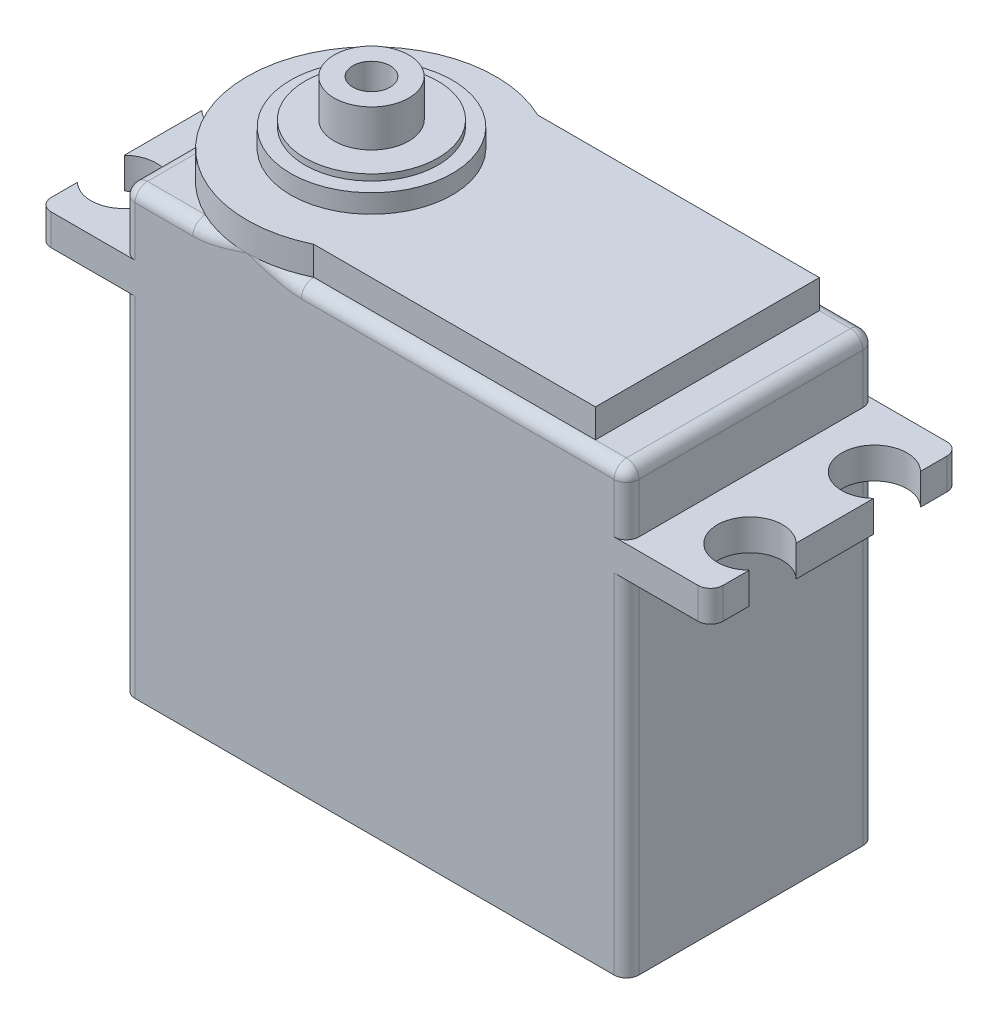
ISO-10303-21;
HEADER;
FILE_DESCRIPTION(('STEP AP214'),'2;1');
FILE_NAME('part.step','',(''),(''),'','','');
FILE_SCHEMA(('AUTOMOTIVE_DESIGN { 1 0 10303 214 1 1 1 1 }'));
ENDSEC;
DATA;
#1=APPLICATION_CONTEXT('core data for automotive mechanical design processes');
#2=APPLICATION_PROTOCOL_DEFINITION('international standard','automotive_design',2000,#1);
#3=PRODUCT_CONTEXT('',#1,'mechanical');
#4=PRODUCT('Part','Part','',(#3));
#5=PRODUCT_RELATED_PRODUCT_CATEGORY('part','',(#4));
#6=PRODUCT_DEFINITION_FORMATION('','',#4);
#7=PRODUCT_DEFINITION_CONTEXT('part definition',#1,'design');
#8=PRODUCT_DEFINITION('design','',#6,#7);
#9=PRODUCT_DEFINITION_SHAPE('','',#8);
#10=(LENGTH_UNIT() NAMED_UNIT(*) SI_UNIT(.MILLI.,.METRE.));
#11=(NAMED_UNIT(*) PLANE_ANGLE_UNIT() SI_UNIT($,.RADIAN.));
#12=(NAMED_UNIT(*) SI_UNIT($,.STERADIAN.) SOLID_ANGLE_UNIT());
#13=UNCERTAINTY_MEASURE_WITH_UNIT(LENGTH_MEASURE(1.E-05),#10,'distance_accuracy_value','');
#14=(GEOMETRIC_REPRESENTATION_CONTEXT(3) GLOBAL_UNCERTAINTY_ASSIGNED_CONTEXT((#13)) GLOBAL_UNIT_ASSIGNED_CONTEXT((#10,
#11,#12)) REPRESENTATION_CONTEXT('',''));
#15=CARTESIAN_POINT('',(0.,0.,0.));
#16=DIRECTION('',(0.,0.,1.));
#17=DIRECTION('',(1.,0.,0.));
#18=AXIS2_PLACEMENT_3D('',#15,#16,#17);
#19=CARTESIAN_POINT('',(-20.25,37.,-10.));
#20=DIRECTION('',(1.,0.,0.));
#21=DIRECTION('',(0.,0.,-1.));
#22=AXIS2_PLACEMENT_3D('',#19,#20,#21);
#23=PLANE('',#22);
#24=DIRECTION('',(0.,0.,-1.));
#25=VECTOR('',#24,1.);
#26=CARTESIAN_POINT('',(-20.25,1.5,5.85));
#27=LINE('',#26,#25);
#28=CARTESIAN_POINT('',(-20.25,1.5,9.00000000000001));
#29=VERTEX_POINT('',#28);
#30=CARTESIAN_POINT('',(-20.25,1.5,5.85));
#31=VERTEX_POINT('',#30);
#32=EDGE_CURVE('E616',#29,#31,#27,.T.);
#33=ORIENTED_EDGE('',*,*,#32,.F.);
#34=DIRECTION('',(0.,-1.,0.));
#35=VECTOR('',#34,1.);
#36=CARTESIAN_POINT('',(-20.25,37.,9.00000000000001));
#37=LINE('',#36,#35);
#38=CARTESIAN_POINT('',(-20.25,29.5,9.00000000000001));
#39=VERTEX_POINT('',#38);
#40=EDGE_CURVE('E1155',#29,#39,#37,.F.);
#41=ORIENTED_EDGE('',*,*,#40,.T.);
#42=DIRECTION('',(0.,0.,-1.));
#43=VECTOR('',#42,1.);
#44=CARTESIAN_POINT('',(-20.25,29.5,0.));
#45=LINE('',#44,#43);
#46=CARTESIAN_POINT('',(-20.25,29.5,-9.));
#47=VERTEX_POINT('',#46);
#48=EDGE_CURVE('E509',#39,#47,#45,.T.);
#49=ORIENTED_EDGE('',*,*,#48,.T.);
#50=DIRECTION('',(0.,-1.,0.));
#51=VECTOR('',#50,1.);
#52=CARTESIAN_POINT('',(-20.25,37.,-9.));
#53=LINE('',#52,#51);
#54=CARTESIAN_POINT('',(-20.25,1.5,-9.));
#55=VERTEX_POINT('',#54);
#56=EDGE_CURVE('E1152',#47,#55,#53,.T.);
#57=ORIENTED_EDGE('',*,*,#56,.T.);
#58=DIRECTION('',(0.,0.,-1.));
#59=VECTOR('',#58,1.);
#60=CARTESIAN_POINT('',(-20.25,1.5,-10.));
#61=LINE('',#60,#59);
#62=CARTESIAN_POINT('',(-20.25,1.5,-5.85));
#63=VERTEX_POINT('',#62);
#64=EDGE_CURVE('E580',#63,#55,#61,.T.);
#65=ORIENTED_EDGE('',*,*,#64,.F.);
#66=DIRECTION('',(0.,0.,1.));
#67=VECTOR('',#66,1.);
#68=CARTESIAN_POINT('',(-20.25,1.50000000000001,-10.));
#69=LINE('',#68,#67);
#70=EDGE_CURVE('E618',#63,#31,#69,.T.);
#71=ORIENTED_EDGE('',*,*,#70,.T.);
#72=EDGE_LOOP('',(#33,#41,#49,#57,#65,#71));
#73=FACE_BOUND('',#72,.T.);
#74=DIRECTION('',(0.,-1.,0.));
#75=VECTOR('',#74,1.);
#76=CARTESIAN_POINT('',(-20.25,8.5,-3.5));
#77=LINE('',#76,#75);
#78=CARTESIAN_POINT('',(-20.25,8.5,-3.5));
#79=VERTEX_POINT('',#78);
#80=CARTESIAN_POINT('',(-20.25,4.5,-3.5));
#81=VERTEX_POINT('',#80);
#82=EDGE_CURVE('E425',#79,#81,#77,.T.);
#83=ORIENTED_EDGE('',*,*,#82,.F.);
#84=DIRECTION('',(0.,0.,-1.));
#85=VECTOR('',#84,1.);
#86=CARTESIAN_POINT('',(-20.25,8.5,-3.5));
#87=LINE('',#86,#85);
#88=CARTESIAN_POINT('',(-20.25,8.5,3.5));
#89=VERTEX_POINT('',#88);
#90=EDGE_CURVE('E422',#89,#79,#87,.T.);
#91=ORIENTED_EDGE('',*,*,#90,.F.);
#92=DIRECTION('',(0.,1.,0.));
#93=VECTOR('',#92,1.);
#94=CARTESIAN_POINT('',(-20.25,8.5,3.5));
#95=LINE('',#94,#93);
#96=CARTESIAN_POINT('',(-20.25,4.5,3.5));
#97=VERTEX_POINT('',#96);
#98=EDGE_CURVE('E69',#97,#89,#95,.T.);
#99=ORIENTED_EDGE('',*,*,#98,.F.);
#100=DIRECTION('',(0.,0.,1.));
#101=VECTOR('',#100,1.);
#102=CARTESIAN_POINT('',(-20.25,4.5,-3.5));
#103=LINE('',#102,#101);
#104=EDGE_CURVE('E64',#81,#97,#103,.T.);
#105=ORIENTED_EDGE('',*,*,#104,.F.);
#106=EDGE_LOOP('',(#83,#91,#99,#105));
#107=FACE_BOUND('',#106,.T.);
#108=ADVANCED_FACE('F49',(#73,#107),#23,.F.);
#109=CARTESIAN_POINT('',(27.,0.,0.));
#110=DIRECTION('',(-1.,0.,0.));
#111=DIRECTION('',(0.,0.,1.));
#112=AXIS2_PLACEMENT_3D('',#109,#110,#111);
#113=PLANE('',#112);
#114=DIRECTION('',(0.,0.,1.));
#115=VECTOR('',#114,1.);
#116=CARTESIAN_POINT('',(27.,32.,10.));
#117=LINE('',#116,#115);
#118=CARTESIAN_POINT('',(27.,32.,6.88679622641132));
#119=VERTEX_POINT('',#118);
#120=CARTESIAN_POINT('',(27.,32.,9.00000000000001));
#121=VERTEX_POINT('',#120);
#122=EDGE_CURVE('E478',#119,#121,#117,.T.);
#123=ORIENTED_EDGE('',*,*,#122,.T.);
#124=DIRECTION('',(0.,-1.,0.));
#125=VECTOR('',#124,1.);
#126=CARTESIAN_POINT('',(27.,0.,9.00000000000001));
#127=LINE('',#126,#125);
#128=CARTESIAN_POINT('',(27.,29.5,9.00000000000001));
#129=VERTEX_POINT('',#128);
#130=EDGE_CURVE('E843',#121,#129,#127,.T.);
#131=ORIENTED_EDGE('',*,*,#130,.T.);
#132=DIRECTION('',(0.,0.,-1.));
#133=VECTOR('',#132,1.);
#134=CARTESIAN_POINT('',(27.,29.5,10.));
#135=LINE('',#134,#133);
#136=CARTESIAN_POINT('',(27.,29.5,6.88679622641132));
#137=VERTEX_POINT('',#136);
#138=EDGE_CURVE('E476',#129,#137,#135,.T.);
#139=ORIENTED_EDGE('',*,*,#138,.T.);
#140=DIRECTION('',(0.,1.,0.));
#141=VECTOR('',#140,1.);
#142=CARTESIAN_POINT('',(27.,-0.001000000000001,6.88679622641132));
#143=LINE('',#142,#141);
#144=EDGE_CURVE('E436',#119,#137,#143,.F.);
#145=ORIENTED_EDGE('',*,*,#144,.F.);
#146=EDGE_LOOP('',(#123,#131,#139,#145));
#147=FACE_BOUND('',#146,.T.);
#148=ADVANCED_FACE('F688',(#147),#113,.F.);
#149=CARTESIAN_POINT('',(27.,32.,-3.11320377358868));
#150=VERTEX_POINT('',#149);
#151=CARTESIAN_POINT('',(27.,32.,3.11320377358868));
#152=VERTEX_POINT('',#151);
#153=EDGE_CURVE('E484',#150,#152,#117,.T.);
#154=ORIENTED_EDGE('',*,*,#153,.T.);
#155=DIRECTION('',(0.,1.,0.));
#156=VECTOR('',#155,1.);
#157=CARTESIAN_POINT('',(27.,-0.001000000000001,3.11320377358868));
#158=LINE('',#157,#156);
#159=CARTESIAN_POINT('',(27.,29.5,3.11320377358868));
#160=VERTEX_POINT('',#159);
#161=EDGE_CURVE('E434',#160,#152,#158,.T.);
#162=ORIENTED_EDGE('',*,*,#161,.F.);
#163=CARTESIAN_POINT('',(27.,29.5,-3.11320377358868));
#164=VERTEX_POINT('',#163);
#165=EDGE_CURVE('E479',#160,#164,#135,.T.);
#166=ORIENTED_EDGE('',*,*,#165,.T.);
#167=DIRECTION('',(0.,1.,0.));
#168=VECTOR('',#167,1.);
#169=CARTESIAN_POINT('',(27.,-0.001000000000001,-3.11320377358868));
#170=LINE('',#169,#168);
#171=EDGE_CURVE('E448',#150,#164,#170,.F.);
#172=ORIENTED_EDGE('',*,*,#171,.F.);
#173=EDGE_LOOP('',(#154,#162,#166,#172));
#174=FACE_BOUND('',#173,.T.);
#175=ADVANCED_FACE('F1420',(#174),#113,.F.);
#176=CARTESIAN_POINT('',(-27.,0.,0.));
#177=DIRECTION('',(-1.,0.,0.));
#178=DIRECTION('',(0.,0.,1.));
#179=AXIS2_PLACEMENT_3D('',#176,#177,#178);
#180=PLANE('',#179);
#181=DIRECTION('',(0.,1.,0.));
#182=VECTOR('',#181,1.);
#183=CARTESIAN_POINT('',(-27.,-0.001000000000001,-3.11320377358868));
#184=LINE('',#183,#182);
#185=CARTESIAN_POINT('',(-27.,32.,-3.11320377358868));
#186=VERTEX_POINT('',#185);
#187=CARTESIAN_POINT('',(-27.,29.5,-3.11320377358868));
#188=VERTEX_POINT('',#187);
#189=EDGE_CURVE('E457',#186,#188,#184,.F.);
#190=ORIENTED_EDGE('',*,*,#189,.T.);
#191=DIRECTION('',(0.,0.,-1.));
#192=VECTOR('',#191,1.);
#193=CARTESIAN_POINT('',(-27.,29.5,0.));
#194=LINE('',#193,#192);
#195=CARTESIAN_POINT('',(-27.,29.5,3.11320377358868));
#196=VERTEX_POINT('',#195);
#197=EDGE_CURVE('E506',#196,#188,#194,.T.);
#198=ORIENTED_EDGE('',*,*,#197,.F.);
#199=DIRECTION('',(0.,1.,0.));
#200=VECTOR('',#199,1.);
#201=CARTESIAN_POINT('',(-27.,-0.001000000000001,3.11320377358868));
#202=LINE('',#201,#200);
#203=CARTESIAN_POINT('',(-27.,32.,3.11320377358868));
#204=VERTEX_POINT('',#203);
#205=EDGE_CURVE('E444',#196,#204,#202,.T.);
#206=ORIENTED_EDGE('',*,*,#205,.T.);
#207=DIRECTION('',(0.,0.,-1.));
#208=VECTOR('',#207,1.);
#209=CARTESIAN_POINT('',(-27.,32.,0.));
#210=LINE('',#209,#208);
#211=EDGE_CURVE('E501',#204,#186,#210,.T.);
#212=ORIENTED_EDGE('',*,*,#211,.T.);
#213=EDGE_LOOP('',(#190,#198,#206,#212));
#214=FACE_BOUND('',#213,.T.);
#215=ADVANCED_FACE('F1314',(#214),#180,.T.);
#216=CARTESIAN_POINT('',(-27.,29.5,9.00000000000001));
#217=VERTEX_POINT('',#216);
#218=CARTESIAN_POINT('',(-27.,29.5,6.88679622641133));
#219=VERTEX_POINT('',#218);
#220=EDGE_CURVE('E503',#217,#219,#194,.T.);
#221=ORIENTED_EDGE('',*,*,#220,.F.);
#222=DIRECTION('',(0.,1.,0.));
#223=VECTOR('',#222,1.);
#224=CARTESIAN_POINT('',(-27.,32.,9.00000000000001));
#225=LINE('',#224,#223);
#226=CARTESIAN_POINT('',(-27.,32.,9.00000000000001));
#227=VERTEX_POINT('',#226);
#228=EDGE_CURVE('E859',#217,#227,#225,.T.);
#229=ORIENTED_EDGE('',*,*,#228,.T.);
#230=CARTESIAN_POINT('',(-27.,32.,6.88679622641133));
#231=VERTEX_POINT('',#230);
#232=EDGE_CURVE('E498',#227,#231,#210,.T.);
#233=ORIENTED_EDGE('',*,*,#232,.T.);
#234=DIRECTION('',(0.,1.,0.));
#235=VECTOR('',#234,1.);
#236=CARTESIAN_POINT('',(-27.,-0.001000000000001,6.88679622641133));
#237=LINE('',#236,#235);
#238=EDGE_CURVE('E469',#231,#219,#237,.F.);
#239=ORIENTED_EDGE('',*,*,#238,.T.);
#240=EDGE_LOOP('',(#221,#229,#233,#239));
#241=FACE_BOUND('',#240,.T.);
#242=ADVANCED_FACE('F1303',(#241),#180,.T.);
#243=CARTESIAN_POINT('',(20.25,37.,-10.));
#244=DIRECTION('',(-1.,0.,0.));
#245=DIRECTION('',(0.,0.,1.));
#246=AXIS2_PLACEMENT_3D('',#243,#244,#245);
#247=PLANE('',#246);
#248=DIRECTION('',(0.,0.,1.));
#249=VECTOR('',#248,1.);
#250=CARTESIAN_POINT('',(20.25,1.5,-5.85));
#251=LINE('',#250,#249);
#252=CARTESIAN_POINT('',(20.25,1.5,-9.));
#253=VERTEX_POINT('',#252);
#254=CARTESIAN_POINT('',(20.25,1.5,-5.85));
#255=VERTEX_POINT('',#254);
#256=EDGE_CURVE('E589',#253,#255,#251,.T.);
#257=ORIENTED_EDGE('',*,*,#256,.F.);
#258=DIRECTION('',(0.,-1.,0.));
#259=VECTOR('',#258,1.);
#260=CARTESIAN_POINT('',(20.25,37.,-9.));
#261=LINE('',#260,#259);
#262=CARTESIAN_POINT('',(20.25,29.5,-9.));
#263=VERTEX_POINT('',#262);
#264=EDGE_CURVE('E1146',#253,#263,#261,.F.);
#265=ORIENTED_EDGE('',*,*,#264,.T.);
#266=DIRECTION('',(0.,0.,-1.));
#267=VECTOR('',#266,1.);
#268=CARTESIAN_POINT('',(20.25,29.5,10.));
#269=LINE('',#268,#267);
#270=CARTESIAN_POINT('',(20.25,29.5,9.00000000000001));
#271=VERTEX_POINT('',#270);
#272=EDGE_CURVE('E466',#271,#263,#269,.T.);
#273=ORIENTED_EDGE('',*,*,#272,.F.);
#274=DIRECTION('',(0.,-1.,0.));
#275=VECTOR('',#274,1.);
#276=CARTESIAN_POINT('',(20.25,37.,9.00000000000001));
#277=LINE('',#276,#275);
#278=CARTESIAN_POINT('',(20.25,1.5,9.00000000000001));
#279=VERTEX_POINT('',#278);
#280=EDGE_CURVE('E1143',#271,#279,#277,.T.);
#281=ORIENTED_EDGE('',*,*,#280,.T.);
#282=DIRECTION('',(0.,0.,1.));
#283=VECTOR('',#282,1.);
#284=CARTESIAN_POINT('',(20.25,1.5,10.));
#285=LINE('',#284,#283);
#286=CARTESIAN_POINT('',(20.25,1.5,5.85));
#287=VERTEX_POINT('',#286);
#288=EDGE_CURVE('E600',#287,#279,#285,.T.);
#289=ORIENTED_EDGE('',*,*,#288,.F.);
#290=DIRECTION('',(0.,0.,-1.));
#291=VECTOR('',#290,1.);
#292=CARTESIAN_POINT('',(20.25,1.49999999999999,-10.));
#293=LINE('',#292,#291);
#294=EDGE_CURVE('E646',#287,#255,#293,.T.);
#295=ORIENTED_EDGE('',*,*,#294,.T.);
#296=EDGE_LOOP('',(#257,#265,#273,#281,#289,#295));
#297=FACE_BOUND('',#296,.T.);
#298=ADVANCED_FACE('F1203',(#297),#247,.F.);
#299=DIRECTION('',(0.,0.,1.));
#300=VECTOR('',#299,1.);
#301=CARTESIAN_POINT('',(20.25,32.,10.));
#302=LINE('',#301,#300);
#303=CARTESIAN_POINT('',(20.25,32.,-9.));
#304=VERTEX_POINT('',#303);
#305=CARTESIAN_POINT('',(20.25,32.,9.00000000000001));
#306=VERTEX_POINT('',#305);
#307=EDGE_CURVE('E487',#304,#306,#302,.T.);
#308=ORIENTED_EDGE('',*,*,#307,.F.);
#309=DIRECTION('',(0.,-1.,0.));
#310=VECTOR('',#309,1.);
#311=CARTESIAN_POINT('',(20.25,37.,-9.));
#312=LINE('',#311,#310);
#313=CARTESIAN_POINT('',(20.25,36.,-9.));
#314=VERTEX_POINT('',#313);
#315=EDGE_CURVE('E1135',#304,#314,#312,.F.);
#316=ORIENTED_EDGE('',*,*,#315,.T.);
#317=DIRECTION('',(0.,0.,-1.));
#318=VECTOR('',#317,1.);
#319=CARTESIAN_POINT('',(20.25,36.,10.));
#320=LINE('',#319,#318);
#321=CARTESIAN_POINT('',(20.25,36.,9.00000000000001));
#322=VERTEX_POINT('',#321);
#323=EDGE_CURVE('E1118',#314,#322,#320,.F.);
#324=ORIENTED_EDGE('',*,*,#323,.T.);
#325=DIRECTION('',(0.,-1.,0.));
#326=VECTOR('',#325,1.);
#327=CARTESIAN_POINT('',(20.25,37.,9.00000000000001));
#328=LINE('',#327,#326);
#329=EDGE_CURVE('E1128',#322,#306,#328,.T.);
#330=ORIENTED_EDGE('',*,*,#329,.T.);
#331=EDGE_LOOP('',(#308,#316,#324,#330));
#332=FACE_BOUND('',#331,.T.);
#333=ADVANCED_FACE('F1601',(#332),#247,.F.);
#334=DIRECTION('',(0.,0.,-1.));
#335=VECTOR('',#334,1.);
#336=CARTESIAN_POINT('',(-20.25,32.,0.));
#337=LINE('',#336,#335);
#338=CARTESIAN_POINT('',(-20.25,32.,9.00000000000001));
#339=VERTEX_POINT('',#338);
#340=CARTESIAN_POINT('',(-20.25,32.,-9.));
#341=VERTEX_POINT('',#340);
#342=EDGE_CURVE('E497',#339,#341,#337,.T.);
#343=ORIENTED_EDGE('',*,*,#342,.F.);
#344=DIRECTION('',(0.,-1.,0.));
#345=VECTOR('',#344,1.);
#346=CARTESIAN_POINT('',(-20.25,37.,9.00000000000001));
#347=LINE('',#346,#345);
#348=CARTESIAN_POINT('',(-20.25,36.,9.00000000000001));
#349=VERTEX_POINT('',#348);
#350=EDGE_CURVE('E983',#339,#349,#347,.F.);
#351=ORIENTED_EDGE('',*,*,#350,.T.);
#352=DIRECTION('',(0.,0.,1.));
#353=VECTOR('',#352,1.);
#354=CARTESIAN_POINT('',(-20.25,36.,0.));
#355=LINE('',#354,#353);
#356=CARTESIAN_POINT('',(-20.25,36.,4.35889894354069));
#357=VERTEX_POINT('',#356);
#358=EDGE_CURVE('E992',#349,#357,#355,.F.);
#359=ORIENTED_EDGE('',*,*,#358,.T.);
#360=CARTESIAN_POINT('',(-18.8600153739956,37.,5.08602352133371));
#361=CARTESIAN_POINT('',(-20.25,37.5699638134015,4.93874866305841));
#362=CARTESIAN_POINT('',(-20.25,36.1084605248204,5.3163913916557));
#363=CARTESIAN_POINT('',(-18.9001768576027,37.,5.01805078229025));
#364=CARTESIAN_POINT('',(-20.25,37.491741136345,4.91400853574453));
#365=CARTESIAN_POINT('',(-20.25,36.0837988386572,5.22052277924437));
#366=CARTESIAN_POINT('',(-18.9405559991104,37.,4.94783918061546));
#367=CARTESIAN_POINT('',(-20.25,37.4182078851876,4.87320074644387));
#368=CARTESIAN_POINT('',(-20.25,36.064139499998,5.12355920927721));
#369=CARTESIAN_POINT('',(-19.0211008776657,37.,4.80359862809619));
#370=CARTESIAN_POINT('',(-20.25,37.2861692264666,4.7703435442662));
#371=CARTESIAN_POINT('',(-20.25,36.0332822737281,4.92851555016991));
#372=CARTESIAN_POINT('',(-19.061266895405,37.,4.72957951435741));
#373=CARTESIAN_POINT('',(-20.25,37.2265666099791,4.70923506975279));
#374=CARTESIAN_POINT('',(-20.25,36.0220636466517,4.83043880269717));
#375=CARTESIAN_POINT('',(-19.1797777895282,37.,4.50417709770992));
#376=CARTESIAN_POINT('',(-20.25,37.0726924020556,4.512695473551));
#377=CARTESIAN_POINT('',(-20.25,35.9988220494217,4.53788888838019));
#378=CARTESIAN_POINT('',(-19.2571674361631,37.,4.34772278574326));
#379=CARTESIAN_POINT('',(-20.25,36.9899448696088,4.35575772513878));
#380=CARTESIAN_POINT('',(-20.25,35.9966778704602,4.34265585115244));
#381=CARTESIAN_POINT('',(-19.389219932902,37.,4.06121900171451));
#382=CARTESIAN_POINT('',(-20.25,36.8774741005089,4.05789689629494));
#383=CARTESIAN_POINT('',(-20.25,36.0097476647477,3.99840934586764));
#384=CARTESIAN_POINT('',(-19.4449905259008,37.,3.93346268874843));
#385=CARTESIAN_POINT('',(-20.25,36.8388581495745,3.92323744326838));
#386=CARTESIAN_POINT('',(-20.25,36.0210506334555,3.84917932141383));
#387=CARTESIAN_POINT('',(-19.552526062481,37.,3.67192225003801));
#388=CARTESIAN_POINT('',(-20.25,36.7787089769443,3.64733823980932));
#389=CARTESIAN_POINT('',(-20.25,36.0526489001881,3.55164814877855));
#390=CARTESIAN_POINT('',(-19.604290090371,37.,3.53813675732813));
#391=CARTESIAN_POINT('',(-20.25,36.7562996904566,3.50557338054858));
#392=CARTESIAN_POINT('',(-20.25,36.0729462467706,3.40334722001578));
#393=CARTESIAN_POINT('',(-19.752541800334,37.,3.12826449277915));
#394=CARTESIAN_POINT('',(-20.25,36.709790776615,3.08230142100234));
#395=CARTESIAN_POINT('',(-20.25,36.1446309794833,2.95975606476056));
#396=CARTESIAN_POINT('',(-19.841809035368,37.,2.84404576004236));
#397=CARTESIAN_POINT('',(-20.25,36.7018895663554,2.78473496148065));
#398=CARTESIAN_POINT('',(-20.25,36.2067818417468,2.66623577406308));
#399=CARTESIAN_POINT('',(-19.9969891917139,37.,2.25604201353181));
#400=CARTESIAN_POINT('',(-20.25,36.7189964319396,2.18765181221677));
#401=CARTESIAN_POINT('',(-20.25,36.3499717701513,2.08077975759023));
#402=CARTESIAN_POINT('',(-20.0626418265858,37.,1.952080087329));
#403=CARTESIAN_POINT('',(-20.25,36.7430153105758,1.88281816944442));
#404=CARTESIAN_POINT('',(-20.25,36.4312059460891,1.78889464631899));
#405=CARTESIAN_POINT('',(-20.1656761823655,37.,1.33326140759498));
#406=CARTESIAN_POINT('',(-20.25,36.8090077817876,1.27746721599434));
#407=CARTESIAN_POINT('',(-20.25,36.6043879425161,1.20863139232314));
#408=CARTESIAN_POINT('',(-20.20307963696,37.,1.01841322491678));
#409=CARTESIAN_POINT('',(-20.25,36.8510029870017,0.97206460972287));
#410=CARTESIAN_POINT('',(-20.25,36.6963274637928,0.920250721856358));
#411=CARTESIAN_POINT('',(-20.2333479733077,37.,0.587967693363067));
#412=CARTESIAN_POINT('',(-20.25,36.9126406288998,0.559404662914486));
#413=CARTESIAN_POINT('',(-20.25,36.8240129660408,0.529970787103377));
#414=CARTESIAN_POINT('',(-20.2393860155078,37.,0.474467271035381));
#415=CARTESIAN_POINT('',(-20.25,36.9292591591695,0.451174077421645));
#416=CARTESIAN_POINT('',(-20.25,36.8578665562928,0.427431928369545));
#417=CARTESIAN_POINT('',(-20.2475855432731,37.,0.247313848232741));
#418=CARTESIAN_POINT('',(-20.25,36.962898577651,0.235069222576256));
#419=CARTESIAN_POINT('',(-20.25,36.925811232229,0.222594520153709));
#420=CARTESIAN_POINT('',(-20.2497525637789,37.,0.133661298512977));
#421=CARTESIAN_POINT('',(-20.25,36.9799505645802,0.126984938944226));
#422=CARTESIAN_POINT('',(-20.25,36.9599019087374,0.120295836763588));
#423=CARTESIAN_POINT('',(-20.2499933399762,37.,0.0133333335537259));
#424=CARTESIAN_POINT('',(-20.25,36.9979999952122,0.0126666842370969));
#425=CARTESIAN_POINT('',(-20.25,36.9960000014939,0.0119999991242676));
#426=CARTESIAN_POINT('',(-20.2500000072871,37.,0.00666666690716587));
#427=CARTESIAN_POINT('',(-20.25,36.9989999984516,0.00633332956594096));
#428=CARTESIAN_POINT('',(-20.25,36.9980000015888,0.00599999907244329));
#429=CARTESIAN_POINT('',(-20.25,37.,1.17529352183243E-13));
#430=CARTESIAN_POINT('',(-20.25,37.,1.17529352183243E-13));
#431=CARTESIAN_POINT('',(-20.25,37.,0.));
#432=(BOUNDED_SURFACE() B_SPLINE_SURFACE(3,2,((#360,#361,#362),(#363,#364,#365),(#366,#367,
#368),(#369,#370,#371),(#372,#373,#374),(#375,#376,#377),(#378,#379,#380),(#381,#382,#383),
(#384,#385,#386),(#387,#388,#389),(#390,#391,#392),(#393,#394,#395),(#396,#397,#398),(#399,#400,
#401),(#402,#403,#404),(#405,#406,#407),(#408,#409,#410),(#411,#412,#413),(#414,#415,#416),
(#417,#418,#419),(#420,#421,#422),(#423,#424,#425),(#426,#427,#428),(#429,#430,#431)),
.UNSPECIFIED.,.F.,.F.,.F.) B_SPLINE_SURFACE_WITH_KNOTS((4,2,2,2,2,2,2,2,2,2,2,4),(3,3),(0.,
0.296559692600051,0.592388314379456,1.17662623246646,1.62534517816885,2.07416637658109,
2.9731794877,3.88181826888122,4.78975726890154,5.11370811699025,5.4371953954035,
5.45616906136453),(0.,1.),
.UNSPECIFIED.) GEOMETRIC_REPRESENTATION_ITEM() RATIONAL_B_SPLINE_SURFACE(((1.,0.552275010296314,
1.),(1.,0.570443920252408,1.),(1.,0.587838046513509,1.),(1.,0.621151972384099,1.),(1.,
0.637075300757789,1.),(1.,0.682496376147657,1.),(1.,0.710093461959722,1.),(1.,0.754974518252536,
1.),(1.,0.773165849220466,1.),(1.,0.807187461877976,1.),(1.,0.823017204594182,1.),(1.,
0.86726680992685,1.),(1.,0.892388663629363,1.),(1.,0.934849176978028,1.),(1.,0.952101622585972,
1.),(1.,0.978783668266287,1.),(1.,0.988219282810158,1.),(1.,0.995829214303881,1.),(1.,
0.997343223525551,1.),(1.,0.999397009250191,1.),(1.,0.999938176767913,1.),(1.,0.999998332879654,
1.),(1.,0.999999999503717,1.),(1.,1.,1.))) REPRESENTATION_ITEM('') SURFACE());
#433=CARTESIAN_POINT('',(-20.25,36.1084605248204,5.3163913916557));
#434=CARTESIAN_POINT('',(-20.25,36.0837988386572,5.22052277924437));
#435=CARTESIAN_POINT('',(-20.25,36.064139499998,5.12355920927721));
#436=CARTESIAN_POINT('',(-20.25,36.0332822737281,4.92851555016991));
#437=CARTESIAN_POINT('',(-20.25,36.0220636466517,4.83043880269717));
#438=CARTESIAN_POINT('',(-20.25,35.9988220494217,4.53788888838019));
#439=CARTESIAN_POINT('',(-20.25,35.9966778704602,4.34265585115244));
#440=CARTESIAN_POINT('',(-20.25,36.0097476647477,3.99840934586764));
#441=CARTESIAN_POINT('',(-20.25,36.0210506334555,3.84917932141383));
#442=CARTESIAN_POINT('',(-20.25,36.0526489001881,3.55164814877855));
#443=CARTESIAN_POINT('',(-20.25,36.0729462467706,3.40334722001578));
#444=CARTESIAN_POINT('',(-20.25,36.1446309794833,2.95975606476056));
#445=CARTESIAN_POINT('',(-20.25,36.2067818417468,2.66623577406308));
#446=CARTESIAN_POINT('',(-20.25,36.3499717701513,2.08077975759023));
#447=CARTESIAN_POINT('',(-20.25,36.4312059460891,1.78889464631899));
#448=CARTESIAN_POINT('',(-20.25,36.6043879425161,1.20863139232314));
#449=CARTESIAN_POINT('',(-20.25,36.6963274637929,0.920250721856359));
#450=CARTESIAN_POINT('',(-20.25,36.8240129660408,0.529970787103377));
#451=CARTESIAN_POINT('',(-20.25,36.8578665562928,0.427431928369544));
#452=CARTESIAN_POINT('',(-20.25,36.925811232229,0.22259452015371));
#453=CARTESIAN_POINT('',(-20.25,36.9599019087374,0.120295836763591));
#454=CARTESIAN_POINT('',(-20.25,36.9960000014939,0.0119999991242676));
#455=CARTESIAN_POINT('',(-20.25,36.9980000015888,0.00599999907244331));
#456=CARTESIAN_POINT('',(-20.25,37.,0.));
#457=B_SPLINE_CURVE_WITH_KNOTS('',3,(#433,#434,#435,#436,#437,#438,#439,#440,#441,#442,#443,
#444,#445,#446,#447,#448,#449,#450,#451,#452,#453,#454,#455,#456),.UNSPECIFIED.,.F.,.F.,(4,2,2,
2,2,2,2,2,2,2,2,4),(0.,0.296559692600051,0.592388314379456,1.17662623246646,1.62534517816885,
2.07416637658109,2.9731794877,3.88181826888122,4.78975726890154,5.11370811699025,
5.4371953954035,5.45616906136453),.UNSPECIFIED.);
#458=CARTESIAN_POINT('',(-20.25,37.,0.));
#459=VERTEX_POINT('',#458);
#460=EDGE_CURVE('E674',#357,#459,#457,.T.);
#461=ORIENTED_EDGE('',*,*,#460,.T.);
#462=CARTESIAN_POINT('',(-20.25,36.1084605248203,-5.31639139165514));
#463=CARTESIAN_POINT('',(-20.25,37.5699637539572,-4.93874860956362));
#464=CARTESIAN_POINT('',(-18.860015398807,37.,-5.08602347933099));
#465=CARTESIAN_POINT('',(-20.25,36.0837988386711,-5.22052277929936));
#466=CARTESIAN_POINT('',(-20.25,37.4917411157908,-4.91400851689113));
#467=CARTESIAN_POINT('',(-18.9001768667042,37.,-5.01805076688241));
#468=CARTESIAN_POINT('',(-20.25,36.0641395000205,-5.12355920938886));
#469=CARTESIAN_POINT('',(-20.25,37.4182078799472,-4.87320074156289));
#470=CARTESIAN_POINT('',(-18.9405560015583,37.,-4.94783917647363));
#471=CARTESIAN_POINT('',(-20.25,36.0332822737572,-4.92851555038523));
#472=CARTESIAN_POINT('',(-20.25,37.2861692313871,-4.77034354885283));
#473=CARTESIAN_POINT('',(-19.0211008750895,37.,-4.8035986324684));
#474=CARTESIAN_POINT('',(-20.25,36.0220636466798,-4.83043880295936));
#475=CARTESIAN_POINT('',(-20.25,37.2265666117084,-4.70923507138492));
#476=CARTESIAN_POINT('',(-19.0612668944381,37.,-4.72957951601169));
#477=CARTESIAN_POINT('',(-20.25,35.9988220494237,-4.5378888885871));
#478=CARTESIAN_POINT('',(-20.25,37.072692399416,-4.51269547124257));
#479=CARTESIAN_POINT('',(-19.1797777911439,37.,-4.5041770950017));
#480=CARTESIAN_POINT('',(-20.25,35.9966778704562,-4.34265585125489));
#481=CARTESIAN_POINT('',(-20.25,36.9899448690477,-4.35575772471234));
#482=CARTESIAN_POINT('',(-19.2571674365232,37.,-4.34772278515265));
#483=CARTESIAN_POINT('',(-20.25,36.0097476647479,-3.99840934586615));
#484=CARTESIAN_POINT('',(-20.25,36.8774741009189,-4.0578968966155));
#485=CARTESIAN_POINT('',(-19.3892199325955,37.,-4.06121900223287));
#486=CARTESIAN_POINT('',(-20.25,36.0210506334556,-3.84917932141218));
#487=CARTESIAN_POINT('',(-20.25,36.8388581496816,-3.92323744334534));
#488=CARTESIAN_POINT('',(-19.4449905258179,37.,-3.93346268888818));
#489=CARTESIAN_POINT('',(-20.25,36.0526489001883,-3.55164814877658));
#490=CARTESIAN_POINT('',(-20.25,36.7787089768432,-3.64733823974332));
#491=CARTESIAN_POINT('',(-19.5525260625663,37.,-3.67192224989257));
#492=CARTESIAN_POINT('',(-20.25,36.0729462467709,-3.40334722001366));
#493=CARTESIAN_POINT('',(-20.25,36.7562996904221,-3.50557338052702));
#494=CARTESIAN_POINT('',(-19.6042900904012,37.,-3.53813675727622));
#495=CARTESIAN_POINT('',(-20.25,36.1446309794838,-2.95975606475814));
#496=CARTESIAN_POINT('',(-20.25,36.7097907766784,-3.08230142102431));
#497=CARTESIAN_POINT('',(-19.7525418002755,37.,-3.12826449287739));
#498=CARTESIAN_POINT('',(-20.25,36.2067818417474,-2.66623577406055));
#499=CARTESIAN_POINT('',(-20.25,36.7018895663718,-2.78473496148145));
#500=CARTESIAN_POINT('',(-19.8418090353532,37.,-2.84404576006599));
#501=CARTESIAN_POINT('',(-20.25,36.349971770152,-2.08077975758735));
#502=CARTESIAN_POINT('',(-20.25,36.7189964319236,-2.18765181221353));
#503=CARTESIAN_POINT('',(-19.996989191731,37.,-2.25604201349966));
#504=CARTESIAN_POINT('',(-20.25,36.43120594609,-1.78889464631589));
#505=CARTESIAN_POINT('',(-20.25,36.7430153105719,-1.88281816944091));
#506=CARTESIAN_POINT('',(-20.0626418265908,37.,-1.95208008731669));
#507=CARTESIAN_POINT('',(-20.25,36.6043879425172,-1.20863139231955));
#508=CARTESIAN_POINT('',(-20.25,36.8090077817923,-1.27746721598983));
#509=CARTESIAN_POINT('',(-20.1656761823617,37.,-1.33326140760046));
#510=CARTESIAN_POINT('',(-20.25,36.6963274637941,-0.920250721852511));
#511=CARTESIAN_POINT('',(-20.25,36.8510029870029,-0.972064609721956));
#512=CARTESIAN_POINT('',(-20.2030796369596,37.,-1.01841322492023));
#513=CARTESIAN_POINT('',(-20.25,36.8240129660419,-0.52997078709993));
#514=CARTESIAN_POINT('',(-20.25,36.9126406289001,-0.55940466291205));
#515=CARTESIAN_POINT('',(-20.2333479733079,37.,-0.587967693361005));
#516=CARTESIAN_POINT('',(-20.25,36.8578665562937,-0.42743192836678));
#517=CARTESIAN_POINT('',(-20.25,36.9292591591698,-0.451174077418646));
#518=CARTESIAN_POINT('',(-20.2393860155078,37.,-0.474467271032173));
#519=CARTESIAN_POINT('',(-20.25,36.9258112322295,-0.222594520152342));
#520=CARTESIAN_POINT('',(-20.25,36.9628985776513,-0.235069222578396));
#521=CARTESIAN_POINT('',(-20.247585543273,37.,-0.247313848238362));
#522=CARTESIAN_POINT('',(-20.25,36.9599019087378,-0.120295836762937));
#523=CARTESIAN_POINT('',(-20.25,36.9799505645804,-0.126984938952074));
#524=CARTESIAN_POINT('',(-20.2497525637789,37.,-0.133661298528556));
#525=CARTESIAN_POINT('',(-20.25,36.9960000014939,-0.0119999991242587));
#526=CARTESIAN_POINT('',(-20.25,36.9979999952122,-0.0126666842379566));
#527=CARTESIAN_POINT('',(-20.2499933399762,37.,-0.0133333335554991));
#528=CARTESIAN_POINT('',(-20.25,36.9980000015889,-0.0059999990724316));
#529=CARTESIAN_POINT('',(-20.25,36.9989999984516,-0.00633332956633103));
#530=CARTESIAN_POINT('',(-20.2500000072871,37.,-0.0066666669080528));
#531=CARTESIAN_POINT('',(-20.25,37.,0.));
#532=CARTESIAN_POINT('',(-20.25,37.,0.));
#533=CARTESIAN_POINT('',(-20.25,37.,0.));
#534=(BOUNDED_SURFACE() B_SPLINE_SURFACE(3,2,((#462,#463,#464),(#465,#466,#467),(#468,#469,
#470),(#471,#472,#473),(#474,#475,#476),(#477,#478,#479),(#480,#481,#482),(#483,#484,#485),
(#486,#487,#488),(#489,#490,#491),(#492,#493,#494),(#495,#496,#497),(#498,#499,#500),(#501,#502,
#503),(#504,#505,#506),(#507,#508,#509),(#510,#511,#512),(#513,#514,#515),(#516,#517,#518),
(#519,#520,#521),(#522,#523,#524),(#525,#526,#527),(#528,#529,#530),(#531,#532,#533)),
.UNSPECIFIED.,.F.,.F.,.F.) B_SPLINE_SURFACE_WITH_KNOTS((4,2,2,2,2,2,2,2,2,2,2,4),(3,3),(0.,
0.296559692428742,0.592388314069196,1.1766262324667,1.6253451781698,2.07416637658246,
2.97317948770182,3.88181826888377,4.78975726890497,5.11370811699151,5.4371953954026,
5.45616906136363),(0.,1.),
.UNSPECIFIED.) GEOMETRIC_REPRESENTATION_ITEM() RATIONAL_B_SPLINE_SURFACE(((1.,0.552275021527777,
1.),(1.,0.570443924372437,1.),(1.,0.587838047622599,1.),(1.,0.621151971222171,1.),(1.,
0.637075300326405,1.),(1.,0.682496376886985,1.),(1.,0.710093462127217,1.),(1.,0.754974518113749,
1.),(1.,0.773165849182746,1.),(1.,0.80718746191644,1.),(1.,0.823017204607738,1.),(1.,
0.867266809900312,1.),(1.,0.892388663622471,1.),(1.,0.934849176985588,1.),(1.,0.952101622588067,
1.),(1.,0.978783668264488,1.),(1.,0.988219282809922,1.),(1.,0.995829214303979,1.),(1.,
0.997343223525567,1.),(1.,0.999397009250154,1.),(1.,0.999938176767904,1.),(1.,0.999998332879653,
1.),(1.,0.999999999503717,1.),(1.,1.,1.))) REPRESENTATION_ITEM('') SURFACE());
#535=CARTESIAN_POINT('',(-20.25,36.1084605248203,-5.31639139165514));
#536=CARTESIAN_POINT('',(-20.25,36.0837988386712,-5.22052277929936));
#537=CARTESIAN_POINT('',(-20.25,36.0641395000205,-5.12355920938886));
#538=CARTESIAN_POINT('',(-20.25,36.0332822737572,-4.92851555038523));
#539=CARTESIAN_POINT('',(-20.25,36.0220636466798,-4.83043880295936));
#540=CARTESIAN_POINT('',(-20.25,35.9988220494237,-4.5378888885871));
#541=CARTESIAN_POINT('',(-20.25,35.9966778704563,-4.34265585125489));
#542=CARTESIAN_POINT('',(-20.25,36.0097476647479,-3.99840934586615));
#543=CARTESIAN_POINT('',(-20.25,36.0210506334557,-3.84917932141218));
#544=CARTESIAN_POINT('',(-20.25,36.0526489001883,-3.55164814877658));
#545=CARTESIAN_POINT('',(-20.25,36.0729462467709,-3.40334722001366));
#546=CARTESIAN_POINT('',(-20.25,36.1446309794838,-2.95975606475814));
#547=CARTESIAN_POINT('',(-20.25,36.2067818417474,-2.66623577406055));
#548=CARTESIAN_POINT('',(-20.25,36.349971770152,-2.08077975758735));
#549=CARTESIAN_POINT('',(-20.25,36.43120594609,-1.78889464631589));
#550=CARTESIAN_POINT('',(-20.25,36.6043879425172,-1.20863139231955));
#551=CARTESIAN_POINT('',(-20.25,36.6963274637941,-0.92025072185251));
#552=CARTESIAN_POINT('',(-20.25,36.8240129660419,-0.529970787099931));
#553=CARTESIAN_POINT('',(-20.25,36.8578665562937,-0.42743192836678));
#554=CARTESIAN_POINT('',(-20.25,36.9258112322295,-0.222594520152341));
#555=CARTESIAN_POINT('',(-20.25,36.9599019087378,-0.120295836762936));
#556=CARTESIAN_POINT('',(-20.25,36.9960000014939,-0.0119999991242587));
#557=CARTESIAN_POINT('',(-20.25,36.9980000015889,-0.0059999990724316));
#558=CARTESIAN_POINT('',(-20.25,37.,0.));
#559=B_SPLINE_CURVE_WITH_KNOTS('',3,(#535,#536,#537,#538,#539,#540,#541,#542,#543,#544,#545,
#546,#547,#548,#549,#550,#551,#552,#553,#554,#555,#556,#557,#558),.UNSPECIFIED.,.F.,.F.,(4,2,2,
2,2,2,2,2,2,2,2,4),(0.,0.296559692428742,0.592388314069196,1.1766262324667,1.6253451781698,
2.07416637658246,2.97317948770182,3.88181826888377,4.78975726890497,5.11370811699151,
5.4371953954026,5.45616906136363),.UNSPECIFIED.);
#560=CARTESIAN_POINT('',(-20.25,36.,-4.35889894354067));
#561=VERTEX_POINT('',#560);
#562=EDGE_CURVE('E666',#459,#561,#559,.F.);
#563=ORIENTED_EDGE('',*,*,#562,.T.);
#564=DIRECTION('',(0.,0.,1.));
#565=VECTOR('',#564,1.);
#566=CARTESIAN_POINT('',(-20.25,36.,-10.));
#567=LINE('',#566,#565);
#568=CARTESIAN_POINT('',(-20.25,36.,-9.));
#569=VERTEX_POINT('',#568);
#570=EDGE_CURVE('E664',#561,#569,#567,.F.);
#571=ORIENTED_EDGE('',*,*,#570,.T.);
#572=DIRECTION('',(0.,-1.,0.));
#573=VECTOR('',#572,1.);
#574=CARTESIAN_POINT('',(-20.25,37.,-9.));
#575=LINE('',#574,#573);
#576=EDGE_CURVE('E662',#569,#341,#575,.T.);
#577=ORIENTED_EDGE('',*,*,#576,.T.);
#578=EDGE_LOOP('',(#343,#351,#359,#461,#563,#571,#577));
#579=FACE_BOUND('',#578,.T.);
#580=ADVANCED_FACE('F690',(#579),#23,.F.);
#581=CARTESIAN_POINT('',(0.,37.,0.));
#582=DIRECTION('',(0.,1.,0.));
#583=DIRECTION('',(0.,0.,1.));
#584=AXIS2_PLACEMENT_3D('',#581,#582,#583);
#585=PLANE('',#584);
#586=CARTESIAN_POINT('',(-10.25,37.,0.));
#587=DIRECTION('',(0.,1.,0.));
#588=DIRECTION('',(0.,0.,1.));
#589=AXIS2_PLACEMENT_3D('',#586,#587,#588);
#590=CIRCLE('',#589,10.);
#591=CARTESIAN_POINT('',(-19.25,37.,4.35889894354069));
#592=VERTEX_POINT('',#591);
#593=CARTESIAN_POINT('',(-14.6088989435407,37.,9.00000000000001));
#594=VERTEX_POINT('',#593);
#595=EDGE_CURVE('E1058',#592,#594,#590,.T.);
#596=ORIENTED_EDGE('',*,*,#595,.F.);
#597=DIRECTION('',(0.,0.,1.));
#598=VECTOR('',#597,1.);
#599=CARTESIAN_POINT('',(-19.25,37.,10.));
#600=LINE('',#599,#598);
#601=CARTESIAN_POINT('',(-19.25,37.,9.00000000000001));
#602=VERTEX_POINT('',#601);
#603=EDGE_CURVE('E660',#592,#602,#600,.T.);
#604=ORIENTED_EDGE('',*,*,#603,.T.);
#605=DIRECTION('',(1.,0.,0.));
#606=VECTOR('',#605,1.);
#607=CARTESIAN_POINT('',(-10.25,37.,9.00000000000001));
#608=LINE('',#607,#606);
#609=EDGE_CURVE('E658',#602,#594,#608,.T.);
#610=ORIENTED_EDGE('',*,*,#609,.T.);
#611=EDGE_LOOP('',(#596,#604,#610));
#612=FACE_BOUND('',#611,.T.);
#613=ADVANCED_FACE('F1057',(#612),#585,.T.);
#614=DIRECTION('',(0.,0.,-1.));
#615=VECTOR('',#614,1.);
#616=CARTESIAN_POINT('',(16.75,37.,9.));
#617=LINE('',#616,#615);
#618=CARTESIAN_POINT('',(16.75,37.,9.));
#619=VERTEX_POINT('',#618);
#620=CARTESIAN_POINT('',(16.75,37.,-9.));
#621=VERTEX_POINT('',#620);
#622=EDGE_CURVE('E540',#619,#621,#617,.T.);
#623=ORIENTED_EDGE('',*,*,#622,.F.);
#624=DIRECTION('',(1.,0.,0.));
#625=VECTOR('',#624,1.);
#626=CARTESIAN_POINT('',(20.25,37.,9.00000000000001));
#627=LINE('',#626,#625);
#628=CARTESIAN_POINT('',(19.25,37.,9.00000000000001));
#629=VERTEX_POINT('',#628);
#630=EDGE_CURVE('E1133',#619,#629,#627,.T.);
#631=ORIENTED_EDGE('',*,*,#630,.T.);
#632=DIRECTION('',(0.,0.,-1.));
#633=VECTOR('',#632,1.);
#634=CARTESIAN_POINT('',(19.25,37.,-10.));
#635=LINE('',#634,#633);
#636=CARTESIAN_POINT('',(19.25,37.,-9.));
#637=VERTEX_POINT('',#636);
#638=EDGE_CURVE('E1121',#629,#637,#635,.T.);
#639=ORIENTED_EDGE('',*,*,#638,.T.);
#640=DIRECTION('',(-1.,0.,0.));
#641=VECTOR('',#640,1.);
#642=CARTESIAN_POINT('',(-10.25,37.,-9.));
#643=LINE('',#642,#641);
#644=EDGE_CURVE('E1235',#637,#621,#643,.T.);
#645=ORIENTED_EDGE('',*,*,#644,.T.);
#646=EDGE_LOOP('',(#623,#631,#639,#645));
#647=FACE_BOUND('',#646,.T.);
#648=ADVANCED_FACE('F1244',(#647),#585,.T.);
#649=CARTESIAN_POINT('',(-20.25,37.,10.));
#650=DIRECTION('',(0.,0.,-1.));
#651=DIRECTION('',(-1.,0.,0.));
#652=AXIS2_PLACEMENT_3D('',#649,#650,#651);
#653=PLANE('',#652);
#654=DIRECTION('',(1.,0.,0.));
#655=VECTOR('',#654,1.);
#656=CARTESIAN_POINT('',(-27.,32.,10.));
#657=LINE('',#656,#655);
#658=CARTESIAN_POINT('',(-26.,32.,10.));
#659=VERTEX_POINT('',#658);
#660=CARTESIAN_POINT('',(-19.25,32.,10.));
#661=VERTEX_POINT('',#660);
#662=EDGE_CURVE('E517',#659,#661,#657,.T.);
#663=ORIENTED_EDGE('',*,*,#662,.F.);
#664=DIRECTION('',(0.,1.,0.));
#665=VECTOR('',#664,1.);
#666=CARTESIAN_POINT('',(-26.,29.5,10.));
#667=LINE('',#666,#665);
#668=CARTESIAN_POINT('',(-26.,29.5,10.));
#669=VERTEX_POINT('',#668);
#670=EDGE_CURVE('E856',#659,#669,#667,.F.);
#671=ORIENTED_EDGE('',*,*,#670,.T.);
#672=DIRECTION('',(1.,0.,0.));
#673=VECTOR('',#672,1.);
#674=CARTESIAN_POINT('',(-27.,29.5,10.));
#675=LINE('',#674,#673);
#676=CARTESIAN_POINT('',(-19.25,29.5,10.));
#677=VERTEX_POINT('',#676);
#678=EDGE_CURVE('E505',#669,#677,#675,.T.);
#679=ORIENTED_EDGE('',*,*,#678,.T.);
#680=DIRECTION('',(0.,-1.,0.));
#681=VECTOR('',#680,1.);
#682=CARTESIAN_POINT('',(-19.25,37.,10.));
#683=LINE('',#682,#681);
#684=CARTESIAN_POINT('',(-19.25,1.5,10.));
#685=VERTEX_POINT('',#684);
#686=EDGE_CURVE('E991',#677,#685,#683,.T.);
#687=ORIENTED_EDGE('',*,*,#686,.T.);
#688=DIRECTION('',(-1.,0.,0.));
#689=VECTOR('',#688,1.);
#690=CARTESIAN_POINT('',(-20.25,1.5,10.));
#691=LINE('',#690,#689);
#692=CARTESIAN_POINT('',(-16.1,1.5,10.));
#693=VERTEX_POINT('',#692);
#694=EDGE_CURVE('E613',#693,#685,#691,.T.);
#695=ORIENTED_EDGE('',*,*,#694,.F.);
#696=DIRECTION('',(1.,0.,0.));
#697=VECTOR('',#696,1.);
#698=CARTESIAN_POINT('',(-20.25,1.49999999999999,10.));
#699=LINE('',#698,#697);
#700=CARTESIAN_POINT('',(16.1,1.5,10.));
#701=VERTEX_POINT('',#700);
#702=EDGE_CURVE('E639',#693,#701,#699,.T.);
#703=ORIENTED_EDGE('',*,*,#702,.T.);
#704=DIRECTION('',(-1.,0.,0.));
#705=VECTOR('',#704,1.);
#706=CARTESIAN_POINT('',(16.1,1.5,10.));
#707=LINE('',#706,#705);
#708=CARTESIAN_POINT('',(19.25,1.5,10.));
#709=VERTEX_POINT('',#708);
#710=EDGE_CURVE('E601',#709,#701,#707,.T.);
#711=ORIENTED_EDGE('',*,*,#710,.F.);
#712=DIRECTION('',(0.,-1.,0.));
#713=VECTOR('',#712,1.);
#714=CARTESIAN_POINT('',(19.25,37.,10.));
#715=LINE('',#714,#713);
#716=CARTESIAN_POINT('',(19.25,29.5,10.));
#717=VERTEX_POINT('',#716);
#718=EDGE_CURVE('E1249',#709,#717,#715,.F.);
#719=ORIENTED_EDGE('',*,*,#718,.T.);
#720=DIRECTION('',(-1.,0.,0.));
#721=VECTOR('',#720,1.);
#722=CARTESIAN_POINT('',(27.,29.5,10.));
#723=LINE('',#722,#721);
#724=CARTESIAN_POINT('',(26.,29.5,10.));
#725=VERTEX_POINT('',#724);
#726=EDGE_CURVE('E495',#725,#717,#723,.T.);
#727=ORIENTED_EDGE('',*,*,#726,.F.);
#728=DIRECTION('',(0.,-1.,0.));
#729=VECTOR('',#728,1.);
#730=CARTESIAN_POINT('',(26.,37.,10.));
#731=LINE('',#730,#729);
#732=CARTESIAN_POINT('',(26.,32.,10.));
#733=VERTEX_POINT('',#732);
#734=EDGE_CURVE('E841',#725,#733,#731,.F.);
#735=ORIENTED_EDGE('',*,*,#734,.T.);
#736=DIRECTION('',(-1.,0.,0.));
#737=VECTOR('',#736,1.);
#738=CARTESIAN_POINT('',(27.,32.,10.));
#739=LINE('',#738,#737);
#740=CARTESIAN_POINT('',(19.25,32.,10.));
#741=VERTEX_POINT('',#740);
#742=EDGE_CURVE('E483',#733,#741,#739,.T.);
#743=ORIENTED_EDGE('',*,*,#742,.T.);
#744=DIRECTION('',(0.,-1.,0.));
#745=VECTOR('',#744,1.);
#746=CARTESIAN_POINT('',(19.25,37.,10.));
#747=LINE('',#746,#745);
#748=CARTESIAN_POINT('',(19.25,36.,10.));
#749=VERTEX_POINT('',#748);
#750=EDGE_CURVE('E1127',#741,#749,#747,.F.);
#751=ORIENTED_EDGE('',*,*,#750,.T.);
#752=DIRECTION('',(1.,0.,0.));
#753=VECTOR('',#752,1.);
#754=CARTESIAN_POINT('',(-10.25,36.,10.));
#755=LINE('',#754,#753);
#756=CARTESIAN_POINT('',(-5.89110105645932,36.,10.));
#757=VERTEX_POINT('',#756);
#758=EDGE_CURVE('E1247',#749,#757,#755,.F.);
#759=ORIENTED_EDGE('',*,*,#758,.T.);
#760=CARTESIAN_POINT('',(-5.16397646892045,37.,8.61001536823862));
#761=CARTESIAN_POINT('',(-5.31125132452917,37.5699638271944,10.));
#762=CARTESIAN_POINT('',(-4.93360860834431,36.1084605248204,10.));
#763=CARTESIAN_POINT('',(-5.23194921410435,37.,8.65017685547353));
#764=CARTESIAN_POINT('',(-5.3359914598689,37.4917411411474,10.));
#765=CARTESIAN_POINT('',(-5.02947722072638,36.0837988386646,10.));
#766=CARTESIAN_POINT('',(-5.30216081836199,37.,8.69055599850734));
#767=CARTESIAN_POINT('',(-5.37679925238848,37.4182078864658,10.));
#768=CARTESIAN_POINT('',(-5.12644079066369,36.0641395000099,10.));
#769=CARTESIAN_POINT('',(-5.44640137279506,37.,8.77110087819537));
#770=CARTESIAN_POINT('',(-5.47965645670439,37.2861692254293,10.));
#771=CARTESIAN_POINT('',(-5.32148444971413,36.0332822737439,10.));
#772=CARTESIAN_POINT('',(-5.52042048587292,37.,8.81126689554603));
#773=CARTESIAN_POINT('',(-5.54076493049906,37.2265666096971,10.));
#774=CARTESIAN_POINT('',(-5.41956119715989,36.0220636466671,10.));
#775=CARTESIAN_POINT('',(-5.74582290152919,37.,8.92977778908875));
#776=CARTESIAN_POINT('',(-5.73730452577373,37.0726924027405,10.));
#777=CARTESIAN_POINT('',(-5.71211111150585,35.9988220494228,10.));
#778=CARTESIAN_POINT('',(-5.90227721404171,37.,9.00716743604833));
#779=CARTESIAN_POINT('',(-5.89424227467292,36.9899448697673,10.));
#780=CARTESIAN_POINT('',(-5.90734414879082,35.9966778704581,10.));
#781=CARTESIAN_POINT('',(-6.18878099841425,37.,9.13921993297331));
#782=CARTESIAN_POINT('',(-6.19210310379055,36.8774741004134,10.));
#783=CARTESIAN_POINT('',(-6.25159065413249,36.0097476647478,10.));
#784=CARTESIAN_POINT('',(-6.31653731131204,37.,9.19499052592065));
#785=CARTESIAN_POINT('',(-6.3267625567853,36.8388581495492,10.));
#786=CARTESIAN_POINT('',(-6.40082067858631,36.0210506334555,10.));
#787=CARTESIAN_POINT('',(-6.57807774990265,37.,9.30252606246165));
#788=CARTESIAN_POINT('',(-6.60266176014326,36.7787089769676,10.));
#789=CARTESIAN_POINT('',(-6.69835185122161,36.0526489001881,10.));
#790=CARTESIAN_POINT('',(-6.711863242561,37.,9.35429009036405));
#791=CARTESIAN_POINT('',(-6.74442661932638,36.7562996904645,10.));
#792=CARTESIAN_POINT('',(-6.84665277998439,36.0729462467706,10.));
#793=CARTESIAN_POINT('',(-7.12173550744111,37.,9.50254180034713));
#794=CARTESIAN_POINT('',(-7.16769857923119,36.7097907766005,10.));
#795=CARTESIAN_POINT('',(-7.29024393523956,36.1446309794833,10.));
#796=CARTESIAN_POINT('',(-7.40595424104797,37.,9.59180903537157));
#797=CARTESIAN_POINT('',(-7.46526503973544,36.7018895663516,10.));
#798=CARTESIAN_POINT('',(-7.58376422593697,36.2067818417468,10.));
#799=CARTESIAN_POINT('',(-7.9939579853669,37.,9.74698919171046));
#800=CARTESIAN_POINT('',(-8.06234818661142,36.7189964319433,10.));
#801=CARTESIAN_POINT('',(-8.16922024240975,36.3499717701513,10.));
#802=CARTESIAN_POINT('',(-8.29791990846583,37.,9.81264182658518));
#803=CARTESIAN_POINT('',(-8.36718182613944,36.7430153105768,10.));
#804=CARTESIAN_POINT('',(-8.46110535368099,36.4312059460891,10.));
#805=CARTESIAN_POINT('',(-8.9167385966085,37.,9.9156761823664));
#806=CARTESIAN_POINT('',(-8.97253278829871,36.8090077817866,10.));
#807=CARTESIAN_POINT('',(-9.04136860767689,36.604387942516,10.));
#808=CARTESIAN_POINT('',(-9.23158679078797,37.,9.95307963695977));
#809=CARTESIAN_POINT('',(-9.27793540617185,36.8510029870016,10.));
#810=CARTESIAN_POINT('',(-9.32974927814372,36.6963274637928,10.));
#811=CARTESIAN_POINT('',(-9.66203230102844,37.,9.98334797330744));
#812=CARTESIAN_POINT('',(-9.69059533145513,36.9126406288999,10.));
#813=CARTESIAN_POINT('',(-9.72002921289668,36.8240129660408,10.));
#814=CARTESIAN_POINT('',(-9.77553271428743,37.,9.9893860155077));
#815=CARTESIAN_POINT('',(-9.79882590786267,36.9292591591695,10.));
#816=CARTESIAN_POINT('',(-9.82256807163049,36.8578665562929,10.));
#817=CARTESIAN_POINT('',(-10.0026861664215,37.,9.99758554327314));
#818=CARTESIAN_POINT('',(-10.0149307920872,36.9628985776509,10.));
#819=CARTESIAN_POINT('',(-10.0274054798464,36.9258112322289,10.));
#820=CARTESIAN_POINT('',(-10.1163387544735,37.,9.99975256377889));
#821=CARTESIAN_POINT('',(-10.1230151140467,36.9799505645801,10.));
#822=CARTESIAN_POINT('',(-10.1297041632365,36.9599019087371,10.));
#823=CARTESIAN_POINT('',(-10.236666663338,37.,9.99999333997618));
#824=CARTESIAN_POINT('',(-10.2373333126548,36.9979999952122,10.));
#825=CARTESIAN_POINT('',(-10.2380000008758,36.9960000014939,10.));
#826=CARTESIAN_POINT('',(-10.2433333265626,37.,10.0000000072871));
#827=CARTESIAN_POINT('',(-10.2436666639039,36.9989999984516,10.));
#828=CARTESIAN_POINT('',(-10.2440000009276,36.9980000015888,10.));
#829=CARTESIAN_POINT('',(-10.2499999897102,37.,10.));
#830=CARTESIAN_POINT('',(-10.2499999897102,37.,10.));
#831=CARTESIAN_POINT('',(-10.25,37.,10.));
#832=(BOUNDED_SURFACE() B_SPLINE_SURFACE(3,2,((#760,#761,#762),(#763,#764,#765),(#766,#767,
#768),(#769,#770,#771),(#772,#773,#774),(#775,#776,#777),(#778,#779,#780),(#781,#782,#783),
(#784,#785,#786),(#787,#788,#789),(#790,#791,#792),(#793,#794,#795),(#796,#797,#798),(#799,#800,
#801),(#802,#803,#804),(#805,#806,#807),(#808,#809,#810),(#811,#812,#813),(#814,#815,#816),
(#817,#818,#819),(#820,#821,#822),(#823,#824,#825),(#826,#827,#828),(#829,#830,#831)),
.UNSPECIFIED.,.F.,.F.,.F.) B_SPLINE_SURFACE_WITH_KNOTS((4,2,2,2,2,2,2,2,2,2,2,4),(3,3),(0.,
0.296559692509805,0.592388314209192,1.17662623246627,1.62534517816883,2.07416637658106,
2.97317948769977,3.88181826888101,4.78975726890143,5.1137081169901,5.43719539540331,
5.45616906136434),(0.,1.),
.UNSPECIFIED.) GEOMETRIC_REPRESENTATION_ITEM() RATIONAL_B_SPLINE_SURFACE(((1.,0.552275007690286,
1.),(1.,0.570443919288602,1.),(1.,0.587838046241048,1.),(1.,0.621151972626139,1.),(1.,
0.637075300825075,1.),(1.,0.682496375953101,1.),(1.,0.710093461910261,1.),(1.,0.754974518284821,
1.),(1.,0.77316584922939,1.),(1.,0.807187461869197,1.),(1.,0.82301720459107,1.),(1.,
0.867266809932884,1.),(1.,0.892388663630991,1.),(1.,0.934849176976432,1.),(1.,0.952101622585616,
1.),(1.,0.978783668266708,1.),(1.,0.988219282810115,1.),(1.,0.995829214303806,1.),(1.,
0.997343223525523,1.),(1.,0.999397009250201,1.),(1.,0.999938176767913,1.),(1.,0.999998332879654,
1.),(1.,0.999999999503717,1.),(1.,1.,1.))) REPRESENTATION_ITEM('') SURFACE());
#833=CARTESIAN_POINT('',(-4.93360860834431,36.1084605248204,10.));
#834=CARTESIAN_POINT('',(-5.02947722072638,36.0837988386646,10.));
#835=CARTESIAN_POINT('',(-5.12644079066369,36.0641395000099,10.));
#836=CARTESIAN_POINT('',(-5.32148444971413,36.0332822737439,10.));
#837=CARTESIAN_POINT('',(-5.41956119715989,36.022063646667,10.));
#838=CARTESIAN_POINT('',(-5.71211111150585,35.9988220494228,10.));
#839=CARTESIAN_POINT('',(-5.90734414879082,35.9966778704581,10.));
#840=CARTESIAN_POINT('',(-6.25159065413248,36.0097476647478,10.));
#841=CARTESIAN_POINT('',(-6.40082067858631,36.0210506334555,10.));
#842=CARTESIAN_POINT('',(-6.69835185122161,36.0526489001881,10.));
#843=CARTESIAN_POINT('',(-6.84665277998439,36.0729462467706,10.));
#844=CARTESIAN_POINT('',(-7.29024393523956,36.1446309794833,10.));
#845=CARTESIAN_POINT('',(-7.58376422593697,36.2067818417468,10.));
#846=CARTESIAN_POINT('',(-8.16922024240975,36.3499717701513,10.));
#847=CARTESIAN_POINT('',(-8.46110535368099,36.4312059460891,10.));
#848=CARTESIAN_POINT('',(-9.04136860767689,36.6043879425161,10.));
#849=CARTESIAN_POINT('',(-9.32974927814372,36.6963274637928,10.));
#850=CARTESIAN_POINT('',(-9.72002921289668,36.8240129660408,10.));
#851=CARTESIAN_POINT('',(-9.82256807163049,36.8578665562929,10.));
#852=CARTESIAN_POINT('',(-10.0274054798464,36.9258112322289,10.));
#853=CARTESIAN_POINT('',(-10.1297041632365,36.9599019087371,10.));
#854=CARTESIAN_POINT('',(-10.2380000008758,36.9960000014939,10.));
#855=CARTESIAN_POINT('',(-10.2440000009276,36.9980000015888,10.));
#856=CARTESIAN_POINT('',(-10.25,37.,10.));
#857=B_SPLINE_CURVE_WITH_KNOTS('',3,(#833,#834,#835,#836,#837,#838,#839,#840,#841,#842,#843,
#844,#845,#846,#847,#848,#849,#850,#851,#852,#853,#854,#855,#856),.UNSPECIFIED.,.F.,.F.,(4,2,2,
2,2,2,2,2,2,2,2,4),(0.,0.296559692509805,0.592388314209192,1.17662623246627,1.62534517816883,
2.07416637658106,2.97317948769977,3.88181826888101,4.78975726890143,5.1137081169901,
5.43719539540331,5.45616906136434),.UNSPECIFIED.);
#858=CARTESIAN_POINT('',(-10.25,37.,10.));
#859=VERTEX_POINT('',#858);
#860=EDGE_CURVE('E1009',#757,#859,#857,.T.);
#861=ORIENTED_EDGE('',*,*,#860,.T.);
#862=CARTESIAN_POINT('',(-15.5663913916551,36.1084605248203,10.));
#863=CARTESIAN_POINT('',(-15.1887486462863,37.5699637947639,10.));
#864=CARTESIAN_POINT('',(-15.3360235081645,37.,8.61001538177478));
#865=CARTESIAN_POINT('',(-15.4705227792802,36.0837988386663,10.));
#866=CARTESIAN_POINT('',(-15.1640085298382,37.4917411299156,10.));
#867=CARTESIAN_POINT('',(-15.2680507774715,37.,8.65017686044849));
#868=CARTESIAN_POINT('',(-15.3735592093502,36.0641395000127,10.));
#869=CARTESIAN_POINT('',(-15.123200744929,37.4182078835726,10.));
#870=CARTESIAN_POINT('',(-15.1978391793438,37.,8.69055599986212));
#871=CARTESIAN_POINT('',(-15.1785155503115,36.0332822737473,10.));
#872=CARTESIAN_POINT('',(-15.0203435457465,37.286169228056,10.));
#873=CARTESIAN_POINT('',(-15.0535986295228,37.,8.77110087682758));
#874=CARTESIAN_POINT('',(-15.0804388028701,36.0220636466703,10.));
#875=CARTESIAN_POINT('',(-14.9592350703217,37.2265666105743,10.));
#876=CARTESIAN_POINT('',(-14.9795795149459,37.,8.81126689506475));
#877=CARTESIAN_POINT('',(-14.7878888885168,35.998822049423,10.));
#878=CARTESIAN_POINT('',(-14.7626954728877,37.07269240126,10.));
#879=CARTESIAN_POINT('',(-14.7541770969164,37.,8.92977779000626));
#880=CARTESIAN_POINT('',(-14.5926558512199,35.9966778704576,10.));
#881=CARTESIAN_POINT('',(-14.6057577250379,36.9899448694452,10.));
#882=CARTESIAN_POINT('',(-14.5977227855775,37.,9.00716743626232));
#883=CARTESIAN_POINT('',(-14.2484093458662,36.0097476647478,10.));
#884=CARTESIAN_POINT('',(-14.3078968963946,36.8774741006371,10.));
#885=CARTESIAN_POINT('',(-14.3112190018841,37.,9.13921993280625));
#886=CARTESIAN_POINT('',(-14.0991793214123,36.0210506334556,10.));
#887=CARTESIAN_POINT('',(-14.1732374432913,36.8388581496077,10.));
#888=CARTESIAN_POINT('',(-14.1834626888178,37.,9.19499052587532));
#889=CARTESIAN_POINT('',(-13.8016481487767,36.0526489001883,10.));
#890=CARTESIAN_POINT('',(-13.8973382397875,36.7787089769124,10.));
#891=CARTESIAN_POINT('',(-13.9219222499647,37.,9.30252606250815));
#892=CARTESIAN_POINT('',(-13.6533472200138,36.0729462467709,10.));
#893=CARTESIAN_POINT('',(-13.7555733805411,36.7562996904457,10.));
#894=CARTESIAN_POINT('',(-13.7881367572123,37.,9.35429009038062));
#895=CARTESIAN_POINT('',(-13.2097560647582,36.1446309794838,10.));
#896=CARTESIAN_POINT('',(-13.3323014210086,36.709790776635,10.));
#897=CARTESIAN_POINT('',(-13.3782644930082,37.,9.50254180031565));
#898=CARTESIAN_POINT('',(-12.9162357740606,36.2067818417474,10.));
#899=CARTESIAN_POINT('',(-13.034734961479,36.7018895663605,10.));
#900=CARTESIAN_POINT('',(-13.0940457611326,37.,9.59180903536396));
#901=CARTESIAN_POINT('',(-12.3307797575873,36.3499717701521,10.));
#902=CARTESIAN_POINT('',(-12.4376518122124,36.7189964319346,10.));
#903=CARTESIAN_POINT('',(-12.5060420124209,37.,9.74698919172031));
#904=CARTESIAN_POINT('',(-12.0388946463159,36.43120594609,10.));
#905=CARTESIAN_POINT('',(-12.1328181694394,36.7430153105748,10.));
#906=CARTESIAN_POINT('',(-12.2020800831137,37.,9.81264182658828));
#907=CARTESIAN_POINT('',(-11.4586313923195,36.6043879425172,10.));
#908=CARTESIAN_POINT('',(-11.5274672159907,36.8090077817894,10.));
#909=CARTESIAN_POINT('',(-11.5832614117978,37.,9.91567618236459));
#910=CARTESIAN_POINT('',(-11.1702507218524,36.696327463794,10.));
#911=CARTESIAN_POINT('',(-11.2220646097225,36.8510029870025,10.));
#912=CARTESIAN_POINT('',(-11.2684132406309,37.,9.95307963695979));
#913=CARTESIAN_POINT('',(-10.7799707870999,36.824012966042,10.));
#914=CARTESIAN_POINT('',(-10.8094046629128,36.9126406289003,10.));
#915=CARTESIAN_POINT('',(-10.8379676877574,37.,9.98334797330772));
#916=CARTESIAN_POINT('',(-10.6774319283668,36.8578665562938,10.));
#917=CARTESIAN_POINT('',(-10.7011740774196,36.9292591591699,10.));
#918=CARTESIAN_POINT('',(-10.7244672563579,37.,9.98938601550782));
#919=CARTESIAN_POINT('',(-10.4725945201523,36.9258112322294,10.));
#920=CARTESIAN_POINT('',(-10.4850692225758,36.9628985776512,10.));
#921=CARTESIAN_POINT('',(-10.4973138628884,37.,9.99758554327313));
#922=CARTESIAN_POINT('',(-10.3702958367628,36.9599019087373,10.));
#923=CARTESIAN_POINT('',(-10.3769849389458,36.9799505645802,10.));
#924=CARTESIAN_POINT('',(-10.3836613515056,37.,9.99975256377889));
#925=CARTESIAN_POINT('',(-10.2619999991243,36.9960000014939,10.));
#926=CARTESIAN_POINT('',(-10.2626666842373,36.9979999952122,10.));
#927=CARTESIAN_POINT('',(-10.2633333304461,37.,9.99999333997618));
#928=CARTESIAN_POINT('',(-10.2559999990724,36.9980000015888,10.));
#929=CARTESIAN_POINT('',(-10.256333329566,36.9989999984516,10.));
#930=CARTESIAN_POINT('',(-10.2566666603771,37.,10.0000000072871));
#931=CARTESIAN_POINT('',(-10.25,37.,10.));
#932=CARTESIAN_POINT('',(-10.25,37.,10.));
#933=CARTESIAN_POINT('',(-10.2499999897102,37.,10.));
#934=(BOUNDED_SURFACE() B_SPLINE_SURFACE(3,2,((#862,#863,#864),(#865,#866,#867),(#868,#869,
#870),(#871,#872,#873),(#874,#875,#876),(#877,#878,#879),(#880,#881,#882),(#883,#884,#885),
(#886,#887,#888),(#889,#890,#891),(#892,#893,#894),(#895,#896,#897),(#898,#899,#900),(#901,#902,
#903),(#904,#905,#906),(#907,#908,#909),(#910,#911,#912),(#913,#914,#915),(#916,#917,#918),
(#919,#920,#921),(#922,#923,#924),(#925,#926,#927),(#928,#929,#930),(#931,#932,#933)),
.UNSPECIFIED.,.F.,.F.,.F.) B_SPLINE_SURFACE_WITH_KNOTS((4,2,2,2,2,2,2,2,2,2,2,4),(3,3),(0.,
0.296559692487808,0.592388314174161,1.17662623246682,1.62534517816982,2.07416637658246,
2.97317948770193,3.88181826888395,4.78975726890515,5.11370811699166,5.43719539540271,
5.45616906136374),(0.,1.),
.UNSPECIFIED.) GEOMETRIC_REPRESENTATION_ITEM() RATIONAL_B_SPLINE_SURFACE(((1.,0.552275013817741,
1.),(1.,0.570443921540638,1.),(1.,0.587838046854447,1.),(1.,0.621151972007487,1.),(1.,
0.637075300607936,1.),(1.,0.682496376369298,1.),(1.,0.710093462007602,1.),(1.,0.754974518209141,
1.),(1.,0.773165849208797,1.),(1.,0.807187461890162,1.),(1.,0.82301720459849,1.),(1.,
0.867266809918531,1.),(1.,0.89238866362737,1.),(1.,0.934849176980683,1.),(1.,0.95210162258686,
1.),(1.,0.978783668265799,1.),(1.,0.988219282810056,1.),(1.,0.995829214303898,1.),(1.,
0.997343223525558,1.),(1.,0.999397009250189,1.),(1.,0.999938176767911,1.),(1.,0.999998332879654,
1.),(1.,0.999999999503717,1.),(1.,1.,1.))) REPRESENTATION_ITEM('') SURFACE());
#935=CARTESIAN_POINT('',(-15.5663913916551,36.1084605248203,10.));
#936=CARTESIAN_POINT('',(-15.4705227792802,36.0837988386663,10.));
#937=CARTESIAN_POINT('',(-15.3735592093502,36.0641395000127,10.));
#938=CARTESIAN_POINT('',(-15.1785155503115,36.0332822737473,10.));
#939=CARTESIAN_POINT('',(-15.0804388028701,36.0220636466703,10.));
#940=CARTESIAN_POINT('',(-14.7878888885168,35.998822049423,10.));
#941=CARTESIAN_POINT('',(-14.5926558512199,35.9966778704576,10.));
#942=CARTESIAN_POINT('',(-14.2484093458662,36.0097476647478,10.));
#943=CARTESIAN_POINT('',(-14.0991793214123,36.0210506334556,10.));
#944=CARTESIAN_POINT('',(-13.8016481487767,36.0526489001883,10.));
#945=CARTESIAN_POINT('',(-13.6533472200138,36.0729462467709,10.));
#946=CARTESIAN_POINT('',(-13.2097560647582,36.1446309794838,10.));
#947=CARTESIAN_POINT('',(-12.9162357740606,36.2067818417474,10.));
#948=CARTESIAN_POINT('',(-12.3307797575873,36.349971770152,10.));
#949=CARTESIAN_POINT('',(-12.0388946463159,36.43120594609,10.));
#950=CARTESIAN_POINT('',(-11.4586313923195,36.6043879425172,10.));
#951=CARTESIAN_POINT('',(-11.1702507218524,36.696327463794,10.));
#952=CARTESIAN_POINT('',(-10.7799707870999,36.824012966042,10.));
#953=CARTESIAN_POINT('',(-10.6774319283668,36.8578665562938,10.));
#954=CARTESIAN_POINT('',(-10.4725945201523,36.9258112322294,10.));
#955=CARTESIAN_POINT('',(-10.3702958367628,36.9599019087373,10.));
#956=CARTESIAN_POINT('',(-10.2619999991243,36.9960000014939,10.));
#957=CARTESIAN_POINT('',(-10.2559999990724,36.9980000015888,10.));
#958=CARTESIAN_POINT('',(-10.25,37.,10.));
#959=B_SPLINE_CURVE_WITH_KNOTS('',3,(#935,#936,#937,#938,#939,#940,#941,#942,#943,#944,#945,
#946,#947,#948,#949,#950,#951,#952,#953,#954,#955,#956,#957,#958),.UNSPECIFIED.,.F.,.F.,(4,2,2,
2,2,2,2,2,2,2,2,4),(0.,0.296559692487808,0.592388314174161,1.17662623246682,1.62534517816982,
2.07416637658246,2.97317948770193,3.88181826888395,4.78975726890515,5.11370811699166,
5.43719539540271,5.45616906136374),.UNSPECIFIED.);
#960=CARTESIAN_POINT('',(-14.6088989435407,36.,10.));
#961=VERTEX_POINT('',#960);
#962=EDGE_CURVE('E1002',#859,#961,#959,.F.);
#963=ORIENTED_EDGE('',*,*,#962,.T.);
#964=DIRECTION('',(1.,0.,0.));
#965=VECTOR('',#964,1.);
#966=CARTESIAN_POINT('',(-20.25,36.,10.));
#967=LINE('',#966,#965);
#968=CARTESIAN_POINT('',(-19.25,36.,10.));
#969=VERTEX_POINT('',#968);
#970=EDGE_CURVE('E1000',#961,#969,#967,.F.);
#971=ORIENTED_EDGE('',*,*,#970,.T.);
#972=DIRECTION('',(0.,-1.,0.));
#973=VECTOR('',#972,1.);
#974=CARTESIAN_POINT('',(-19.25,37.,10.));
#975=LINE('',#974,#973);
#976=EDGE_CURVE('E995',#969,#661,#975,.T.);
#977=ORIENTED_EDGE('',*,*,#976,.T.);
#978=EDGE_LOOP('',(#663,#671,#679,#687,#695,#703,#711,#719,#727,#735,#743,#751,#759,#861,#963,
#971,#977));
#979=FACE_BOUND('',#978,.T.);
#980=ADVANCED_FACE('F691',(#979),#653,.F.);
#981=CARTESIAN_POINT('',(-20.25,37.,-10.));
#982=DIRECTION('',(0.,0.,1.));
#983=DIRECTION('',(1.,0.,0.));
#984=AXIS2_PLACEMENT_3D('',#981,#982,#983);
#985=PLANE('',#984);
#986=DIRECTION('',(1.,0.,0.));
#987=VECTOR('',#986,1.);
#988=CARTESIAN_POINT('',(-27.,29.5,-9.99999999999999));
#989=LINE('',#988,#987);
#990=CARTESIAN_POINT('',(-26.,29.5,-9.99999999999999));
#991=VERTEX_POINT('',#990);
#992=CARTESIAN_POINT('',(-19.25,29.5,-10.));
#993=VERTEX_POINT('',#992);
#994=EDGE_CURVE('E513',#991,#993,#989,.T.);
#995=ORIENTED_EDGE('',*,*,#994,.F.);
#996=DIRECTION('',(0.,-1.,0.));
#997=VECTOR('',#996,1.);
#998=CARTESIAN_POINT('',(-26.,32.,-10.));
#999=LINE('',#998,#997);
#1000=CARTESIAN_POINT('',(-26.,32.,-9.99999999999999));
#1001=VERTEX_POINT('',#1000);
#1002=EDGE_CURVE('E866',#991,#1001,#999,.F.);
#1003=ORIENTED_EDGE('',*,*,#1002,.T.);
#1004=DIRECTION('',(1.,0.,0.));
#1005=VECTOR('',#1004,1.);
#1006=CARTESIAN_POINT('',(-27.,32.,-9.99999999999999));
#1007=LINE('',#1006,#1005);
#1008=CARTESIAN_POINT('',(-19.25,32.,-10.));
#1009=VERTEX_POINT('',#1008);
#1010=EDGE_CURVE('E515',#1001,#1009,#1007,.T.);
#1011=ORIENTED_EDGE('',*,*,#1010,.T.);
#1012=DIRECTION('',(0.,-1.,0.));
#1013=VECTOR('',#1012,1.);
#1014=CARTESIAN_POINT('',(-19.25,37.,-10.));
#1015=LINE('',#1014,#1013);
#1016=CARTESIAN_POINT('',(-19.25,36.,-10.));
#1017=VERTEX_POINT('',#1016);
#1018=EDGE_CURVE('E973',#1009,#1017,#1015,.F.);
#1019=ORIENTED_EDGE('',*,*,#1018,.T.);
#1020=DIRECTION('',(-1.,0.,0.));
#1021=VECTOR('',#1020,1.);
#1022=CARTESIAN_POINT('',(-10.25,36.,-10.));
#1023=LINE('',#1022,#1021);
#1024=CARTESIAN_POINT('',(-14.6088989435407,36.,-10.));
#1025=VERTEX_POINT('',#1024);
#1026=EDGE_CURVE('E1260',#1017,#1025,#1023,.F.);
#1027=ORIENTED_EDGE('',*,*,#1026,.T.);
#1028=CARTESIAN_POINT('',(-15.3360235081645,37.,-8.61001538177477));
#1029=CARTESIAN_POINT('',(-15.188748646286,37.5699637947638,-10.));
#1030=CARTESIAN_POINT('',(-15.5663913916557,36.1084605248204,-10.));
#1031=CARTESIAN_POINT('',(-15.268050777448,37.,-8.65017686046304));
#1032=CARTESIAN_POINT('',(-15.1640085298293,37.4917411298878,-10.));
#1033=CARTESIAN_POINT('',(-15.4705227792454,36.0837988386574,-10.));
#1034=CARTESIAN_POINT('',(-15.1978391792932,37.,-8.6905559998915));
#1035=CARTESIAN_POINT('',(-15.1232007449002,37.4182078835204,-10.));
#1036=CARTESIAN_POINT('',(-15.3735592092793,36.0641394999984,-10.));
#1037=CARTESIAN_POINT('',(-15.0535986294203,37.,-8.7711008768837));
#1038=CARTESIAN_POINT('',(-15.0203435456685,37.2861692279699,-10.));
#1039=CARTESIAN_POINT('',(-15.1785155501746,36.0332822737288,-10.));
#1040=CARTESIAN_POINT('',(-14.9795795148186,37.,-8.81126689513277));
#1041=CARTESIAN_POINT('',(-14.9592350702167,37.226566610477,-10.));
#1042=CARTESIAN_POINT('',(-15.0804388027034,36.0220636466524,-10.));
#1043=CARTESIAN_POINT('',(-14.7541770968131,37.,-8.92977779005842));
#1044=CARTESIAN_POINT('',(-14.7626954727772,37.0726924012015,-10.));
#1045=CARTESIAN_POINT('',(-14.7878888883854,35.9988220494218,-10.));
#1046=CARTESIAN_POINT('',(-14.5977227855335,37.,-9.00716743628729));
#1047=CARTESIAN_POINT('',(-14.6057577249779,36.9899448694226,-10.));
#1048=CARTESIAN_POINT('',(-14.592655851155,35.9966778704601,-10.));
#1049=CARTESIAN_POINT('',(-14.3112190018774,37.,-9.13921993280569));
#1050=CARTESIAN_POINT('',(-14.3078968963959,36.8774741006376,-10.));
#1051=CARTESIAN_POINT('',(-14.2484093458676,36.0097476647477,-10.));
#1052=CARTESIAN_POINT('',(-14.1834626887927,37.,-9.1949905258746));
#1053=CARTESIAN_POINT('',(-14.173237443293,36.8388581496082,-10.));
#1054=CARTESIAN_POINT('',(-14.0991793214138,36.0210506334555,-10.));
#1055=CARTESIAN_POINT('',(-13.9219222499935,37.,-9.30252606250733));
#1056=CARTESIAN_POINT('',(-13.8973382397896,36.7787089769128,-10.));
#1057=CARTESIAN_POINT('',(-13.8016481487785,36.0526489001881,-10.));
#1058=CARTESIAN_POINT('',(-13.7881367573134,37.,-9.35429009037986));
#1059=CARTESIAN_POINT('',(-13.7555733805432,36.756299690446,-10.));
#1060=CARTESIAN_POINT('',(-13.6533472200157,36.0729462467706,-10.));
#1061=CARTESIAN_POINT('',(-13.3782644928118,37.,-9.50254180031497));
#1062=CARTESIAN_POINT('',(-13.3323014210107,36.7097907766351,-10.));
#1063=CARTESIAN_POINT('',(-13.2097560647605,36.1446309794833,-10.));
#1064=CARTESIAN_POINT('',(-13.0940457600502,37.,-9.59180903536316));
#1065=CARTESIAN_POINT('',(-13.0347349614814,36.7018895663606,-10.));
#1066=CARTESIAN_POINT('',(-12.916235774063,36.2067818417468,-10.));
#1067=CARTESIAN_POINT('',(-12.506042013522,37.,-9.74698919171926));
#1068=CARTESIAN_POINT('',(-12.4376518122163,36.7189964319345,-10.));
#1069=CARTESIAN_POINT('',(-12.3307797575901,36.3499717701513,-10.));
#1070=CARTESIAN_POINT('',(-12.2020800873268,37.,-9.8126418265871));
#1071=CARTESIAN_POINT('',(-12.1328181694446,36.7430153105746,-10.));
#1072=CARTESIAN_POINT('',(-12.0388946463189,36.4312059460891,-10.));
#1073=CARTESIAN_POINT('',(-11.5832614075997,37.,-9.91567618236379));
#1074=CARTESIAN_POINT('',(-11.527467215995,36.809007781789,-10.));
#1075=CARTESIAN_POINT('',(-11.4586313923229,36.6043879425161,-10.));
#1076=CARTESIAN_POINT('',(-11.2684132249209,37.,-9.95307963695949));
#1077=CARTESIAN_POINT('',(-11.2220646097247,36.8510029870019,-10.));
#1078=CARTESIAN_POINT('',(-11.1702507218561,36.6963274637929,-10.));
#1079=CARTESIAN_POINT('',(-10.8379676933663,37.,-9.98334797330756));
#1080=CARTESIAN_POINT('',(-10.8094046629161,36.9126406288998,-10.));
#1081=CARTESIAN_POINT('',(-10.7799707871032,36.8240129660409,-10.));
#1082=CARTESIAN_POINT('',(-10.7244672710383,37.,-9.98938601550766));
#1083=CARTESIAN_POINT('',(-10.701174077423,36.9292591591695,-10.));
#1084=CARTESIAN_POINT('',(-10.6774319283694,36.8578665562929,-10.));
#1085=CARTESIAN_POINT('',(-10.4973138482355,37.,-9.99758554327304));
#1086=CARTESIAN_POINT('',(-10.4850692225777,36.962898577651,-10.));
#1087=CARTESIAN_POINT('',(-10.4725945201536,36.925811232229,-10.));
#1088=CARTESIAN_POINT('',(-10.3836612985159,37.,-9.99975256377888));
#1089=CARTESIAN_POINT('',(-10.3769849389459,36.9799505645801,-10.));
#1090=CARTESIAN_POINT('',(-10.3702958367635,36.9599019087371,-10.));
#1091=CARTESIAN_POINT('',(-10.2633333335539,37.,-9.99999333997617));
#1092=CARTESIAN_POINT('',(-10.2626666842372,36.9979999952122,-10.));
#1093=CARTESIAN_POINT('',(-10.2619999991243,36.9960000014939,-10.));
#1094=CARTESIAN_POINT('',(-10.2566666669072,37.,-10.0000000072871));
#1095=CARTESIAN_POINT('',(-10.2563333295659,36.9989999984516,-10.));
#1096=CARTESIAN_POINT('',(-10.2559999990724,36.9980000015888,-10.));
#1097=CARTESIAN_POINT('',(-10.25,37.,-10.));
#1098=CARTESIAN_POINT('',(-10.25,37.,-10.));
#1099=CARTESIAN_POINT('',(-10.25,37.,-10.));
#1100=(BOUNDED_SURFACE() B_SPLINE_SURFACE(3,2,((#1028,#1029,#1030),(#1031,#1032,#1033),(#1034,
#1035,#1036),(#1037,#1038,#1039),(#1040,#1041,#1042),(#1043,#1044,#1045),(#1046,#1047,#1048),
(#1049,#1050,#1051),(#1052,#1053,#1054),(#1055,#1056,#1057),(#1058,#1059,#1060),(#1061,#1062,
#1063),(#1064,#1065,#1066),(#1067,#1068,#1069),(#1070,#1071,#1072),(#1073,#1074,#1075),(#1076,
#1077,#1078),(#1079,#1080,#1081),(#1082,#1083,#1084),(#1085,#1086,#1087),(#1088,#1089,#1090),
(#1091,#1092,#1093),(#1094,#1095,#1096),(#1097,#1098,#1099)),.UNSPECIFIED.,.F.,.F.,
.F.) B_SPLINE_SURFACE_WITH_KNOTS((4,2,2,2,2,2,2,2,2,2,2,4),(3,3),(0.,0.296559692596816,
0.592388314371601,1.17662623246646,1.62534517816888,2.07416637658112,2.97317948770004,
3.88181826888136,4.78975726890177,5.11370811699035,5.43719539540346,5.4561690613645),(0.,1.),
.UNSPECIFIED.) GEOMETRIC_REPRESENTATION_ITEM() RATIONAL_B_SPLINE_SURFACE(((1.,0.552275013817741,
1.),(1.,0.570443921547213,1.),(1.,0.587838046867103,1.),(1.,0.621151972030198,1.),(1.,
0.637075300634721,1.),(1.,0.682496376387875,1.),(1.,0.71009346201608,1.),(1.,0.75497451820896,
1.),(1.,0.773165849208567,1.),(1.,0.807187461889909,1.),(1.,0.823017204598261,1.),(1.,
0.86726680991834,1.),(1.,0.892388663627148,1.),(1.,0.934849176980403,1.),(1.,0.952101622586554,
1.),(1.,0.978783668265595,1.),(1.,0.988219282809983,1.),(1.,0.995829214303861,1.),(1.,
0.99734322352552,1.),(1.,0.999397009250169,1.),(1.,0.999938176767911,1.),(1.,0.999998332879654,
1.),(1.,0.999999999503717,1.),(1.,1.,1.))) REPRESENTATION_ITEM('') SURFACE());
#1101=CARTESIAN_POINT('',(-15.5663913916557,36.1084605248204,-10.));
#1102=CARTESIAN_POINT('',(-15.4705227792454,36.0837988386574,-10.));
#1103=CARTESIAN_POINT('',(-15.3735592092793,36.0641394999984,-10.));
#1104=CARTESIAN_POINT('',(-15.1785155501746,36.0332822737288,-10.));
#1105=CARTESIAN_POINT('',(-15.0804388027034,36.0220636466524,-10.));
#1106=CARTESIAN_POINT('',(-14.7878888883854,35.9988220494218,-10.));
#1107=CARTESIAN_POINT('',(-14.592655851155,35.9966778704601,-10.));
#1108=CARTESIAN_POINT('',(-14.2484093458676,36.0097476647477,-10.));
#1109=CARTESIAN_POINT('',(-14.0991793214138,36.0210506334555,-10.));
#1110=CARTESIAN_POINT('',(-13.8016481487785,36.0526489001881,-10.));
#1111=CARTESIAN_POINT('',(-13.6533472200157,36.0729462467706,-10.));
#1112=CARTESIAN_POINT('',(-13.2097560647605,36.1446309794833,-10.));
#1113=CARTESIAN_POINT('',(-12.916235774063,36.2067818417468,-10.));
#1114=CARTESIAN_POINT('',(-12.3307797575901,36.3499717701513,-10.));
#1115=CARTESIAN_POINT('',(-12.0388946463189,36.4312059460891,-10.));
#1116=CARTESIAN_POINT('',(-11.4586313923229,36.6043879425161,-10.));
#1117=CARTESIAN_POINT('',(-11.1702507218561,36.6963274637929,-10.));
#1118=CARTESIAN_POINT('',(-10.7799707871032,36.8240129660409,-10.));
#1119=CARTESIAN_POINT('',(-10.6774319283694,36.8578665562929,-10.));
#1120=CARTESIAN_POINT('',(-10.4725945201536,36.925811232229,-10.));
#1121=CARTESIAN_POINT('',(-10.3702958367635,36.9599019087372,-10.));
#1122=CARTESIAN_POINT('',(-10.2619999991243,36.9960000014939,-10.));
#1123=CARTESIAN_POINT('',(-10.2559999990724,36.9980000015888,-10.));
#1124=CARTESIAN_POINT('',(-10.25,37.,-10.));
#1125=B_SPLINE_CURVE_WITH_KNOTS('',3,(#1101,#1102,#1103,#1104,#1105,#1106,#1107,#1108,#1109,
#1110,#1111,#1112,#1113,#1114,#1115,#1116,#1117,#1118,#1119,#1120,#1121,#1122,#1123,#1124),
.UNSPECIFIED.,.F.,.F.,(4,2,2,2,2,2,2,2,2,2,2,4),(0.,0.296559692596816,0.592388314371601,
1.17662623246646,1.62534517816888,2.07416637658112,2.97317948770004,3.88181826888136,
4.78975726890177,5.11370811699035,5.43719539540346,5.4561690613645),.UNSPECIFIED.);
#1126=CARTESIAN_POINT('',(-10.25,37.,-10.));
#1127=VERTEX_POINT('',#1126);
#1128=EDGE_CURVE('E1262',#1025,#1127,#1125,.T.);
#1129=ORIENTED_EDGE('',*,*,#1128,.T.);
#1130=CARTESIAN_POINT('',(-4.93360860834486,36.1084605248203,-10.));
#1131=CARTESIAN_POINT('',(-5.31125137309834,37.5699637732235,-10.));
#1132=CARTESIAN_POINT('',(-5.16397650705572,37.,-8.6100153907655));
#1133=CARTESIAN_POINT('',(-5.02947722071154,36.0837988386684,-10.));
#1134=CARTESIAN_POINT('',(-5.33599147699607,37.4917411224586,-10.));
#1135=CARTESIAN_POINT('',(-5.23194922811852,37.,-8.65017686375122));
#1136=CARTESIAN_POINT('',(-5.12644079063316,36.064139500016,-10.));
#1137=CARTESIAN_POINT('',(-5.37679925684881,37.4182078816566,-10.));
#1138=CARTESIAN_POINT('',(-5.3021608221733,37.,-8.69055600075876));
#1139=CARTESIAN_POINT('',(-5.32148444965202,36.0332822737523,-10.));
#1140=CARTESIAN_POINT('',(-5.47965645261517,37.2861692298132,-10.));
#1141=CARTESIAN_POINT('',(-5.4464013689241,37.,-8.77110087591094));
#1142=CARTESIAN_POINT('',(-5.4195611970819,36.0220636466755,-10.));
#1143=CARTESIAN_POINT('',(-5.54076492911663,37.2265666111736,-10.));
#1144=CARTESIAN_POINT('',(-5.52042048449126,37.,-8.81126689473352));
#1145=CARTESIAN_POINT('',(-5.71211111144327,35.9988220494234,-10.));
#1146=CARTESIAN_POINT('',(-5.73730452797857,37.0726924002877,-10.));
#1147=CARTESIAN_POINT('',(-5.74582290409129,37.,-8.92977779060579));
#1148=CARTESIAN_POINT('',(-5.90734414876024,35.9966778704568,-10.));
#1149=CARTESIAN_POINT('',(-5.8942422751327,36.9899448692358,-10.));
#1150=CARTESIAN_POINT('',(-5.90227721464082,37.,-9.0071674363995));
#1151=CARTESIAN_POINT('',(-6.25159065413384,36.0097476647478,-10.));
#1152=CARTESIAN_POINT('',(-6.19210310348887,36.8774741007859,-10.));
#1153=CARTESIAN_POINT('',(-6.18878099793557,37.,-9.13921993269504));
#1154=CARTESIAN_POINT('',(-6.40082067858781,36.0210506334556,-10.));
#1155=CARTESIAN_POINT('',(-6.32676255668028,36.8388581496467,-10.));
#1156=CARTESIAN_POINT('',(-6.31653731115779,37.,-9.19499052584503));
#1157=CARTESIAN_POINT('',(-6.69835185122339,36.0526489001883,-10.));
#1158=CARTESIAN_POINT('',(-6.60266176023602,36.7787089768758,-10.));
#1159=CARTESIAN_POINT('',(-6.57807775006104,37.,-9.30252606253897));
#1160=CARTESIAN_POINT('',(-6.84665277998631,36.0729462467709,-10.));
#1161=CARTESIAN_POINT('',(-6.7444266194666,36.7562996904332,-10.));
#1162=CARTESIAN_POINT('',(-6.71186324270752,37.,-9.3542900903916));
#1163=CARTESIAN_POINT('',(-7.29024393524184,36.1446309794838,-10.));
#1164=CARTESIAN_POINT('',(-7.16769857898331,36.7097907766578,-10.));
#1165=CARTESIAN_POINT('',(-7.12173550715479,37.,-9.50254180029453));
#1166=CARTESIAN_POINT('',(-7.58376422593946,36.2067818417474,-10.));
#1167=CARTESIAN_POINT('',(-7.46526503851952,36.7018895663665,-10.));
#1168=CARTESIAN_POINT('',(-7.4059542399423,37.,-9.59180903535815));
#1169=CARTESIAN_POINT('',(-8.16922024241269,36.3499717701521,-10.));
#1170=CARTESIAN_POINT('',(-8.06234818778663,36.7189964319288,-10.));
#1171=CARTESIAN_POINT('',(-7.99395798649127,37.,-9.74698919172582));
#1172=CARTESIAN_POINT('',(-8.46110535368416,36.43120594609,-10.));
#1173=CARTESIAN_POINT('',(-8.36718183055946,36.7430153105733,-10.));
#1174=CARTESIAN_POINT('',(-8.2979199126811,37.,-9.81264182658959));
#1175=CARTESIAN_POINT('',(-9.04136860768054,36.6043879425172,-10.));
#1176=CARTESIAN_POINT('',(-8.97253278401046,36.8090077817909,-10.));
#1177=CARTESIAN_POINT('',(-8.91673859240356,37.,-9.91567618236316));
#1178=CARTESIAN_POINT('',(-9.32974927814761,36.696327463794,-10.));
#1179=CARTESIAN_POINT('',(-9.2779353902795,36.8510029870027,-10.));
#1180=CARTESIAN_POINT('',(-9.23158677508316,37.,-9.95307963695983));
#1181=CARTESIAN_POINT('',(-9.72002921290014,36.824012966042,-10.));
#1182=CARTESIAN_POINT('',(-9.69059533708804,36.9126406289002,-10.));
#1183=CARTESIAN_POINT('',(-9.66203230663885,37.,-9.9833479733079));
#1184=CARTESIAN_POINT('',(-9.82256807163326,36.8578665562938,-10.));
#1185=CARTESIAN_POINT('',(-9.79882592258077,36.9292591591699,-10.));
#1186=CARTESIAN_POINT('',(-9.77553272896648,37.,-9.98938601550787));
#1187=CARTESIAN_POINT('',(-10.0274054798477,36.9258112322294,-10.));
#1188=CARTESIAN_POINT('',(-10.0149307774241,36.9628985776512,-10.));
#1189=CARTESIAN_POINT('',(-10.0026861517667,37.,-9.99758554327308));
#1190=CARTESIAN_POINT('',(-10.1297041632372,36.9599019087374,-10.));
#1191=CARTESIAN_POINT('',(-10.1230150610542,36.9799505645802,-10.));
#1192=CARTESIAN_POINT('',(-10.1163387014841,37.,-9.99975256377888));
#1193=CARTESIAN_POINT('',(-10.2380000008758,36.9960000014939,-10.));
#1194=CARTESIAN_POINT('',(-10.2373333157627,36.9979999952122,-10.));
#1195=CARTESIAN_POINT('',(-10.2366666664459,37.,-9.99999333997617));
#1196=CARTESIAN_POINT('',(-10.2440000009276,36.9980000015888,-10.));
#1197=CARTESIAN_POINT('',(-10.243666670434,36.9989999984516,-10.));
#1198=CARTESIAN_POINT('',(-10.2433333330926,37.,-10.0000000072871));
#1199=CARTESIAN_POINT('',(-10.25,37.,-10.));
#1200=CARTESIAN_POINT('',(-10.25,37.,-10.));
#1201=CARTESIAN_POINT('',(-10.2499999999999,37.,-10.));
#1202=(BOUNDED_SURFACE() B_SPLINE_SURFACE(3,2,((#1130,#1131,#1132),(#1133,#1134,#1135),(#1136,
#1137,#1138),(#1139,#1140,#1141),(#1142,#1143,#1144),(#1145,#1146,#1147),(#1148,#1149,#1150),
(#1151,#1152,#1153),(#1154,#1155,#1156),(#1157,#1158,#1159),(#1160,#1161,#1162),(#1163,#1164,
#1165),(#1166,#1167,#1168),(#1169,#1170,#1171),(#1172,#1173,#1174),(#1175,#1176,#1177),(#1178,
#1179,#1180),(#1181,#1182,#1183),(#1184,#1185,#1186),(#1187,#1188,#1189),(#1190,#1191,#1192),
(#1193,#1194,#1195),(#1196,#1197,#1198),(#1199,#1200,#1201)),.UNSPECIFIED.,.F.,.F.,
.F.) B_SPLINE_SURFACE_WITH_KNOTS((4,2,2,2,2,2,2,2,2,2,2,4),(3,3),(0.,0.296559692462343,
0.592388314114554,1.17662623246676,1.62534517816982,2.07416637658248,2.97317948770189,
3.88181826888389,4.78975726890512,5.1137081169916,5.43719539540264,5.45616906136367),(0.,1.),
.UNSPECIFIED.) GEOMETRIC_REPRESENTATION_ITEM() RATIONAL_B_SPLINE_SURFACE(((1.,0.552275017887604,
1.),(1.,0.570443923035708,1.),(1.,0.587838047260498,1.),(1.,0.621151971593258,1.),(1.,
0.637075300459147,1.),(1.,0.68249637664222,1.),(1.,0.710093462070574,1.),(1.,0.75497451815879,
1.),(1.,0.773165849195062,1.),(1.,0.807187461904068,1.),(1.,0.823017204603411,1.),(1.,
0.867266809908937,1.),(1.,0.892388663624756,1.),(1.,0.934849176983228,1.),(1.,0.95210162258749,
1.),(1.,0.97878366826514,1.),(1.,0.988219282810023,1.),(1.,0.995829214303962,1.),(1.,
0.997343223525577,1.),(1.,0.999397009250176,1.),(1.,0.999938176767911,1.),(1.,0.999998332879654,
1.),(1.,0.999999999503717,1.),(1.,1.,1.))) REPRESENTATION_ITEM('') SURFACE());
#1203=CARTESIAN_POINT('',(-4.93360860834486,36.1084605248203,-10.));
#1204=CARTESIAN_POINT('',(-5.02947722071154,36.0837988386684,-10.));
#1205=CARTESIAN_POINT('',(-5.12644079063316,36.0641395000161,-10.));
#1206=CARTESIAN_POINT('',(-5.32148444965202,36.0332822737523,-10.));
#1207=CARTESIAN_POINT('',(-5.4195611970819,36.0220636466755,-10.));
#1208=CARTESIAN_POINT('',(-5.71211111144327,35.9988220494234,-10.));
#1209=CARTESIAN_POINT('',(-5.90734414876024,35.9966778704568,-10.));
#1210=CARTESIAN_POINT('',(-6.25159065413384,36.0097476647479,-10.));
#1211=CARTESIAN_POINT('',(-6.40082067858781,36.0210506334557,-10.));
#1212=CARTESIAN_POINT('',(-6.69835185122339,36.0526489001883,-10.));
#1213=CARTESIAN_POINT('',(-6.84665277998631,36.0729462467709,-10.));
#1214=CARTESIAN_POINT('',(-7.29024393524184,36.1446309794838,-10.));
#1215=CARTESIAN_POINT('',(-7.58376422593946,36.2067818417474,-10.));
#1216=CARTESIAN_POINT('',(-8.16922024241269,36.3499717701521,-10.));
#1217=CARTESIAN_POINT('',(-8.46110535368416,36.43120594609,-10.));
#1218=CARTESIAN_POINT('',(-9.04136860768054,36.6043879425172,-10.));
#1219=CARTESIAN_POINT('',(-9.32974927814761,36.696327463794,-10.));
#1220=CARTESIAN_POINT('',(-9.72002921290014,36.824012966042,-10.));
#1221=CARTESIAN_POINT('',(-9.82256807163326,36.8578665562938,-10.));
#1222=CARTESIAN_POINT('',(-10.0274054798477,36.9258112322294,-10.));
#1223=CARTESIAN_POINT('',(-10.1297041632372,36.9599019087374,-10.));
#1224=CARTESIAN_POINT('',(-10.2380000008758,36.9960000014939,-10.));
#1225=CARTESIAN_POINT('',(-10.2440000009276,36.9980000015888,-10.));
#1226=CARTESIAN_POINT('',(-10.25,37.,-10.));
#1227=B_SPLINE_CURVE_WITH_KNOTS('',3,(#1203,#1204,#1205,#1206,#1207,#1208,#1209,#1210,#1211,
#1212,#1213,#1214,#1215,#1216,#1217,#1218,#1219,#1220,#1221,#1222,#1223,#1224,#1225,#1226),
.UNSPECIFIED.,.F.,.F.,(4,2,2,2,2,2,2,2,2,2,2,4),(0.,0.296559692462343,0.592388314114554,
1.17662623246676,1.62534517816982,2.07416637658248,2.97317948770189,3.88181826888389,
4.78975726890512,5.1137081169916,5.43719539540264,5.45616906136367),.UNSPECIFIED.);
#1228=CARTESIAN_POINT('',(-5.89110105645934,36.,-10.));
#1229=VERTEX_POINT('',#1228);
#1230=EDGE_CURVE('E1268',#1127,#1229,#1227,.F.);
#1231=ORIENTED_EDGE('',*,*,#1230,.T.);
#1232=DIRECTION('',(-1.,0.,0.));
#1233=VECTOR('',#1232,1.);
#1234=CARTESIAN_POINT('',(20.25,36.,-10.));
#1235=LINE('',#1234,#1233);
#1236=CARTESIAN_POINT('',(19.25,36.,-10.));
#1237=VERTEX_POINT('',#1236);
#1238=EDGE_CURVE('E1240',#1229,#1237,#1235,.F.);
#1239=ORIENTED_EDGE('',*,*,#1238,.T.);
#1240=DIRECTION('',(0.,-1.,0.));
#1241=VECTOR('',#1240,1.);
#1242=CARTESIAN_POINT('',(19.25,37.,-10.));
#1243=LINE('',#1242,#1241);
#1244=CARTESIAN_POINT('',(19.25,32.,-10.));
#1245=VERTEX_POINT('',#1244);
#1246=EDGE_CURVE('E1236',#1237,#1245,#1243,.T.);
#1247=ORIENTED_EDGE('',*,*,#1246,.T.);
#1248=DIRECTION('',(-1.,0.,0.));
#1249=VECTOR('',#1248,1.);
#1250=CARTESIAN_POINT('',(27.,32.,-10.));
#1251=LINE('',#1250,#1249);
#1252=CARTESIAN_POINT('',(26.,32.,-10.));
#1253=VERTEX_POINT('',#1252);
#1254=EDGE_CURVE('E491',#1253,#1245,#1251,.T.);
#1255=ORIENTED_EDGE('',*,*,#1254,.F.);
#1256=DIRECTION('',(0.,1.,0.));
#1257=VECTOR('',#1256,1.);
#1258=CARTESIAN_POINT('',(26.,37.,-10.));
#1259=LINE('',#1258,#1257);
#1260=CARTESIAN_POINT('',(26.,29.5,-10.));
#1261=VERTEX_POINT('',#1260);
#1262=EDGE_CURVE('E868',#1253,#1261,#1259,.F.);
#1263=ORIENTED_EDGE('',*,*,#1262,.T.);
#1264=DIRECTION('',(-1.,0.,0.));
#1265=VECTOR('',#1264,1.);
#1266=CARTESIAN_POINT('',(27.,29.5,-10.));
#1267=LINE('',#1266,#1265);
#1268=CARTESIAN_POINT('',(19.25,29.5,-10.));
#1269=VERTEX_POINT('',#1268);
#1270=EDGE_CURVE('E493',#1261,#1269,#1267,.T.);
#1271=ORIENTED_EDGE('',*,*,#1270,.T.);
#1272=DIRECTION('',(0.,-1.,0.));
#1273=VECTOR('',#1272,1.);
#1274=CARTESIAN_POINT('',(19.25,37.,-10.));
#1275=LINE('',#1274,#1273);
#1276=CARTESIAN_POINT('',(19.25,1.5,-10.));
#1277=VERTEX_POINT('',#1276);
#1278=EDGE_CURVE('E1232',#1269,#1277,#1275,.T.);
#1279=ORIENTED_EDGE('',*,*,#1278,.T.);
#1280=DIRECTION('',(1.,0.,0.));
#1281=VECTOR('',#1280,1.);
#1282=CARTESIAN_POINT('',(20.25,1.5,-10.));
#1283=LINE('',#1282,#1281);
#1284=CARTESIAN_POINT('',(16.1,1.5,-10.));
#1285=VERTEX_POINT('',#1284);
#1286=EDGE_CURVE('E593',#1285,#1277,#1283,.T.);
#1287=ORIENTED_EDGE('',*,*,#1286,.F.);
#1288=DIRECTION('',(-1.,0.,0.));
#1289=VECTOR('',#1288,1.);
#1290=CARTESIAN_POINT('',(-20.25,1.49999999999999,-10.));
#1291=LINE('',#1290,#1289);
#1292=CARTESIAN_POINT('',(-16.1,1.5,-10.));
#1293=VERTEX_POINT('',#1292);
#1294=EDGE_CURVE('E653',#1285,#1293,#1291,.T.);
#1295=ORIENTED_EDGE('',*,*,#1294,.T.);
#1296=DIRECTION('',(1.,0.,0.));
#1297=VECTOR('',#1296,1.);
#1298=CARTESIAN_POINT('',(-16.1,1.5,-10.));
#1299=LINE('',#1298,#1297);
#1300=CARTESIAN_POINT('',(-19.25,1.5,-10.));
#1301=VERTEX_POINT('',#1300);
#1302=EDGE_CURVE('E584',#1301,#1293,#1299,.T.);
#1303=ORIENTED_EDGE('',*,*,#1302,.F.);
#1304=DIRECTION('',(0.,-1.,0.));
#1305=VECTOR('',#1304,1.);
#1306=CARTESIAN_POINT('',(-19.25,37.,-10.));
#1307=LINE('',#1306,#1305);
#1308=EDGE_CURVE('E1256',#1301,#993,#1307,.F.);
#1309=ORIENTED_EDGE('',*,*,#1308,.T.);
#1310=EDGE_LOOP('',(#995,#1003,#1011,#1019,#1027,#1129,#1231,#1239,#1247,#1255,#1263,#1271,
#1279,#1287,#1295,#1303,#1309));
#1311=FACE_BOUND('',#1310,.T.);
#1312=ADVANCED_FACE('F772',(#1311),#985,.F.);
#1313=CARTESIAN_POINT('',(-14.6088989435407,37.,-9.));
#1314=VERTEX_POINT('',#1313);
#1315=CARTESIAN_POINT('',(-19.25,37.,-4.35889894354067));
#1316=VERTEX_POINT('',#1315);
#1317=EDGE_CURVE('E1067',#1314,#1316,#590,.T.);
#1318=ORIENTED_EDGE('',*,*,#1317,.F.);
#1319=DIRECTION('',(-1.,0.,0.));
#1320=VECTOR('',#1319,1.);
#1321=CARTESIAN_POINT('',(-20.25,37.,-9.));
#1322=LINE('',#1321,#1320);
#1323=CARTESIAN_POINT('',(-19.25,37.,-9.));
#1324=VERTEX_POINT('',#1323);
#1325=EDGE_CURVE('E1254',#1314,#1324,#1322,.T.);
#1326=ORIENTED_EDGE('',*,*,#1325,.T.);
#1327=DIRECTION('',(0.,0.,1.));
#1328=VECTOR('',#1327,1.);
#1329=CARTESIAN_POINT('',(-19.25,37.,0.));
#1330=LINE('',#1329,#1328);
#1331=EDGE_CURVE('E1083',#1324,#1316,#1330,.T.);
#1332=ORIENTED_EDGE('',*,*,#1331,.T.);
#1333=EDGE_LOOP('',(#1318,#1326,#1332));
#1334=FACE_BOUND('',#1333,.T.);
#1335=ADVANCED_FACE('F907',(#1334),#585,.T.);
#1336=CARTESIAN_POINT('',(0.,0.,0.));
#1337=DIRECTION('',(0.,1.,0.));
#1338=DIRECTION('',(0.,0.,1.));
#1339=AXIS2_PLACEMENT_3D('',#1336,#1337,#1338);
#1340=PLANE('',#1339);
#1341=CARTESIAN_POINT('',(-20.25,0.,10.));
#1342=DIRECTION('',(0.,-1.,0.));
#1343=DIRECTION('',(0.,0.,-1.));
#1344=AXIS2_PLACEMENT_3D('',#1341,#1342,#1343);
#1345=CIRCLE('',#1344,4.15);
#1346=CARTESIAN_POINT('',(-18.75,0.,6.13056851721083));
#1347=VERTEX_POINT('',#1346);
#1348=CARTESIAN_POINT('',(-16.3805685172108,0.,8.5));
#1349=VERTEX_POINT('',#1348);
#1350=EDGE_CURVE('E586',#1347,#1349,#1345,.T.);
#1351=ORIENTED_EDGE('',*,*,#1350,.F.);
#1352=DIRECTION('',(0.,0.,-1.));
#1353=VECTOR('',#1352,1.);
#1354=CARTESIAN_POINT('',(-18.75,0.,0.));
#1355=LINE('',#1354,#1353);
#1356=CARTESIAN_POINT('',(-18.75,0.,-6.13056851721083));
#1357=VERTEX_POINT('',#1356);
#1358=EDGE_CURVE('E633',#1347,#1357,#1355,.T.);
#1359=ORIENTED_EDGE('',*,*,#1358,.T.);
#1360=CARTESIAN_POINT('',(-20.25,0.,-10.));
#1361=DIRECTION('',(0.,-1.,0.));
#1362=DIRECTION('',(0.,0.,1.));
#1363=AXIS2_PLACEMENT_3D('',#1360,#1361,#1362);
#1364=CIRCLE('',#1363,4.15);
#1365=CARTESIAN_POINT('',(-16.3805685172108,0.,-8.5));
#1366=VERTEX_POINT('',#1365);
#1367=EDGE_CURVE('E581',#1366,#1357,#1364,.T.);
#1368=ORIENTED_EDGE('',*,*,#1367,.F.);
#1369=DIRECTION('',(1.,0.,0.));
#1370=VECTOR('',#1369,1.);
#1371=CARTESIAN_POINT('',(0.,0.,-8.5));
#1372=LINE('',#1371,#1370);
#1373=CARTESIAN_POINT('',(16.3805685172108,0.,-8.5));
#1374=VERTEX_POINT('',#1373);
#1375=EDGE_CURVE('E627',#1366,#1374,#1372,.T.);
#1376=ORIENTED_EDGE('',*,*,#1375,.T.);
#1377=CARTESIAN_POINT('',(20.25,0.,-10.));
#1378=DIRECTION('',(0.,-1.,0.));
#1379=DIRECTION('',(0.,0.,1.));
#1380=AXIS2_PLACEMENT_3D('',#1377,#1378,#1379);
#1381=CIRCLE('',#1380,4.15);
#1382=CARTESIAN_POINT('',(18.75,0.,-6.13056851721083));
#1383=VERTEX_POINT('',#1382);
#1384=EDGE_CURVE('E594',#1383,#1374,#1381,.T.);
#1385=ORIENTED_EDGE('',*,*,#1384,.F.);
#1386=DIRECTION('',(0.,0.,1.));
#1387=VECTOR('',#1386,1.);
#1388=CARTESIAN_POINT('',(18.75,0.,0.));
#1389=LINE('',#1388,#1387);
#1390=CARTESIAN_POINT('',(18.75,0.,6.13056851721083));
#1391=VERTEX_POINT('',#1390);
#1392=EDGE_CURVE('E629',#1383,#1391,#1389,.T.);
#1393=ORIENTED_EDGE('',*,*,#1392,.T.);
#1394=CARTESIAN_POINT('',(20.25,0.,10.));
#1395=DIRECTION('',(0.,-1.,0.));
#1396=DIRECTION('',(0.,0.,-1.));
#1397=AXIS2_PLACEMENT_3D('',#1394,#1395,#1396);
#1398=CIRCLE('',#1397,4.15);
#1399=CARTESIAN_POINT('',(16.3805685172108,0.,8.5));
#1400=VERTEX_POINT('',#1399);
#1401=EDGE_CURVE('E576',#1400,#1391,#1398,.T.);
#1402=ORIENTED_EDGE('',*,*,#1401,.F.);
#1403=DIRECTION('',(-1.,0.,0.));
#1404=VECTOR('',#1403,1.);
#1405=CARTESIAN_POINT('',(0.,0.,8.5));
#1406=LINE('',#1405,#1404);
#1407=EDGE_CURVE('E631',#1400,#1349,#1406,.T.);
#1408=ORIENTED_EDGE('',*,*,#1407,.T.);
#1409=EDGE_LOOP('',(#1351,#1359,#1368,#1376,#1385,#1393,#1402,#1408));
#1410=FACE_BOUND('',#1409,.T.);
#1411=ADVANCED_FACE('F1216',(#1410),#1340,.F.);
#1412=CARTESIAN_POINT('',(-20.25,1.5,10.));
#1413=DIRECTION('',(0.,-1.,0.));
#1414=DIRECTION('',(0.,0.,-1.));
#1415=AXIS2_PLACEMENT_3D('',#1412,#1413,#1414);
#1416=CYLINDRICAL_SURFACE('',#1415,4.15);
#1417=CARTESIAN_POINT('',(-20.25,1.5,10.));
#1418=DIRECTION('',(0.,-1.,0.));
#1419=DIRECTION('',(0.,0.,-1.));
#1420=AXIS2_PLACEMENT_3D('',#1417,#1418,#1419);
#1421=CIRCLE('',#1420,4.15);
#1422=EDGE_CURVE('E610',#31,#693,#1421,.T.);
#1423=ORIENTED_EDGE('',*,*,#1422,.F.);
#1424=CARTESIAN_POINT('',(-20.25,1.50000000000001,10.));
#1425=DIRECTION('',(0.707106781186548,0.707106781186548,0.));
#1426=DIRECTION('',(0.707106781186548,-0.707106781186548,0.));
#1427=AXIS2_PLACEMENT_3D('',#1424,#1425,#1426);
#1428=ELLIPSE('',#1427,5.86898628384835,4.15);
#1429=EDGE_CURVE('E625',#31,#1347,#1428,.F.);
#1430=ORIENTED_EDGE('',*,*,#1429,.T.);
#1431=ORIENTED_EDGE('',*,*,#1350,.T.);
#1432=CARTESIAN_POINT('',(-20.25,1.49999999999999,10.));
#1433=DIRECTION('',(0.,0.707106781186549,-0.707106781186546));
#1434=DIRECTION('',(0.,-0.707106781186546,-0.707106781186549));
#1435=AXIS2_PLACEMENT_3D('',#1432,#1433,#1434);
#1436=ELLIPSE('',#1435,5.86898628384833,4.15);
#1437=EDGE_CURVE('E623',#1349,#693,#1436,.F.);
#1438=ORIENTED_EDGE('',*,*,#1437,.T.);
#1439=EDGE_LOOP('',(#1423,#1430,#1431,#1438));
#1440=FACE_BOUND('',#1439,.T.);
#1441=ADVANCED_FACE('F1182',(#1440),#1416,.F.);
#1442=CARTESIAN_POINT('',(-20.25,1.5,10.));
#1443=DIRECTION('',(0.,-1.,0.));
#1444=DIRECTION('',(0.,0.,-1.));
#1445=AXIS2_PLACEMENT_3D('',#1442,#1443,#1444);
#1446=PLANE('',#1445);
#1447=ORIENTED_EDGE('',*,*,#694,.T.);
#1448=CARTESIAN_POINT('',(-19.25,1.5,9.00000000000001));
#1449=DIRECTION('',(0.,-1.,0.));
#1450=DIRECTION('',(0.,0.,-1.));
#1451=AXIS2_PLACEMENT_3D('',#1448,#1449,#1450);
#1452=CIRCLE('',#1451,1.);
#1453=EDGE_CURVE('E1150',#685,#29,#1452,.T.);
#1454=ORIENTED_EDGE('',*,*,#1453,.T.);
#1455=ORIENTED_EDGE('',*,*,#32,.T.);
#1456=ORIENTED_EDGE('',*,*,#1422,.T.);
#1457=EDGE_LOOP('',(#1447,#1454,#1455,#1456));
#1458=FACE_BOUND('',#1457,.T.);
#1459=ADVANCED_FACE('F1177',(#1458),#1446,.T.);
#1460=CARTESIAN_POINT('',(-20.25,1.5,-10.));
#1461=DIRECTION('',(0.,-1.,0.));
#1462=DIRECTION('',(0.,0.,-1.));
#1463=AXIS2_PLACEMENT_3D('',#1460,#1461,#1462);
#1464=CYLINDRICAL_SURFACE('',#1463,4.15);
#1465=ORIENTED_EDGE('',*,*,#1367,.T.);
#1466=CARTESIAN_POINT('',(-20.25,1.50000000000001,-10.));
#1467=DIRECTION('',(0.707106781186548,0.707106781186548,0.));
#1468=DIRECTION('',(0.707106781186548,-0.707106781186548,0.));
#1469=AXIS2_PLACEMENT_3D('',#1466,#1467,#1468);
#1470=ELLIPSE('',#1469,5.86898628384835,4.15);
#1471=EDGE_CURVE('E637',#1357,#63,#1470,.F.);
#1472=ORIENTED_EDGE('',*,*,#1471,.T.);
#1473=CARTESIAN_POINT('',(-20.25,1.5,-10.));
#1474=DIRECTION('',(0.,-1.,0.));
#1475=DIRECTION('',(0.,0.,1.));
#1476=AXIS2_PLACEMENT_3D('',#1473,#1474,#1475);
#1477=CIRCLE('',#1476,4.15);
#1478=EDGE_CURVE('E577',#1293,#63,#1477,.T.);
#1479=ORIENTED_EDGE('',*,*,#1478,.F.);
#1480=CARTESIAN_POINT('',(-20.25,1.49999999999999,-10.));
#1481=DIRECTION('',(0.,0.707106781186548,0.707106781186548));
#1482=DIRECTION('',(0.,-0.707106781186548,0.707106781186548));
#1483=AXIS2_PLACEMENT_3D('',#1480,#1481,#1482);
#1484=ELLIPSE('',#1483,5.86898628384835,4.15);
#1485=EDGE_CURVE('E635',#1293,#1366,#1484,.F.);
#1486=ORIENTED_EDGE('',*,*,#1485,.T.);
#1487=EDGE_LOOP('',(#1465,#1472,#1479,#1486));
#1488=FACE_BOUND('',#1487,.T.);
#1489=ADVANCED_FACE('F1327',(#1488),#1464,.F.);
#1490=CARTESIAN_POINT('',(-20.25,1.5,-10.));
#1491=DIRECTION('',(0.,1.,0.));
#1492=DIRECTION('',(0.,0.,1.));
#1493=AXIS2_PLACEMENT_3D('',#1490,#1491,#1492);
#1494=PLANE('',#1493);
#1495=ORIENTED_EDGE('',*,*,#64,.T.);
#1496=CARTESIAN_POINT('',(-19.25,1.5,-9.));
#1497=DIRECTION('',(0.,1.,0.));
#1498=DIRECTION('',(0.,0.,1.));
#1499=AXIS2_PLACEMENT_3D('',#1496,#1497,#1498);
#1500=CIRCLE('',#1499,1.);
#1501=EDGE_CURVE('E1157',#55,#1301,#1500,.F.);
#1502=ORIENTED_EDGE('',*,*,#1501,.T.);
#1503=ORIENTED_EDGE('',*,*,#1302,.T.);
#1504=ORIENTED_EDGE('',*,*,#1478,.T.);
#1505=EDGE_LOOP('',(#1495,#1502,#1503,#1504));
#1506=FACE_BOUND('',#1505,.T.);
#1507=ADVANCED_FACE('F1325',(#1506),#1494,.F.);
#1508=CARTESIAN_POINT('',(20.25,1.5,-10.));
#1509=DIRECTION('',(0.,-1.,0.));
#1510=DIRECTION('',(0.,0.,-1.));
#1511=AXIS2_PLACEMENT_3D('',#1508,#1509,#1510);
#1512=CYLINDRICAL_SURFACE('',#1511,4.15);
#1513=CARTESIAN_POINT('',(20.25,1.5,-10.));
#1514=DIRECTION('',(0.,-1.,0.));
#1515=DIRECTION('',(0.,0.,1.));
#1516=AXIS2_PLACEMENT_3D('',#1513,#1514,#1515);
#1517=CIRCLE('',#1516,4.15);
#1518=EDGE_CURVE('E590',#255,#1285,#1517,.T.);
#1519=ORIENTED_EDGE('',*,*,#1518,.F.);
#1520=CARTESIAN_POINT('',(20.25,1.49999999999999,-10.));
#1521=DIRECTION('',(-0.707106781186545,0.70710678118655,0.));
#1522=DIRECTION('',(-0.70710678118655,-0.707106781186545,0.));
#1523=AXIS2_PLACEMENT_3D('',#1520,#1521,#1522);
#1524=ELLIPSE('',#1523,5.86898628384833,4.15);
#1525=EDGE_CURVE('E651',#255,#1383,#1524,.F.);
#1526=ORIENTED_EDGE('',*,*,#1525,.T.);
#1527=ORIENTED_EDGE('',*,*,#1384,.T.);
#1528=CARTESIAN_POINT('',(20.25,1.49999999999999,-10.));
#1529=DIRECTION('',(0.,0.707106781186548,0.707106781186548));
#1530=DIRECTION('',(0.,-0.707106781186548,0.707106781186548));
#1531=AXIS2_PLACEMENT_3D('',#1528,#1529,#1530);
#1532=ELLIPSE('',#1531,5.86898628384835,4.15);
#1533=EDGE_CURVE('E649',#1374,#1285,#1532,.F.);
#1534=ORIENTED_EDGE('',*,*,#1533,.T.);
#1535=EDGE_LOOP('',(#1519,#1526,#1527,#1534));
#1536=FACE_BOUND('',#1535,.T.);
#1537=ADVANCED_FACE('F1213',(#1536),#1512,.F.);
#1538=CARTESIAN_POINT('',(20.25,1.5,-10.));
#1539=DIRECTION('',(0.,1.,0.));
#1540=DIRECTION('',(0.,0.,1.));
#1541=AXIS2_PLACEMENT_3D('',#1538,#1539,#1540);
#1542=PLANE('',#1541);
#1543=ORIENTED_EDGE('',*,*,#1286,.T.);
#1544=CARTESIAN_POINT('',(19.25,1.5,-9.));
#1545=DIRECTION('',(0.,1.,0.));
#1546=DIRECTION('',(0.,0.,1.));
#1547=AXIS2_PLACEMENT_3D('',#1544,#1545,#1546);
#1548=CIRCLE('',#1547,1.);
#1549=EDGE_CURVE('E1141',#1277,#253,#1548,.F.);
#1550=ORIENTED_EDGE('',*,*,#1549,.T.);
#1551=ORIENTED_EDGE('',*,*,#256,.T.);
#1552=ORIENTED_EDGE('',*,*,#1518,.T.);
#1553=EDGE_LOOP('',(#1543,#1550,#1551,#1552));
#1554=FACE_BOUND('',#1553,.T.);
#1555=ADVANCED_FACE('F1225',(#1554),#1542,.F.);
#1556=CARTESIAN_POINT('',(20.25,1.5,10.));
#1557=DIRECTION('',(0.,-1.,0.));
#1558=DIRECTION('',(0.,0.,-1.));
#1559=AXIS2_PLACEMENT_3D('',#1556,#1557,#1558);
#1560=CYLINDRICAL_SURFACE('',#1559,4.15);
#1561=CARTESIAN_POINT('',(20.25,1.5,10.));
#1562=DIRECTION('',(0.,-1.,0.));
#1563=DIRECTION('',(0.,0.,-1.));
#1564=AXIS2_PLACEMENT_3D('',#1561,#1562,#1563);
#1565=CIRCLE('',#1564,4.15);
#1566=EDGE_CURVE('E603',#701,#287,#1565,.T.);
#1567=ORIENTED_EDGE('',*,*,#1566,.F.);
#1568=CARTESIAN_POINT('',(20.25,1.49999999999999,10.));
#1569=DIRECTION('',(0.,0.707106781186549,-0.707106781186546));
#1570=DIRECTION('',(0.,-0.707106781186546,-0.707106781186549));
#1571=AXIS2_PLACEMENT_3D('',#1568,#1569,#1570);
#1572=ELLIPSE('',#1571,5.86898628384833,4.15);
#1573=EDGE_CURVE('E644',#701,#1400,#1572,.F.);
#1574=ORIENTED_EDGE('',*,*,#1573,.T.);
#1575=ORIENTED_EDGE('',*,*,#1401,.T.);
#1576=CARTESIAN_POINT('',(20.25,1.49999999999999,10.));
#1577=DIRECTION('',(-0.707106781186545,0.70710678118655,0.));
#1578=DIRECTION('',(-0.70710678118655,-0.707106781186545,0.));
#1579=AXIS2_PLACEMENT_3D('',#1576,#1577,#1578);
#1580=ELLIPSE('',#1579,5.86898628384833,4.15);
#1581=EDGE_CURVE('E642',#1391,#287,#1580,.F.);
#1582=ORIENTED_EDGE('',*,*,#1581,.T.);
#1583=EDGE_LOOP('',(#1567,#1574,#1575,#1582));
#1584=FACE_BOUND('',#1583,.T.);
#1585=ADVANCED_FACE('F1194',(#1584),#1560,.F.);
#1586=CARTESIAN_POINT('',(20.25,1.5,10.));
#1587=DIRECTION('',(0.,-1.,0.));
#1588=DIRECTION('',(0.,0.,-1.));
#1589=AXIS2_PLACEMENT_3D('',#1586,#1587,#1588);
#1590=PLANE('',#1589);
#1591=ORIENTED_EDGE('',*,*,#288,.T.);
#1592=CARTESIAN_POINT('',(19.25,1.5,9.00000000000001));
#1593=DIRECTION('',(0.,-1.,0.));
#1594=DIRECTION('',(0.,0.,-1.));
#1595=AXIS2_PLACEMENT_3D('',#1592,#1593,#1594);
#1596=CIRCLE('',#1595,1.);
#1597=EDGE_CURVE('E1148',#279,#709,#1596,.T.);
#1598=ORIENTED_EDGE('',*,*,#1597,.T.);
#1599=ORIENTED_EDGE('',*,*,#710,.T.);
#1600=ORIENTED_EDGE('',*,*,#1566,.T.);
#1601=EDGE_LOOP('',(#1591,#1598,#1599,#1600));
#1602=FACE_BOUND('',#1601,.T.);
#1603=ADVANCED_FACE('F1199',(#1602),#1590,.T.);
#1604=CARTESIAN_POINT('',(-20.25,1.50000000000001,-10.));
#1605=DIRECTION('',(0.707106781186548,0.707106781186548,0.));
#1606=DIRECTION('',(0.,0.,1.));
#1607=AXIS2_PLACEMENT_3D('',#1604,#1605,#1606);
#1608=PLANE('',#1607);
#1609=ORIENTED_EDGE('',*,*,#1471,.F.);
#1610=ORIENTED_EDGE('',*,*,#1358,.F.);
#1611=ORIENTED_EDGE('',*,*,#1429,.F.);
#1612=ORIENTED_EDGE('',*,*,#70,.F.);
#1613=EDGE_LOOP('',(#1609,#1610,#1611,#1612));
#1614=FACE_BOUND('',#1613,.T.);
#1615=ADVANCED_FACE('F695',(#1614),#1608,.F.);
#1616=CARTESIAN_POINT('',(-20.25,1.49999999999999,10.));
#1617=DIRECTION('',(0.,0.707106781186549,-0.707106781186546));
#1618=DIRECTION('',(1.,0.,0.));
#1619=AXIS2_PLACEMENT_3D('',#1616,#1617,#1618);
#1620=PLANE('',#1619);
#1621=ORIENTED_EDGE('',*,*,#1437,.F.);
#1622=ORIENTED_EDGE('',*,*,#1407,.F.);
#1623=ORIENTED_EDGE('',*,*,#1573,.F.);
#1624=ORIENTED_EDGE('',*,*,#702,.F.);
#1625=EDGE_LOOP('',(#1621,#1622,#1623,#1624));
#1626=FACE_BOUND('',#1625,.T.);
#1627=ADVANCED_FACE('F1187',(#1626),#1620,.F.);
#1628=CARTESIAN_POINT('',(20.25,1.49999999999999,-10.));
#1629=DIRECTION('',(-0.707106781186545,0.70710678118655,0.));
#1630=DIRECTION('',(0.,0.,-1.));
#1631=AXIS2_PLACEMENT_3D('',#1628,#1629,#1630);
#1632=PLANE('',#1631);
#1633=ORIENTED_EDGE('',*,*,#1581,.F.);
#1634=ORIENTED_EDGE('',*,*,#1392,.F.);
#1635=ORIENTED_EDGE('',*,*,#1525,.F.);
#1636=ORIENTED_EDGE('',*,*,#294,.F.);
#1637=EDGE_LOOP('',(#1633,#1634,#1635,#1636));
#1638=FACE_BOUND('',#1637,.T.);
#1639=ADVANCED_FACE('F1209',(#1638),#1632,.F.);
#1640=CARTESIAN_POINT('',(-20.25,1.49999999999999,-10.));
#1641=DIRECTION('',(0.,0.707106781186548,0.707106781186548));
#1642=DIRECTION('',(-1.,0.,0.));
#1643=AXIS2_PLACEMENT_3D('',#1640,#1641,#1642);
#1644=PLANE('',#1643);
#1645=ORIENTED_EDGE('',*,*,#1533,.F.);
#1646=ORIENTED_EDGE('',*,*,#1375,.F.);
#1647=ORIENTED_EDGE('',*,*,#1485,.F.);
#1648=ORIENTED_EDGE('',*,*,#1294,.F.);
#1649=EDGE_LOOP('',(#1645,#1646,#1647,#1648));
#1650=FACE_BOUND('',#1649,.T.);
#1651=ADVANCED_FACE('F1221',(#1650),#1644,.F.);
#1652=CARTESIAN_POINT('',(16.75,39.3,9.));
#1653=DIRECTION('',(-1.,0.,0.));
#1654=DIRECTION('',(0.,0.,1.));
#1655=AXIS2_PLACEMENT_3D('',#1652,#1653,#1654);
#1656=PLANE('',#1655);
#1657=ORIENTED_EDGE('',*,*,#622,.T.);
#1658=DIRECTION('',(0.,-1.,0.));
#1659=VECTOR('',#1658,1.);
#1660=CARTESIAN_POINT('',(16.75,39.3,-9.));
#1661=LINE('',#1660,#1659);
#1662=CARTESIAN_POINT('',(16.75,39.3,-9.));
#1663=VERTEX_POINT('',#1662);
#1664=EDGE_CURVE('E573',#1663,#621,#1661,.T.);
#1665=ORIENTED_EDGE('',*,*,#1664,.F.);
#1666=DIRECTION('',(0.,0.,-1.));
#1667=VECTOR('',#1666,1.);
#1668=CARTESIAN_POINT('',(16.75,39.3,9.));
#1669=LINE('',#1668,#1667);
#1670=CARTESIAN_POINT('',(16.75,39.3,9.));
#1671=VERTEX_POINT('',#1670);
#1672=EDGE_CURVE('E543',#1671,#1663,#1669,.T.);
#1673=ORIENTED_EDGE('',*,*,#1672,.F.);
#1674=DIRECTION('',(0.,-1.,0.));
#1675=VECTOR('',#1674,1.);
#1676=CARTESIAN_POINT('',(16.75,39.3,9.));
#1677=LINE('',#1676,#1675);
#1678=EDGE_CURVE('E553',#1671,#619,#1677,.T.);
#1679=ORIENTED_EDGE('',*,*,#1678,.T.);
#1680=EDGE_LOOP('',(#1657,#1665,#1673,#1679));
#1681=FACE_BOUND('',#1680,.T.);
#1682=ADVANCED_FACE('F1297',(#1681),#1656,.F.);
#1683=CARTESIAN_POINT('',(16.75,39.3,-9.));
#1684=DIRECTION('',(0.,0.,1.));
#1685=DIRECTION('',(1.,0.,0.));
#1686=AXIS2_PLACEMENT_3D('',#1683,#1684,#1685);
#1687=PLANE('',#1686);
#1688=DIRECTION('',(-1.,0.,0.));
#1689=VECTOR('',#1688,1.);
#1690=CARTESIAN_POINT('',(16.75,37.,-9.));
#1691=LINE('',#1690,#1689);
#1692=CARTESIAN_POINT('',(-5.89110105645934,37.,-9.));
#1693=VERTEX_POINT('',#1692);
#1694=EDGE_CURVE('E556',#621,#1693,#1691,.T.);
#1695=ORIENTED_EDGE('',*,*,#1694,.T.);
#1696=DIRECTION('',(0.,-1.,0.));
#1697=VECTOR('',#1696,1.);
#1698=CARTESIAN_POINT('',(-5.89110105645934,39.3,-9.));
#1699=LINE('',#1698,#1697);
#1700=CARTESIAN_POINT('',(-5.89110105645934,39.3,-9.));
#1701=VERTEX_POINT('',#1700);
#1702=EDGE_CURVE('E570',#1701,#1693,#1699,.T.);
#1703=ORIENTED_EDGE('',*,*,#1702,.F.);
#1704=DIRECTION('',(-1.,0.,0.));
#1705=VECTOR('',#1704,1.);
#1706=CARTESIAN_POINT('',(16.75,39.3,-9.));
#1707=LINE('',#1706,#1705);
#1708=EDGE_CURVE('E546',#1663,#1701,#1707,.T.);
#1709=ORIENTED_EDGE('',*,*,#1708,.F.);
#1710=ORIENTED_EDGE('',*,*,#1664,.T.);
#1711=EDGE_LOOP('',(#1695,#1703,#1709,#1710));
#1712=FACE_BOUND('',#1711,.T.);
#1713=ADVANCED_FACE('F916',(#1712),#1687,.F.);
#1714=CARTESIAN_POINT('',(-10.25,39.3,0.));
#1715=DIRECTION('',(0.,-1.,0.));
#1716=DIRECTION('',(0.,0.,-1.));
#1717=AXIS2_PLACEMENT_3D('',#1714,#1715,#1716);
#1718=CYLINDRICAL_SURFACE('',#1717,10.);
#1719=EDGE_CURVE('E558',#1693,#1127,#590,.T.);
#1720=ORIENTED_EDGE('',*,*,#1719,.T.);
#1721=EDGE_CURVE('E562',#1127,#1314,#590,.T.);
#1722=ORIENTED_EDGE('',*,*,#1721,.T.);
#1723=ORIENTED_EDGE('',*,*,#1317,.T.);
#1724=EDGE_CURVE('E561',#1316,#459,#590,.T.);
#1725=ORIENTED_EDGE('',*,*,#1724,.T.);
#1726=EDGE_CURVE('E536',#459,#592,#590,.T.);
#1727=ORIENTED_EDGE('',*,*,#1726,.T.);
#1728=ORIENTED_EDGE('',*,*,#595,.T.);
#1729=EDGE_CURVE('E1062',#594,#859,#590,.T.);
#1730=ORIENTED_EDGE('',*,*,#1729,.T.);
#1731=CARTESIAN_POINT('',(-5.89110105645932,37.,9.));
#1732=VERTEX_POINT('',#1731);
#1733=EDGE_CURVE('E1066',#859,#1732,#590,.T.);
#1734=ORIENTED_EDGE('',*,*,#1733,.T.);
#1735=DIRECTION('',(0.,-1.,0.));
#1736=VECTOR('',#1735,1.);
#1737=CARTESIAN_POINT('',(-5.89110105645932,39.3,9.));
#1738=LINE('',#1737,#1736);
#1739=CARTESIAN_POINT('',(-5.89110105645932,39.3,9.));
#1740=VERTEX_POINT('',#1739);
#1741=EDGE_CURVE('E567',#1740,#1732,#1738,.T.);
#1742=ORIENTED_EDGE('',*,*,#1741,.F.);
#1743=CARTESIAN_POINT('',(-10.25,39.3,0.));
#1744=DIRECTION('',(0.,1.,0.));
#1745=DIRECTION('',(0.,0.,1.));
#1746=AXIS2_PLACEMENT_3D('',#1743,#1744,#1745);
#1747=CIRCLE('',#1746,10.);
#1748=EDGE_CURVE('E549',#1701,#1740,#1747,.T.);
#1749=ORIENTED_EDGE('',*,*,#1748,.F.);
#1750=ORIENTED_EDGE('',*,*,#1702,.T.);
#1751=EDGE_LOOP('',(#1720,#1722,#1723,#1725,#1727,#1728,#1730,#1734,#1742,#1749,#1750));
#1752=FACE_BOUND('',#1751,.T.);
#1753=ADVANCED_FACE('F910',(#1752),#1718,.T.);
#1754=CARTESIAN_POINT('',(16.75,39.3,9.));
#1755=DIRECTION('',(0.,0.,-1.));
#1756=DIRECTION('',(-1.,0.,0.));
#1757=AXIS2_PLACEMENT_3D('',#1754,#1755,#1756);
#1758=PLANE('',#1757);
#1759=DIRECTION('',(1.,0.,0.));
#1760=VECTOR('',#1759,1.);
#1761=CARTESIAN_POINT('',(16.75,37.,9.));
#1762=LINE('',#1761,#1760);
#1763=EDGE_CURVE('E547',#1732,#619,#1762,.T.);
#1764=ORIENTED_EDGE('',*,*,#1763,.T.);
#1765=ORIENTED_EDGE('',*,*,#1678,.F.);
#1766=DIRECTION('',(1.,0.,0.));
#1767=VECTOR('',#1766,1.);
#1768=CARTESIAN_POINT('',(16.75,39.3,9.));
#1769=LINE('',#1768,#1767);
#1770=EDGE_CURVE('E551',#1740,#1671,#1769,.T.);
#1771=ORIENTED_EDGE('',*,*,#1770,.F.);
#1772=ORIENTED_EDGE('',*,*,#1741,.T.);
#1773=EDGE_LOOP('',(#1764,#1765,#1771,#1772));
#1774=FACE_BOUND('',#1773,.T.);
#1775=ADVANCED_FACE('F915',(#1774),#1758,.F.);
#1776=CARTESIAN_POINT('',(-10.25,39.3,0.));
#1777=DIRECTION('',(0.,1.,0.));
#1778=DIRECTION('',(0.,0.,1.));
#1779=AXIS2_PLACEMENT_3D('',#1776,#1777,#1778);
#1780=PLANE('',#1779);
#1781=CARTESIAN_POINT('',(-10.25,39.3,0.));
#1782=DIRECTION('',(0.,1.,0.));
#1783=DIRECTION('',(0.,0.,1.));
#1784=AXIS2_PLACEMENT_3D('',#1781,#1782,#1783);
#1785=CIRCLE('',#1784,6.5);
#1786=CARTESIAN_POINT('',(-10.25,39.3,6.5));
#1787=VERTEX_POINT('',#1786);
#1788=EDGE_CURVE('E531',#1787,#1787,#1785,.T.);
#1789=ORIENTED_EDGE('',*,*,#1788,.F.);
#1790=EDGE_LOOP('',(#1789));
#1791=FACE_BOUND('',#1790,.T.);
#1792=ORIENTED_EDGE('',*,*,#1672,.T.);
#1793=ORIENTED_EDGE('',*,*,#1708,.T.);
#1794=ORIENTED_EDGE('',*,*,#1748,.T.);
#1795=ORIENTED_EDGE('',*,*,#1770,.T.);
#1796=EDGE_LOOP('',(#1792,#1793,#1794,#1795));
#1797=FACE_BOUND('',#1796,.T.);
#1798=ADVANCED_FACE('F1293',(#1791,#1797),#1780,.T.);
#1799=CARTESIAN_POINT('',(-10.25,40.8,0.));
#1800=DIRECTION('',(0.,-1.,0.));
#1801=DIRECTION('',(0.,0.,-1.));
#1802=AXIS2_PLACEMENT_3D('',#1799,#1800,#1801);
#1803=CYLINDRICAL_SURFACE('',#1802,6.5);
#1804=CARTESIAN_POINT('',(-10.25,40.8,0.));
#1805=DIRECTION('',(0.,1.,0.));
#1806=DIRECTION('',(0.,0.,1.));
#1807=AXIS2_PLACEMENT_3D('',#1804,#1805,#1806);
#1808=CIRCLE('',#1807,6.5);
#1809=CARTESIAN_POINT('',(-10.25,40.8,6.5));
#1810=VERTEX_POINT('',#1809);
#1811=EDGE_CURVE('E537',#1810,#1810,#1808,.T.);
#1812=ORIENTED_EDGE('',*,*,#1811,.F.);
#1813=EDGE_LOOP('',(#1812));
#1814=FACE_BOUND('',#1813,.T.);
#1815=ORIENTED_EDGE('',*,*,#1788,.T.);
#1816=EDGE_LOOP('',(#1815));
#1817=FACE_BOUND('',#1816,.T.);
#1818=ADVANCED_FACE('F1642',(#1814,#1817),#1803,.T.);
#1819=CARTESIAN_POINT('',(0.,40.8,0.));
#1820=DIRECTION('',(0.,1.,0.));
#1821=DIRECTION('',(0.,0.,1.));
#1822=AXIS2_PLACEMENT_3D('',#1819,#1820,#1821);
#1823=PLANE('',#1822);
#1824=CARTESIAN_POINT('',(-10.25,40.8,0.));
#1825=DIRECTION('',(0.,1.,0.));
#1826=DIRECTION('',(0.,0.,1.));
#1827=AXIS2_PLACEMENT_3D('',#1824,#1825,#1826);
#1828=CIRCLE('',#1827,5.35);
#1829=CARTESIAN_POINT('',(-10.25,40.8,5.35));
#1830=VERTEX_POINT('',#1829);
#1831=EDGE_CURVE('E532',#1830,#1830,#1828,.T.);
#1832=ORIENTED_EDGE('',*,*,#1831,.F.);
#1833=EDGE_LOOP('',(#1832));
#1834=FACE_BOUND('',#1833,.T.);
#1835=ORIENTED_EDGE('',*,*,#1811,.T.);
#1836=EDGE_LOOP('',(#1835));
#1837=FACE_BOUND('',#1836,.T.);
#1838=ADVANCED_FACE('F1650',(#1834,#1837),#1823,.T.);
#1839=CARTESIAN_POINT('',(-10.25,41.3,0.));
#1840=DIRECTION('',(0.,-1.,0.));
#1841=DIRECTION('',(0.,0.,-1.));
#1842=AXIS2_PLACEMENT_3D('',#1839,#1840,#1841);
#1843=CYLINDRICAL_SURFACE('',#1842,5.35);
#1844=CARTESIAN_POINT('',(-10.25,41.3,0.));
#1845=DIRECTION('',(0.,1.,0.));
#1846=DIRECTION('',(0.,0.,1.));
#1847=AXIS2_PLACEMENT_3D('',#1844,#1845,#1846);
#1848=CIRCLE('',#1847,5.35);
#1849=CARTESIAN_POINT('',(-10.25,41.3,5.35));
#1850=VERTEX_POINT('',#1849);
#1851=EDGE_CURVE('E526',#1850,#1850,#1848,.T.);
#1852=ORIENTED_EDGE('',*,*,#1851,.F.);
#1853=EDGE_LOOP('',(#1852));
#1854=FACE_BOUND('',#1853,.T.);
#1855=ORIENTED_EDGE('',*,*,#1831,.T.);
#1856=EDGE_LOOP('',(#1855));
#1857=FACE_BOUND('',#1856,.T.);
#1858=ADVANCED_FACE('F1658',(#1854,#1857),#1843,.T.);
#1859=CARTESIAN_POINT('',(-10.25,41.3,0.));
#1860=DIRECTION('',(0.,1.,0.));
#1861=DIRECTION('',(0.,0.,1.));
#1862=AXIS2_PLACEMENT_3D('',#1859,#1860,#1861);
#1863=PLANE('',#1862);
#1864=CARTESIAN_POINT('',(-10.25,41.3,0.));
#1865=DIRECTION('',(0.,1.,0.));
#1866=DIRECTION('',(0.,0.,1.));
#1867=AXIS2_PLACEMENT_3D('',#1864,#1865,#1866);
#1868=CIRCLE('',#1867,3.);
#1869=CARTESIAN_POINT('',(-10.25,41.3,3.));
#1870=VERTEX_POINT('',#1869);
#1871=EDGE_CURVE('E522',#1870,#1870,#1868,.T.);
#1872=ORIENTED_EDGE('',*,*,#1871,.F.);
#1873=EDGE_LOOP('',(#1872));
#1874=FACE_BOUND('',#1873,.T.);
#1875=ORIENTED_EDGE('',*,*,#1851,.T.);
#1876=EDGE_LOOP('',(#1875));
#1877=FACE_BOUND('',#1876,.T.);
#1878=ADVANCED_FACE('F1529',(#1874,#1877),#1863,.T.);
#1879=CARTESIAN_POINT('',(-10.25,44.3,0.));
#1880=DIRECTION('',(0.,1.,0.));
#1881=DIRECTION('',(0.,0.,1.));
#1882=AXIS2_PLACEMENT_3D('',#1879,#1880,#1881);
#1883=PLANE('',#1882);
#1884=CARTESIAN_POINT('',(-10.25,44.3,0.));
#1885=DIRECTION('',(0.,1.,0.));
#1886=DIRECTION('',(0.,0.,1.));
#1887=AXIS2_PLACEMENT_3D('',#1884,#1885,#1886);
#1888=CIRCLE('',#1887,3.);
#1889=CARTESIAN_POINT('',(-10.25,44.3,3.));
#1890=VERTEX_POINT('',#1889);
#1891=EDGE_CURVE('E523',#1890,#1890,#1888,.T.);
#1892=ORIENTED_EDGE('',*,*,#1891,.T.);
#1893=EDGE_LOOP('',(#1892));
#1894=FACE_BOUND('',#1893,.T.);
#1895=CARTESIAN_POINT('',(-10.25,44.3,0.));
#1896=DIRECTION('',(0.,1.,0.));
#1897=DIRECTION('',(0.,0.,1.));
#1898=AXIS2_PLACEMENT_3D('',#1895,#1896,#1897);
#1899=CIRCLE('',#1898,1.5);
#1900=CARTESIAN_POINT('',(-10.25,44.3,1.5));
#1901=VERTEX_POINT('',#1900);
#1902=EDGE_CURVE('E519',#1901,#1901,#1899,.T.);
#1903=ORIENTED_EDGE('',*,*,#1902,.F.);
#1904=EDGE_LOOP('',(#1903));
#1905=FACE_BOUND('',#1904,.T.);
#1906=ADVANCED_FACE('F1522',(#1894,#1905),#1883,.T.);
#1907=CARTESIAN_POINT('',(-10.25,44.3,0.));
#1908=DIRECTION('',(0.,-1.,0.));
#1909=DIRECTION('',(0.,0.,-1.));
#1910=AXIS2_PLACEMENT_3D('',#1907,#1908,#1909);
#1911=CYLINDRICAL_SURFACE('',#1910,3.);
#1912=ORIENTED_EDGE('',*,*,#1891,.F.);
#1913=EDGE_LOOP('',(#1912));
#1914=FACE_BOUND('',#1913,.T.);
#1915=ORIENTED_EDGE('',*,*,#1871,.T.);
#1916=EDGE_LOOP('',(#1915));
#1917=FACE_BOUND('',#1916,.T.);
#1918=ADVANCED_FACE('F1515',(#1914,#1917),#1911,.T.);
#1919=CARTESIAN_POINT('',(-10.25,44.3,0.));
#1920=DIRECTION('',(0.,-1.,0.));
#1921=DIRECTION('',(0.,0.,-1.));
#1922=AXIS2_PLACEMENT_3D('',#1919,#1920,#1921);
#1923=CYLINDRICAL_SURFACE('',#1922,1.5);
#1924=ORIENTED_EDGE('',*,*,#1902,.T.);
#1925=EDGE_LOOP('',(#1924));
#1926=FACE_BOUND('',#1925,.T.);
#1927=CARTESIAN_POINT('',(-10.25,41.3,0.));
#1928=DIRECTION('',(0.,1.,0.));
#1929=DIRECTION('',(0.,0.,1.));
#1930=AXIS2_PLACEMENT_3D('',#1927,#1928,#1929);
#1931=CIRCLE('',#1930,1.5);
#1932=CARTESIAN_POINT('',(-10.25,41.3,1.5));
#1933=VERTEX_POINT('',#1932);
#1934=EDGE_CURVE('E535',#1933,#1933,#1931,.F.);
#1935=ORIENTED_EDGE('',*,*,#1934,.T.);
#1936=EDGE_LOOP('',(#1935));
#1937=FACE_BOUND('',#1936,.T.);
#1938=ADVANCED_FACE('F1491',(#1926,#1937),#1923,.F.);
#1939=ORIENTED_EDGE('',*,*,#1934,.F.);
#1940=EDGE_LOOP('',(#1939));
#1941=FACE_BOUND('',#1940,.T.);
#1942=ADVANCED_FACE('F1384',(#1941),#1863,.T.);
#1943=CARTESIAN_POINT('',(-27.,32.,0.));
#1944=DIRECTION('',(0.,-1.,0.));
#1945=DIRECTION('',(0.,0.,-1.));
#1946=AXIS2_PLACEMENT_3D('',#1943,#1944,#1945);
#1947=PLANE('',#1946);
#1948=ORIENTED_EDGE('',*,*,#1010,.F.);
#1949=CARTESIAN_POINT('',(-26.,32.,-9.));
#1950=DIRECTION('',(0.,-1.,0.));
#1951=DIRECTION('',(0.,0.,-1.));
#1952=AXIS2_PLACEMENT_3D('',#1949,#1950,#1951);
#1953=CIRCLE('',#1952,1.);
#1954=CARTESIAN_POINT('',(-27.,32.,-9.));
#1955=VERTEX_POINT('',#1954);
#1956=EDGE_CURVE('E862',#1001,#1955,#1953,.F.);
#1957=ORIENTED_EDGE('',*,*,#1956,.T.);
#1958=CARTESIAN_POINT('',(-27.,32.,-6.88679622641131));
#1959=VERTEX_POINT('',#1958);
#1960=EDGE_CURVE('E502',#1959,#1955,#210,.T.);
#1961=ORIENTED_EDGE('',*,*,#1960,.F.);
#1962=CARTESIAN_POINT('',(-25.175,32.,-4.99999999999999));
#1963=DIRECTION('',(0.,1.,0.));
#1964=DIRECTION('',(0.,0.,1.));
#1965=AXIS2_PLACEMENT_3D('',#1962,#1963,#1964);
#1966=CIRCLE('',#1965,2.625);
#1967=EDGE_CURVE('E461',#186,#1959,#1966,.T.);
#1968=ORIENTED_EDGE('',*,*,#1967,.F.);
#1969=ORIENTED_EDGE('',*,*,#211,.F.);
#1970=CARTESIAN_POINT('',(-25.175,32.,5.00000000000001));
#1971=DIRECTION('',(0.,1.,0.));
#1972=DIRECTION('',(0.,0.,1.));
#1973=AXIS2_PLACEMENT_3D('',#1970,#1971,#1972);
#1974=CIRCLE('',#1973,2.625);
#1975=EDGE_CURVE('E472',#231,#204,#1974,.T.);
#1976=ORIENTED_EDGE('',*,*,#1975,.F.);
#1977=ORIENTED_EDGE('',*,*,#232,.F.);
#1978=CARTESIAN_POINT('',(-26.,32.,9.00000000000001));
#1979=DIRECTION('',(0.,-1.,0.));
#1980=DIRECTION('',(0.,0.,-1.));
#1981=AXIS2_PLACEMENT_3D('',#1978,#1979,#1980);
#1982=CIRCLE('',#1981,1.);
#1983=EDGE_CURVE('E864',#227,#659,#1982,.F.);
#1984=ORIENTED_EDGE('',*,*,#1983,.T.);
#1985=ORIENTED_EDGE('',*,*,#662,.T.);
#1986=CARTESIAN_POINT('',(-19.25,32.,9.00000000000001));
#1987=DIRECTION('',(0.,-1.,0.));
#1988=DIRECTION('',(0.,0.,-1.));
#1989=AXIS2_PLACEMENT_3D('',#1986,#1987,#1988);
#1990=CIRCLE('',#1989,1.);
#1991=EDGE_CURVE('E980',#661,#339,#1990,.T.);
#1992=ORIENTED_EDGE('',*,*,#1991,.T.);
#1993=ORIENTED_EDGE('',*,*,#342,.T.);
#1994=CARTESIAN_POINT('',(-19.25,32.,-9.));
#1995=DIRECTION('',(0.,-1.,0.));
#1996=DIRECTION('',(0.,0.,-1.));
#1997=AXIS2_PLACEMENT_3D('',#1994,#1995,#1996);
#1998=CIRCLE('',#1997,1.);
#1999=EDGE_CURVE('E883',#341,#1009,#1998,.T.);
#2000=ORIENTED_EDGE('',*,*,#1999,.T.);
#2001=EDGE_LOOP('',(#1948,#1957,#1961,#1968,#1969,#1976,#1977,#1984,#1985,#1992,#1993,#2000));
#2002=FACE_BOUND('',#2001,.T.);
#2003=ADVANCED_FACE('F976',(#2002),#1947,.F.);
#2004=CARTESIAN_POINT('',(-27.,29.5,0.));
#2005=DIRECTION('',(0.,-1.,0.));
#2006=DIRECTION('',(0.,0.,-1.));
#2007=AXIS2_PLACEMENT_3D('',#2004,#2005,#2006);
#2008=PLANE('',#2007);
#2009=CARTESIAN_POINT('',(-27.,29.5,-6.88679622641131));
#2010=VERTEX_POINT('',#2009);
#2011=CARTESIAN_POINT('',(-27.,29.5,-9.));
#2012=VERTEX_POINT('',#2011);
#2013=EDGE_CURVE('E500',#2010,#2012,#194,.T.);
#2014=ORIENTED_EDGE('',*,*,#2013,.T.);
#2015=CARTESIAN_POINT('',(-26.,29.5,-9.));
#2016=DIRECTION('',(0.,-1.,0.));
#2017=DIRECTION('',(0.,0.,-1.));
#2018=AXIS2_PLACEMENT_3D('',#2015,#2016,#2017);
#2019=CIRCLE('',#2018,1.);
#2020=EDGE_CURVE('E870',#2012,#991,#2019,.T.);
#2021=ORIENTED_EDGE('',*,*,#2020,.T.);
#2022=ORIENTED_EDGE('',*,*,#994,.T.);
#2023=CARTESIAN_POINT('',(-19.25,29.5,-9.));
#2024=DIRECTION('',(0.,-1.,0.));
#2025=DIRECTION('',(0.,0.,-1.));
#2026=AXIS2_PLACEMENT_3D('',#2023,#2024,#2025);
#2027=CIRCLE('',#2026,1.);
#2028=EDGE_CURVE('E877',#993,#47,#2027,.F.);
#2029=ORIENTED_EDGE('',*,*,#2028,.T.);
#2030=ORIENTED_EDGE('',*,*,#48,.F.);
#2031=CARTESIAN_POINT('',(-19.25,29.5,9.00000000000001));
#2032=DIRECTION('',(0.,-1.,0.));
#2033=DIRECTION('',(0.,0.,-1.));
#2034=AXIS2_PLACEMENT_3D('',#2031,#2032,#2033);
#2035=CIRCLE('',#2034,1.);
#2036=EDGE_CURVE('E888',#39,#677,#2035,.F.);
#2037=ORIENTED_EDGE('',*,*,#2036,.T.);
#2038=ORIENTED_EDGE('',*,*,#678,.F.);
#2039=CARTESIAN_POINT('',(-26.,29.5,9.00000000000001));
#2040=DIRECTION('',(0.,-1.,0.));
#2041=DIRECTION('',(0.,0.,-1.));
#2042=AXIS2_PLACEMENT_3D('',#2039,#2040,#2041);
#2043=CIRCLE('',#2042,1.);
#2044=EDGE_CURVE('E871',#669,#217,#2043,.T.);
#2045=ORIENTED_EDGE('',*,*,#2044,.T.);
#2046=ORIENTED_EDGE('',*,*,#220,.T.);
#2047=CARTESIAN_POINT('',(-25.175,29.5,5.00000000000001));
#2048=DIRECTION('',(0.,-1.,0.));
#2049=DIRECTION('',(0.,0.,-1.));
#2050=AXIS2_PLACEMENT_3D('',#2047,#2048,#2049);
#2051=CIRCLE('',#2050,2.625);
#2052=EDGE_CURVE('E458',#219,#196,#2051,.F.);
#2053=ORIENTED_EDGE('',*,*,#2052,.T.);
#2054=ORIENTED_EDGE('',*,*,#197,.T.);
#2055=CARTESIAN_POINT('',(-25.175,29.5,-4.99999999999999));
#2056=DIRECTION('',(0.,-1.,0.));
#2057=DIRECTION('',(0.,0.,-1.));
#2058=AXIS2_PLACEMENT_3D('',#2055,#2056,#2057);
#2059=CIRCLE('',#2058,2.625);
#2060=EDGE_CURVE('E463',#188,#2010,#2059,.F.);
#2061=ORIENTED_EDGE('',*,*,#2060,.T.);
#2062=EDGE_LOOP('',(#2014,#2021,#2022,#2029,#2030,#2037,#2038,#2045,#2046,#2053,#2054,#2061));
#2063=FACE_BOUND('',#2062,.T.);
#2064=ADVANCED_FACE('F1170',(#2063),#2008,.T.);
#2065=ORIENTED_EDGE('',*,*,#1960,.T.);
#2066=DIRECTION('',(0.,-1.,0.));
#2067=VECTOR('',#2066,1.);
#2068=CARTESIAN_POINT('',(-27.,29.5,-9.));
#2069=LINE('',#2068,#2067);
#2070=EDGE_CURVE('E804',#1955,#2012,#2069,.T.);
#2071=ORIENTED_EDGE('',*,*,#2070,.T.);
#2072=ORIENTED_EDGE('',*,*,#2013,.F.);
#2073=DIRECTION('',(0.,1.,0.));
#2074=VECTOR('',#2073,1.);
#2075=CARTESIAN_POINT('',(-27.,-0.001000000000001,-6.88679622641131));
#2076=LINE('',#2075,#2074);
#2077=EDGE_CURVE('E454',#2010,#1959,#2076,.T.);
#2078=ORIENTED_EDGE('',*,*,#2077,.T.);
#2079=EDGE_LOOP('',(#2065,#2071,#2072,#2078));
#2080=FACE_BOUND('',#2079,.T.);
#2081=ADVANCED_FACE('F1316',(#2080),#180,.T.);
#2082=CARTESIAN_POINT('',(27.,29.5,10.));
#2083=DIRECTION('',(0.,1.,0.));
#2084=DIRECTION('',(0.,0.,1.));
#2085=AXIS2_PLACEMENT_3D('',#2082,#2083,#2084);
#2086=PLANE('',#2085);
#2087=ORIENTED_EDGE('',*,*,#138,.F.);
#2088=CARTESIAN_POINT('',(26.,29.5,9.00000000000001));
#2089=DIRECTION('',(0.,1.,0.));
#2090=DIRECTION('',(0.,0.,1.));
#2091=AXIS2_PLACEMENT_3D('',#2088,#2089,#2090);
#2092=CIRCLE('',#2091,1.);
#2093=EDGE_CURVE('E849',#129,#725,#2092,.F.);
#2094=ORIENTED_EDGE('',*,*,#2093,.T.);
#2095=ORIENTED_EDGE('',*,*,#726,.T.);
#2096=CARTESIAN_POINT('',(19.25,29.5,9.00000000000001));
#2097=DIRECTION('',(0.,1.,0.));
#2098=DIRECTION('',(0.,0.,1.));
#2099=AXIS2_PLACEMENT_3D('',#2096,#2097,#2098);
#2100=CIRCLE('',#2099,1.);
#2101=EDGE_CURVE('E1165',#717,#271,#2100,.T.);
#2102=ORIENTED_EDGE('',*,*,#2101,.T.);
#2103=ORIENTED_EDGE('',*,*,#272,.T.);
#2104=CARTESIAN_POINT('',(19.25,29.5,-9.));
#2105=DIRECTION('',(0.,1.,0.));
#2106=DIRECTION('',(0.,0.,1.));
#2107=AXIS2_PLACEMENT_3D('',#2104,#2105,#2106);
#2108=CIRCLE('',#2107,1.);
#2109=EDGE_CURVE('E1161',#263,#1269,#2108,.T.);
#2110=ORIENTED_EDGE('',*,*,#2109,.T.);
#2111=ORIENTED_EDGE('',*,*,#1270,.F.);
#2112=CARTESIAN_POINT('',(26.,29.5,-9.));
#2113=DIRECTION('',(0.,1.,0.));
#2114=DIRECTION('',(0.,0.,1.));
#2115=AXIS2_PLACEMENT_3D('',#2112,#2113,#2114);
#2116=CIRCLE('',#2115,1.);
#2117=CARTESIAN_POINT('',(27.,29.5,-9.));
#2118=VERTEX_POINT('',#2117);
#2119=EDGE_CURVE('E853',#1261,#2118,#2116,.F.);
#2120=ORIENTED_EDGE('',*,*,#2119,.T.);
#2121=CARTESIAN_POINT('',(27.,29.5,-6.88679622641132));
#2122=VERTEX_POINT('',#2121);
#2123=EDGE_CURVE('E480',#2122,#2118,#135,.T.);
#2124=ORIENTED_EDGE('',*,*,#2123,.F.);
#2125=CARTESIAN_POINT('',(25.175,29.5,-5.));
#2126=DIRECTION('',(0.,1.,0.));
#2127=DIRECTION('',(0.,0.,1.));
#2128=AXIS2_PLACEMENT_3D('',#2125,#2126,#2127);
#2129=CIRCLE('',#2128,2.625);
#2130=EDGE_CURVE('E437',#164,#2122,#2129,.F.);
#2131=ORIENTED_EDGE('',*,*,#2130,.F.);
#2132=ORIENTED_EDGE('',*,*,#165,.F.);
#2133=CARTESIAN_POINT('',(25.175,29.5,5.));
#2134=DIRECTION('',(0.,1.,0.));
#2135=DIRECTION('',(0.,0.,1.));
#2136=AXIS2_PLACEMENT_3D('',#2133,#2134,#2135);
#2137=CIRCLE('',#2136,2.625);
#2138=EDGE_CURVE('E442',#137,#160,#2137,.F.);
#2139=ORIENTED_EDGE('',*,*,#2138,.F.);
#2140=EDGE_LOOP('',(#2087,#2094,#2095,#2102,#2103,#2110,#2111,#2120,#2124,#2131,#2132,#2139));
#2141=FACE_BOUND('',#2140,.T.);
#2142=ADVANCED_FACE('F1397',(#2141),#2086,.F.);
#2143=CARTESIAN_POINT('',(27.,32.,10.));
#2144=DIRECTION('',(0.,-1.,0.));
#2145=DIRECTION('',(0.,0.,-1.));
#2146=AXIS2_PLACEMENT_3D('',#2143,#2144,#2145);
#2147=PLANE('',#2146);
#2148=ORIENTED_EDGE('',*,*,#742,.F.);
#2149=CARTESIAN_POINT('',(26.,32.,9.00000000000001));
#2150=DIRECTION('',(0.,-1.,0.));
#2151=DIRECTION('',(0.,0.,-1.));
#2152=AXIS2_PLACEMENT_3D('',#2149,#2150,#2151);
#2153=CIRCLE('',#2152,1.);
#2154=EDGE_CURVE('E57',#733,#121,#2153,.F.);
#2155=ORIENTED_EDGE('',*,*,#2154,.T.);
#2156=ORIENTED_EDGE('',*,*,#122,.F.);
#2157=CARTESIAN_POINT('',(25.175,32.,5.));
#2158=DIRECTION('',(0.,1.,0.));
#2159=DIRECTION('',(0.,0.,1.));
#2160=AXIS2_PLACEMENT_3D('',#2157,#2158,#2159);
#2161=CIRCLE('',#2160,2.625);
#2162=EDGE_CURVE('E440',#152,#119,#2161,.T.);
#2163=ORIENTED_EDGE('',*,*,#2162,.F.);
#2164=ORIENTED_EDGE('',*,*,#153,.F.);
#2165=CARTESIAN_POINT('',(25.175,32.,-5.));
#2166=DIRECTION('',(0.,1.,0.));
#2167=DIRECTION('',(0.,0.,1.));
#2168=AXIS2_PLACEMENT_3D('',#2165,#2166,#2167);
#2169=CIRCLE('',#2168,2.625);
#2170=CARTESIAN_POINT('',(27.,32.,-6.88679622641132));
#2171=VERTEX_POINT('',#2170);
#2172=EDGE_CURVE('E451',#2171,#150,#2169,.T.);
#2173=ORIENTED_EDGE('',*,*,#2172,.F.);
#2174=CARTESIAN_POINT('',(27.,32.,-9.));
#2175=VERTEX_POINT('',#2174);
#2176=EDGE_CURVE('E481',#2175,#2171,#117,.T.);
#2177=ORIENTED_EDGE('',*,*,#2176,.F.);
#2178=CARTESIAN_POINT('',(26.,32.,-9.));
#2179=DIRECTION('',(0.,-1.,0.));
#2180=DIRECTION('',(0.,0.,-1.));
#2181=AXIS2_PLACEMENT_3D('',#2178,#2179,#2180);
#2182=CIRCLE('',#2181,1.);
#2183=EDGE_CURVE('E848',#2175,#1253,#2182,.F.);
#2184=ORIENTED_EDGE('',*,*,#2183,.T.);
#2185=ORIENTED_EDGE('',*,*,#1254,.T.);
#2186=CARTESIAN_POINT('',(19.25,32.,-9.));
#2187=DIRECTION('',(0.,-1.,0.));
#2188=DIRECTION('',(0.,0.,-1.));
#2189=AXIS2_PLACEMENT_3D('',#2186,#2187,#2188);
#2190=CIRCLE('',#2189,1.);
#2191=EDGE_CURVE('E1159',#1245,#304,#2190,.T.);
#2192=ORIENTED_EDGE('',*,*,#2191,.T.);
#2193=ORIENTED_EDGE('',*,*,#307,.T.);
#2194=CARTESIAN_POINT('',(19.25,32.,9.00000000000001));
#2195=DIRECTION('',(0.,-1.,0.));
#2196=DIRECTION('',(0.,0.,-1.));
#2197=AXIS2_PLACEMENT_3D('',#2194,#2195,#2196);
#2198=CIRCLE('',#2197,1.);
#2199=EDGE_CURVE('E1130',#306,#741,#2198,.T.);
#2200=ORIENTED_EDGE('',*,*,#2199,.T.);
#2201=EDGE_LOOP('',(#2148,#2155,#2156,#2163,#2164,#2173,#2177,#2184,#2185,#2192,#2193,#2200));
#2202=FACE_BOUND('',#2201,.T.);
#2203=ADVANCED_FACE('F1404',(#2202),#2147,.F.);
#2204=ORIENTED_EDGE('',*,*,#2123,.T.);
#2205=DIRECTION('',(0.,1.,0.));
#2206=VECTOR('',#2205,1.);
#2207=CARTESIAN_POINT('',(27.,0.,-9.));
#2208=LINE('',#2207,#2206);
#2209=EDGE_CURVE('E11',#2118,#2175,#2208,.T.);
#2210=ORIENTED_EDGE('',*,*,#2209,.T.);
#2211=ORIENTED_EDGE('',*,*,#2176,.T.);
#2212=DIRECTION('',(0.,1.,0.));
#2213=VECTOR('',#2212,1.);
#2214=CARTESIAN_POINT('',(27.,-0.001000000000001,-6.88679622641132));
#2215=LINE('',#2214,#2213);
#2216=EDGE_CURVE('E445',#2122,#2171,#2215,.T.);
#2217=ORIENTED_EDGE('',*,*,#2216,.F.);
#2218=EDGE_LOOP('',(#2204,#2210,#2211,#2217));
#2219=FACE_BOUND('',#2218,.T.);
#2220=ADVANCED_FACE('F1412',(#2219),#113,.F.);
#2221=CARTESIAN_POINT('',(-25.175,-0.001000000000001,5.00000000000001));
#2222=DIRECTION('',(0.,1.,0.));
#2223=DIRECTION('',(0.,0.,1.));
#2224=AXIS2_PLACEMENT_3D('',#2221,#2222,#2223);
#2225=CYLINDRICAL_SURFACE('',#2224,2.625);
#2226=ORIENTED_EDGE('',*,*,#1975,.T.);
#2227=ORIENTED_EDGE('',*,*,#205,.F.);
#2228=ORIENTED_EDGE('',*,*,#2052,.F.);
#2229=ORIENTED_EDGE('',*,*,#238,.F.);
#2230=EDGE_LOOP('',(#2226,#2227,#2228,#2229));
#2231=FACE_BOUND('',#2230,.T.);
#2232=ADVANCED_FACE('F1310',(#2231),#2225,.F.);
#2233=CARTESIAN_POINT('',(-25.175,-0.001000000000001,-4.99999999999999));
#2234=DIRECTION('',(0.,1.,0.));
#2235=DIRECTION('',(0.,0.,1.));
#2236=AXIS2_PLACEMENT_3D('',#2233,#2234,#2235);
#2237=CYLINDRICAL_SURFACE('',#2236,2.625);
#2238=ORIENTED_EDGE('',*,*,#1967,.T.);
#2239=ORIENTED_EDGE('',*,*,#2077,.F.);
#2240=ORIENTED_EDGE('',*,*,#2060,.F.);
#2241=ORIENTED_EDGE('',*,*,#189,.F.);
#2242=EDGE_LOOP('',(#2238,#2239,#2240,#2241));
#2243=FACE_BOUND('',#2242,.T.);
#2244=ADVANCED_FACE('F1566',(#2243),#2237,.F.);
#2245=CARTESIAN_POINT('',(25.175,-0.001000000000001,-5.));
#2246=DIRECTION('',(0.,1.,0.));
#2247=DIRECTION('',(0.,0.,1.));
#2248=AXIS2_PLACEMENT_3D('',#2245,#2246,#2247);
#2249=CYLINDRICAL_SURFACE('',#2248,2.625);
#2250=ORIENTED_EDGE('',*,*,#171,.T.);
#2251=ORIENTED_EDGE('',*,*,#2130,.T.);
#2252=ORIENTED_EDGE('',*,*,#2216,.T.);
#2253=ORIENTED_EDGE('',*,*,#2172,.T.);
#2254=EDGE_LOOP('',(#2250,#2251,#2252,#2253));
#2255=FACE_BOUND('',#2254,.T.);
#2256=ADVANCED_FACE('F1573',(#2255),#2249,.F.);
#2257=CARTESIAN_POINT('',(25.175,-0.001000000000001,5.));
#2258=DIRECTION('',(0.,1.,0.));
#2259=DIRECTION('',(0.,0.,1.));
#2260=AXIS2_PLACEMENT_3D('',#2257,#2258,#2259);
#2261=CYLINDRICAL_SURFACE('',#2260,2.625);
#2262=ORIENTED_EDGE('',*,*,#144,.T.);
#2263=ORIENTED_EDGE('',*,*,#2138,.T.);
#2264=ORIENTED_EDGE('',*,*,#161,.T.);
#2265=ORIENTED_EDGE('',*,*,#2162,.T.);
#2266=EDGE_LOOP('',(#2262,#2263,#2264,#2265));
#2267=FACE_BOUND('',#2266,.T.);
#2268=ADVANCED_FACE('F1024',(#2267),#2261,.F.);
#2269=ORIENTED_EDGE('',*,*,#962,.F.);
#2270=ORIENTED_EDGE('',*,*,#1729,.F.);
#2271=CARTESIAN_POINT('',(-14.6088989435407,36.,9.00000000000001));
#2272=DIRECTION('',(-1.,0.,0.));
#2273=DIRECTION('',(0.,-1.,0.));
#2274=AXIS2_PLACEMENT_3D('',#2271,#2272,#2273);
#2275=CIRCLE('',#2274,1.);
#2276=EDGE_CURVE('E449',#961,#594,#2275,.T.);
#2277=ORIENTED_EDGE('',*,*,#2276,.F.);
#2278=EDGE_LOOP('',(#2269,#2270,#2277));
#2279=FACE_BOUND('',#2278,.T.);
#2280=ADVANCED_FACE('F1019',(#2279),#934,.T.);
#2281=CARTESIAN_POINT('',(0.,36.,9.00000000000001));
#2282=DIRECTION('',(-1.,0.,0.));
#2283=DIRECTION('',(0.,0.,1.));
#2284=AXIS2_PLACEMENT_3D('',#2281,#2282,#2283);
#2285=CYLINDRICAL_SURFACE('',#2284,1.);
#2286=ORIENTED_EDGE('',*,*,#2276,.T.);
#2287=ORIENTED_EDGE('',*,*,#609,.F.);
#2288=CARTESIAN_POINT('',(-19.25,36.,9.00000000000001));
#2289=DIRECTION('',(-1.,0.,0.));
#2290=DIRECTION('',(0.,0.,1.));
#2291=AXIS2_PLACEMENT_3D('',#2288,#2289,#2290);
#2292=CIRCLE('',#2291,1.);
#2293=EDGE_CURVE('E1038',#969,#602,#2292,.T.);
#2294=ORIENTED_EDGE('',*,*,#2293,.F.);
#2295=ORIENTED_EDGE('',*,*,#970,.F.);
#2296=EDGE_LOOP('',(#2286,#2287,#2294,#2295));
#2297=FACE_BOUND('',#2296,.T.);
#2298=ADVANCED_FACE('F1023',(#2297),#2285,.T.);
#2299=CARTESIAN_POINT('',(-19.25,37.,9.00000000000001));
#2300=DIRECTION('',(0.,-1.,0.));
#2301=DIRECTION('',(0.,0.,-1.));
#2302=AXIS2_PLACEMENT_3D('',#2299,#2300,#2301);
#2303=CYLINDRICAL_SURFACE('',#2302,1.);
#2304=ORIENTED_EDGE('',*,*,#1991,.F.);
#2305=ORIENTED_EDGE('',*,*,#976,.F.);
#2306=CARTESIAN_POINT('',(-19.25,36.,9.00000000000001));
#2307=DIRECTION('',(0.,1.,0.));
#2308=DIRECTION('',(0.,0.,1.));
#2309=AXIS2_PLACEMENT_3D('',#2306,#2307,#2308);
#2310=CIRCLE('',#2309,1.);
#2311=EDGE_CURVE('E989',#349,#969,#2310,.T.);
#2312=ORIENTED_EDGE('',*,*,#2311,.F.);
#2313=ORIENTED_EDGE('',*,*,#350,.F.);
#2314=EDGE_LOOP('',(#2304,#2305,#2312,#2313));
#2315=FACE_BOUND('',#2314,.T.);
#2316=ADVANCED_FACE('F986',(#2315),#2303,.T.);
#2317=CARTESIAN_POINT('',(-19.25,36.,9.00000000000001));
#2318=DIRECTION('',(0.,0.,1.));
#2319=DIRECTION('',(1.,0.,0.));
#2320=AXIS2_PLACEMENT_3D('',#2317,#2318,#2319);
#2321=SPHERICAL_SURFACE('',#2320,1.);
#2322=ORIENTED_EDGE('',*,*,#2311,.T.);
#2323=ORIENTED_EDGE('',*,*,#2293,.T.);
#2324=CARTESIAN_POINT('',(-19.25,36.,9.00000000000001));
#2325=DIRECTION('',(0.,0.,1.));
#2326=DIRECTION('',(1.,0.,0.));
#2327=AXIS2_PLACEMENT_3D('',#2324,#2325,#2326);
#2328=CIRCLE('',#2327,1.);
#2329=EDGE_CURVE('E894',#349,#602,#2328,.F.);
#2330=ORIENTED_EDGE('',*,*,#2329,.F.);
#2331=EDGE_LOOP('',(#2322,#2323,#2330));
#2332=FACE_BOUND('',#2331,.T.);
#2333=ADVANCED_FACE('F1049',(#2332),#2321,.T.);
#2334=CARTESIAN_POINT('',(-19.25,36.,0.));
#2335=DIRECTION('',(0.,0.,-1.));
#2336=DIRECTION('',(-1.,0.,0.));
#2337=AXIS2_PLACEMENT_3D('',#2334,#2335,#2336);
#2338=CYLINDRICAL_SURFACE('',#2337,1.);
#2339=ORIENTED_EDGE('',*,*,#2329,.T.);
#2340=ORIENTED_EDGE('',*,*,#603,.F.);
#2341=CARTESIAN_POINT('',(-19.25,36.,4.35889894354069));
#2342=DIRECTION('',(0.,0.,-1.));
#2343=DIRECTION('',(-1.,0.,0.));
#2344=AXIS2_PLACEMENT_3D('',#2341,#2342,#2343);
#2345=CIRCLE('',#2344,1.);
#2346=EDGE_CURVE('E892',#357,#592,#2345,.T.);
#2347=ORIENTED_EDGE('',*,*,#2346,.F.);
#2348=ORIENTED_EDGE('',*,*,#358,.F.);
#2349=EDGE_LOOP('',(#2339,#2340,#2347,#2348));
#2350=FACE_BOUND('',#2349,.T.);
#2351=ADVANCED_FACE('F1045',(#2350),#2338,.T.);
#2352=ORIENTED_EDGE('',*,*,#1726,.F.);
#2353=ORIENTED_EDGE('',*,*,#460,.F.);
#2354=ORIENTED_EDGE('',*,*,#2346,.T.);
#2355=EDGE_LOOP('',(#2352,#2353,#2354));
#2356=FACE_BOUND('',#2355,.T.);
#2357=ADVANCED_FACE('F700',(#2356),#432,.T.);
#2358=ORIENTED_EDGE('',*,*,#562,.F.);
#2359=ORIENTED_EDGE('',*,*,#1724,.F.);
#2360=CARTESIAN_POINT('',(-19.25,36.,-4.35889894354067));
#2361=DIRECTION('',(0.,0.,-1.));
#2362=DIRECTION('',(0.,1.,0.));
#2363=AXIS2_PLACEMENT_3D('',#2360,#2361,#2362);
#2364=CIRCLE('',#2363,1.);
#2365=EDGE_CURVE('E895',#561,#1316,#2364,.T.);
#2366=ORIENTED_EDGE('',*,*,#2365,.F.);
#2367=EDGE_LOOP('',(#2358,#2359,#2366));
#2368=FACE_BOUND('',#2367,.T.);
#2369=ADVANCED_FACE('F706',(#2368),#534,.T.);
#2370=CARTESIAN_POINT('',(-19.25,36.,0.));
#2371=DIRECTION('',(0.,0.,-1.));
#2372=DIRECTION('',(-1.,0.,0.));
#2373=AXIS2_PLACEMENT_3D('',#2370,#2371,#2372);
#2374=CYLINDRICAL_SURFACE('',#2373,1.);
#2375=ORIENTED_EDGE('',*,*,#2365,.T.);
#2376=ORIENTED_EDGE('',*,*,#1331,.F.);
#2377=CARTESIAN_POINT('',(-19.25,36.,-9.));
#2378=DIRECTION('',(0.,0.,-1.));
#2379=DIRECTION('',(-1.,0.,0.));
#2380=AXIS2_PLACEMENT_3D('',#2377,#2378,#2379);
#2381=CIRCLE('',#2380,1.);
#2382=EDGE_CURVE('E1080',#569,#1324,#2381,.T.);
#2383=ORIENTED_EDGE('',*,*,#2382,.F.);
#2384=ORIENTED_EDGE('',*,*,#570,.F.);
#2385=EDGE_LOOP('',(#2375,#2376,#2383,#2384));
#2386=FACE_BOUND('',#2385,.T.);
#2387=ADVANCED_FACE('F712',(#2386),#2374,.T.);
#2388=CARTESIAN_POINT('',(-19.25,37.,-9.));
#2389=DIRECTION('',(0.,-1.,0.));
#2390=DIRECTION('',(0.,0.,-1.));
#2391=AXIS2_PLACEMENT_3D('',#2388,#2389,#2390);
#2392=CYLINDRICAL_SURFACE('',#2391,1.);
#2393=ORIENTED_EDGE('',*,*,#1999,.F.);
#2394=ORIENTED_EDGE('',*,*,#576,.F.);
#2395=CARTESIAN_POINT('',(-19.25,36.,-9.));
#2396=DIRECTION('',(0.,1.,0.));
#2397=DIRECTION('',(0.,0.,1.));
#2398=AXIS2_PLACEMENT_3D('',#2395,#2396,#2397);
#2399=CIRCLE('',#2398,1.);
#2400=EDGE_CURVE('E1086',#1017,#569,#2399,.T.);
#2401=ORIENTED_EDGE('',*,*,#2400,.F.);
#2402=ORIENTED_EDGE('',*,*,#1018,.F.);
#2403=EDGE_LOOP('',(#2393,#2394,#2401,#2402));
#2404=FACE_BOUND('',#2403,.T.);
#2405=ADVANCED_FACE('F960',(#2404),#2392,.T.);
#2406=CARTESIAN_POINT('',(-19.25,36.,-9.));
#2407=DIRECTION('',(0.,0.,1.));
#2408=DIRECTION('',(1.,0.,0.));
#2409=AXIS2_PLACEMENT_3D('',#2406,#2407,#2408);
#2410=SPHERICAL_SURFACE('',#2409,1.);
#2411=ORIENTED_EDGE('',*,*,#2400,.T.);
#2412=ORIENTED_EDGE('',*,*,#2382,.T.);
#2413=CARTESIAN_POINT('',(-19.25,36.,-9.));
#2414=DIRECTION('',(-1.,0.,0.));
#2415=DIRECTION('',(0.,0.,1.));
#2416=AXIS2_PLACEMENT_3D('',#2413,#2414,#2415);
#2417=CIRCLE('',#2416,1.);
#2418=EDGE_CURVE('E950',#1017,#1324,#2417,.F.);
#2419=ORIENTED_EDGE('',*,*,#2418,.F.);
#2420=EDGE_LOOP('',(#2411,#2412,#2419));
#2421=FACE_BOUND('',#2420,.T.);
#2422=ADVANCED_FACE('F957',(#2421),#2410,.T.);
#2423=CARTESIAN_POINT('',(0.,36.,-9.));
#2424=DIRECTION('',(1.,0.,0.));
#2425=DIRECTION('',(0.,0.,-1.));
#2426=AXIS2_PLACEMENT_3D('',#2423,#2424,#2425);
#2427=CYLINDRICAL_SURFACE('',#2426,1.);
#2428=ORIENTED_EDGE('',*,*,#2418,.T.);
#2429=ORIENTED_EDGE('',*,*,#1325,.F.);
#2430=CARTESIAN_POINT('',(-14.6088989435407,36.,-9.));
#2431=DIRECTION('',(1.,0.,0.));
#2432=DIRECTION('',(0.,0.,-1.));
#2433=AXIS2_PLACEMENT_3D('',#2430,#2431,#2432);
#2434=CIRCLE('',#2433,1.);
#2435=EDGE_CURVE('E942',#1025,#1314,#2434,.T.);
#2436=ORIENTED_EDGE('',*,*,#2435,.F.);
#2437=ORIENTED_EDGE('',*,*,#1026,.F.);
#2438=EDGE_LOOP('',(#2428,#2429,#2436,#2437));
#2439=FACE_BOUND('',#2438,.T.);
#2440=ADVANCED_FACE('F954',(#2439),#2427,.T.);
#2441=ORIENTED_EDGE('',*,*,#1721,.F.);
#2442=ORIENTED_EDGE('',*,*,#1128,.F.);
#2443=ORIENTED_EDGE('',*,*,#2435,.T.);
#2444=EDGE_LOOP('',(#2441,#2442,#2443));
#2445=FACE_BOUND('',#2444,.T.);
#2446=ADVANCED_FACE('F792',(#2445),#1100,.T.);
#2447=ORIENTED_EDGE('',*,*,#1733,.F.);
#2448=ORIENTED_EDGE('',*,*,#860,.F.);
#2449=CARTESIAN_POINT('',(-5.89110105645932,36.,9.00000000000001));
#2450=DIRECTION('',(1.,0.,0.));
#2451=DIRECTION('',(0.,1.,0.));
#2452=AXIS2_PLACEMENT_3D('',#2449,#2450,#2451);
#2453=CIRCLE('',#2452,1.);
#2454=EDGE_CURVE('E1090',#1732,#757,#2453,.T.);
#2455=ORIENTED_EDGE('',*,*,#2454,.F.);
#2456=EDGE_LOOP('',(#2447,#2448,#2455));
#2457=FACE_BOUND('',#2456,.T.);
#2458=ADVANCED_FACE('F767',(#2457),#832,.T.);
#2459=ORIENTED_EDGE('',*,*,#1230,.F.);
#2460=ORIENTED_EDGE('',*,*,#1719,.F.);
#2461=CARTESIAN_POINT('',(-5.89110105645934,36.,-9.));
#2462=DIRECTION('',(1.,0.,0.));
#2463=DIRECTION('',(0.,1.,0.));
#2464=AXIS2_PLACEMENT_3D('',#2461,#2462,#2463);
#2465=CIRCLE('',#2464,1.);
#2466=EDGE_CURVE('E1096',#1229,#1693,#2465,.T.);
#2467=ORIENTED_EDGE('',*,*,#2466,.F.);
#2468=EDGE_LOOP('',(#2459,#2460,#2467));
#2469=FACE_BOUND('',#2468,.T.);
#2470=ADVANCED_FACE('F760',(#2469),#1202,.T.);
#2471=CARTESIAN_POINT('',(19.25,37.,9.00000000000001));
#2472=DIRECTION('',(0.,-1.,0.));
#2473=DIRECTION('',(0.,0.,-1.));
#2474=AXIS2_PLACEMENT_3D('',#2471,#2472,#2473);
#2475=CYLINDRICAL_SURFACE('',#2474,1.);
#2476=ORIENTED_EDGE('',*,*,#2199,.F.);
#2477=ORIENTED_EDGE('',*,*,#329,.F.);
#2478=CARTESIAN_POINT('',(19.25,36.,9.00000000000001));
#2479=DIRECTION('',(0.,1.,0.));
#2480=DIRECTION('',(0.,0.,1.));
#2481=AXIS2_PLACEMENT_3D('',#2478,#2479,#2480);
#2482=CIRCLE('',#2481,1.);
#2483=EDGE_CURVE('E1101',#749,#322,#2482,.T.);
#2484=ORIENTED_EDGE('',*,*,#2483,.F.);
#2485=ORIENTED_EDGE('',*,*,#750,.F.);
#2486=EDGE_LOOP('',(#2476,#2477,#2484,#2485));
#2487=FACE_BOUND('',#2486,.T.);
#2488=ADVANCED_FACE('F756',(#2487),#2475,.T.);
#2489=CARTESIAN_POINT('',(0.,36.,9.00000000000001));
#2490=DIRECTION('',(-1.,0.,0.));
#2491=DIRECTION('',(0.,0.,1.));
#2492=AXIS2_PLACEMENT_3D('',#2489,#2490,#2491);
#2493=CYLINDRICAL_SURFACE('',#2492,1.);
#2494=ORIENTED_EDGE('',*,*,#2454,.T.);
#2495=ORIENTED_EDGE('',*,*,#758,.F.);
#2496=CARTESIAN_POINT('',(19.25,36.,9.00000000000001));
#2497=DIRECTION('',(1.,0.,0.));
#2498=DIRECTION('',(0.,0.,-1.));
#2499=AXIS2_PLACEMENT_3D('',#2496,#2497,#2498);
#2500=CIRCLE('',#2499,1.);
#2501=EDGE_CURVE('E1106',#629,#749,#2500,.T.);
#2502=ORIENTED_EDGE('',*,*,#2501,.F.);
#2503=ORIENTED_EDGE('',*,*,#630,.F.);
#2504=ORIENTED_EDGE('',*,*,#1763,.F.);
#2505=EDGE_LOOP('',(#2494,#2495,#2502,#2503,#2504));
#2506=FACE_BOUND('',#2505,.T.);
#2507=ADVANCED_FACE('F752',(#2506),#2493,.T.);
#2508=CARTESIAN_POINT('',(0.,36.,-9.));
#2509=DIRECTION('',(1.,0.,0.));
#2510=DIRECTION('',(0.,0.,-1.));
#2511=AXIS2_PLACEMENT_3D('',#2508,#2509,#2510);
#2512=CYLINDRICAL_SURFACE('',#2511,1.);
#2513=ORIENTED_EDGE('',*,*,#1694,.F.);
#2514=ORIENTED_EDGE('',*,*,#644,.F.);
#2515=CARTESIAN_POINT('',(19.25,36.,-9.));
#2516=DIRECTION('',(1.,0.,0.));
#2517=DIRECTION('',(0.,0.,-1.));
#2518=AXIS2_PLACEMENT_3D('',#2515,#2516,#2517);
#2519=CIRCLE('',#2518,1.);
#2520=EDGE_CURVE('E1109',#1237,#637,#2519,.T.);
#2521=ORIENTED_EDGE('',*,*,#2520,.F.);
#2522=ORIENTED_EDGE('',*,*,#1238,.F.);
#2523=ORIENTED_EDGE('',*,*,#2466,.T.);
#2524=EDGE_LOOP('',(#2513,#2514,#2521,#2522,#2523));
#2525=FACE_BOUND('',#2524,.T.);
#2526=ADVANCED_FACE('F748',(#2525),#2512,.T.);
#2527=CARTESIAN_POINT('',(19.25,37.,-9.));
#2528=DIRECTION('',(0.,-1.,0.));
#2529=DIRECTION('',(0.,0.,-1.));
#2530=AXIS2_PLACEMENT_3D('',#2527,#2528,#2529);
#2531=CYLINDRICAL_SURFACE('',#2530,1.);
#2532=ORIENTED_EDGE('',*,*,#2191,.F.);
#2533=ORIENTED_EDGE('',*,*,#1246,.F.);
#2534=CARTESIAN_POINT('',(19.25,36.,-9.));
#2535=DIRECTION('',(0.,1.,0.));
#2536=DIRECTION('',(0.,0.,1.));
#2537=AXIS2_PLACEMENT_3D('',#2534,#2535,#2536);
#2538=CIRCLE('',#2537,1.);
#2539=EDGE_CURVE('E1112',#314,#1237,#2538,.T.);
#2540=ORIENTED_EDGE('',*,*,#2539,.F.);
#2541=ORIENTED_EDGE('',*,*,#315,.F.);
#2542=EDGE_LOOP('',(#2532,#2533,#2540,#2541));
#2543=FACE_BOUND('',#2542,.T.);
#2544=ADVANCED_FACE('F744',(#2543),#2531,.T.);
#2545=CARTESIAN_POINT('',(19.25,36.,9.00000000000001));
#2546=DIRECTION('',(0.,0.,1.));
#2547=DIRECTION('',(1.,0.,0.));
#2548=AXIS2_PLACEMENT_3D('',#2545,#2546,#2547);
#2549=SPHERICAL_SURFACE('',#2548,1.);
#2550=ORIENTED_EDGE('',*,*,#2501,.T.);
#2551=ORIENTED_EDGE('',*,*,#2483,.T.);
#2552=CARTESIAN_POINT('',(19.25,36.,9.00000000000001));
#2553=DIRECTION('',(0.,0.,1.));
#2554=DIRECTION('',(0.,-1.,0.));
#2555=AXIS2_PLACEMENT_3D('',#2552,#2553,#2554);
#2556=CIRCLE('',#2555,1.);
#2557=EDGE_CURVE('E428',#629,#322,#2556,.F.);
#2558=ORIENTED_EDGE('',*,*,#2557,.F.);
#2559=EDGE_LOOP('',(#2550,#2551,#2558));
#2560=FACE_BOUND('',#2559,.T.);
#2561=ADVANCED_FACE('F740',(#2560),#2549,.T.);
#2562=CARTESIAN_POINT('',(19.25,36.,-9.));
#2563=DIRECTION('',(0.,0.,1.));
#2564=DIRECTION('',(1.,0.,0.));
#2565=AXIS2_PLACEMENT_3D('',#2562,#2563,#2564);
#2566=SPHERICAL_SURFACE('',#2565,1.);
#2567=ORIENTED_EDGE('',*,*,#2539,.T.);
#2568=ORIENTED_EDGE('',*,*,#2520,.T.);
#2569=CARTESIAN_POINT('',(19.25,36.,-9.));
#2570=DIRECTION('',(0.,0.,-1.));
#2571=DIRECTION('',(-1.,0.,0.));
#2572=AXIS2_PLACEMENT_3D('',#2569,#2570,#2571);
#2573=CIRCLE('',#2572,1.);
#2574=EDGE_CURVE('E426',#314,#637,#2573,.F.);
#2575=ORIENTED_EDGE('',*,*,#2574,.F.);
#2576=EDGE_LOOP('',(#2567,#2568,#2575));
#2577=FACE_BOUND('',#2576,.T.);
#2578=ADVANCED_FACE('F736',(#2577),#2566,.T.);
#2579=CARTESIAN_POINT('',(19.25,36.,0.));
#2580=DIRECTION('',(0.,0.,1.));
#2581=DIRECTION('',(1.,0.,0.));
#2582=AXIS2_PLACEMENT_3D('',#2579,#2580,#2581);
#2583=CYLINDRICAL_SURFACE('',#2582,1.);
#2584=ORIENTED_EDGE('',*,*,#2557,.T.);
#2585=ORIENTED_EDGE('',*,*,#323,.F.);
#2586=ORIENTED_EDGE('',*,*,#2574,.T.);
#2587=ORIENTED_EDGE('',*,*,#638,.F.);
#2588=EDGE_LOOP('',(#2584,#2585,#2586,#2587));
#2589=FACE_BOUND('',#2588,.T.);
#2590=ADVANCED_FACE('F732',(#2589),#2583,.T.);
#2591=CARTESIAN_POINT('',(19.25,37.,-9.));
#2592=DIRECTION('',(0.,-1.,0.));
#2593=DIRECTION('',(0.,0.,-1.));
#2594=AXIS2_PLACEMENT_3D('',#2591,#2592,#2593);
#2595=CYLINDRICAL_SURFACE('',#2594,1.);
#2596=ORIENTED_EDGE('',*,*,#2109,.F.);
#2597=ORIENTED_EDGE('',*,*,#264,.F.);
#2598=ORIENTED_EDGE('',*,*,#1549,.F.);
#2599=ORIENTED_EDGE('',*,*,#1278,.F.);
#2600=EDGE_LOOP('',(#2596,#2597,#2598,#2599));
#2601=FACE_BOUND('',#2600,.T.);
#2602=ADVANCED_FACE('F735',(#2601),#2595,.T.);
#2603=CARTESIAN_POINT('',(19.25,37.,9.00000000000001));
#2604=DIRECTION('',(0.,-1.,0.));
#2605=DIRECTION('',(0.,0.,-1.));
#2606=AXIS2_PLACEMENT_3D('',#2603,#2604,#2605);
#2607=CYLINDRICAL_SURFACE('',#2606,1.);
#2608=ORIENTED_EDGE('',*,*,#2101,.F.);
#2609=ORIENTED_EDGE('',*,*,#718,.F.);
#2610=ORIENTED_EDGE('',*,*,#1597,.F.);
#2611=ORIENTED_EDGE('',*,*,#280,.F.);
#2612=EDGE_LOOP('',(#2608,#2609,#2610,#2611));
#2613=FACE_BOUND('',#2612,.T.);
#2614=ADVANCED_FACE('F811',(#2613),#2607,.T.);
#2615=CARTESIAN_POINT('',(-19.25,37.,9.00000000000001));
#2616=DIRECTION('',(0.,-1.,0.));
#2617=DIRECTION('',(0.,0.,-1.));
#2618=AXIS2_PLACEMENT_3D('',#2615,#2616,#2617);
#2619=CYLINDRICAL_SURFACE('',#2618,1.);
#2620=ORIENTED_EDGE('',*,*,#2036,.F.);
#2621=ORIENTED_EDGE('',*,*,#40,.F.);
#2622=ORIENTED_EDGE('',*,*,#1453,.F.);
#2623=ORIENTED_EDGE('',*,*,#686,.F.);
#2624=EDGE_LOOP('',(#2620,#2621,#2622,#2623));
#2625=FACE_BOUND('',#2624,.T.);
#2626=ADVANCED_FACE('F815',(#2625),#2619,.T.);
#2627=CARTESIAN_POINT('',(-19.25,37.,-9.));
#2628=DIRECTION('',(0.,-1.,0.));
#2629=DIRECTION('',(0.,0.,-1.));
#2630=AXIS2_PLACEMENT_3D('',#2627,#2628,#2629);
#2631=CYLINDRICAL_SURFACE('',#2630,1.);
#2632=ORIENTED_EDGE('',*,*,#2028,.F.);
#2633=ORIENTED_EDGE('',*,*,#1308,.F.);
#2634=ORIENTED_EDGE('',*,*,#1501,.F.);
#2635=ORIENTED_EDGE('',*,*,#56,.F.);
#2636=EDGE_LOOP('',(#2632,#2633,#2634,#2635));
#2637=FACE_BOUND('',#2636,.T.);
#2638=ADVANCED_FACE('F819',(#2637),#2631,.T.);
#2639=CARTESIAN_POINT('',(-26.,0.,-9.));
#2640=DIRECTION('',(0.,1.,0.));
#2641=DIRECTION('',(-1.,0.,0.));
#2642=AXIS2_PLACEMENT_3D('',#2639,#2640,#2641);
#2643=CYLINDRICAL_SURFACE('',#2642,1.);
#2644=ORIENTED_EDGE('',*,*,#1956,.F.);
#2645=ORIENTED_EDGE('',*,*,#1002,.F.);
#2646=ORIENTED_EDGE('',*,*,#2020,.F.);
#2647=ORIENTED_EDGE('',*,*,#2070,.F.);
#2648=EDGE_LOOP('',(#2644,#2645,#2646,#2647));
#2649=FACE_BOUND('',#2648,.T.);
#2650=ADVANCED_FACE('F823',(#2649),#2643,.T.);
#2651=CARTESIAN_POINT('',(-26.,0.,9.00000000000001));
#2652=DIRECTION('',(0.,-1.,0.));
#2653=DIRECTION('',(1.,0.,0.));
#2654=AXIS2_PLACEMENT_3D('',#2651,#2652,#2653);
#2655=CYLINDRICAL_SURFACE('',#2654,1.);
#2656=ORIENTED_EDGE('',*,*,#2044,.F.);
#2657=ORIENTED_EDGE('',*,*,#670,.F.);
#2658=ORIENTED_EDGE('',*,*,#1983,.F.);
#2659=ORIENTED_EDGE('',*,*,#228,.F.);
#2660=EDGE_LOOP('',(#2656,#2657,#2658,#2659));
#2661=FACE_BOUND('',#2660,.T.);
#2662=ADVANCED_FACE('F827',(#2661),#2655,.T.);
#2663=CARTESIAN_POINT('',(26.,0.,9.00000000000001));
#2664=DIRECTION('',(0.,-1.,0.));
#2665=DIRECTION('',(0.,0.,-1.));
#2666=AXIS2_PLACEMENT_3D('',#2663,#2664,#2665);
#2667=CYLINDRICAL_SURFACE('',#2666,1.);
#2668=ORIENTED_EDGE('',*,*,#2154,.F.);
#2669=ORIENTED_EDGE('',*,*,#734,.F.);
#2670=ORIENTED_EDGE('',*,*,#2093,.F.);
#2671=ORIENTED_EDGE('',*,*,#130,.F.);
#2672=EDGE_LOOP('',(#2668,#2669,#2670,#2671));
#2673=FACE_BOUND('',#2672,.T.);
#2674=ADVANCED_FACE('F830',(#2673),#2667,.T.);
#2675=CARTESIAN_POINT('',(26.,0.,-9.));
#2676=DIRECTION('',(0.,1.,0.));
#2677=DIRECTION('',(0.,0.,1.));
#2678=AXIS2_PLACEMENT_3D('',#2675,#2676,#2677);
#2679=CYLINDRICAL_SURFACE('',#2678,1.);
#2680=ORIENTED_EDGE('',*,*,#2119,.F.);
#2681=ORIENTED_EDGE('',*,*,#1262,.F.);
#2682=ORIENTED_EDGE('',*,*,#2183,.F.);
#2683=ORIENTED_EDGE('',*,*,#2209,.F.);
#2684=EDGE_LOOP('',(#2680,#2681,#2682,#2683));
#2685=FACE_BOUND('',#2684,.T.);
#2686=ADVANCED_FACE('F51',(#2685),#2679,.T.);
#2687=CARTESIAN_POINT('',(-24.25,8.5,-3.5));
#2688=DIRECTION('',(0.,0.,1.));
#2689=DIRECTION('',(1.,0.,0.));
#2690=AXIS2_PLACEMENT_3D('',#2687,#2688,#2689);
#2691=PLANE('',#2690);
#2692=ORIENTED_EDGE('',*,*,#82,.T.);
#2693=DIRECTION('',(1.,0.,0.));
#2694=VECTOR('',#2693,1.);
#2695=CARTESIAN_POINT('',(-24.25,4.5,-3.5));
#2696=LINE('',#2695,#2694);
#2697=CARTESIAN_POINT('',(-24.25,4.5,-3.5));
#2698=VERTEX_POINT('',#2697);
#2699=EDGE_CURVE('E406',#2698,#81,#2696,.T.);
#2700=ORIENTED_EDGE('',*,*,#2699,.F.);
#2701=DIRECTION('',(0.,-1.,0.));
#2702=VECTOR('',#2701,1.);
#2703=CARTESIAN_POINT('',(-24.25,8.5,-3.5));
#2704=LINE('',#2703,#2702);
#2705=CARTESIAN_POINT('',(-24.25,8.5,-3.5));
#2706=VERTEX_POINT('',#2705);
#2707=EDGE_CURVE('E413',#2706,#2698,#2704,.T.);
#2708=ORIENTED_EDGE('',*,*,#2707,.F.);
#2709=DIRECTION('',(1.,0.,0.));
#2710=VECTOR('',#2709,1.);
#2711=CARTESIAN_POINT('',(-24.25,8.5,-3.5));
#2712=LINE('',#2711,#2710);
#2713=EDGE_CURVE('E1928',#2706,#79,#2712,.T.);
#2714=ORIENTED_EDGE('',*,*,#2713,.T.);
#2715=EDGE_LOOP('',(#2692,#2700,#2708,#2714));
#2716=FACE_BOUND('',#2715,.T.);
#2717=ADVANCED_FACE('F424',(#2716),#2691,.F.);
#2718=CARTESIAN_POINT('',(-24.25,4.5,-3.5));
#2719=DIRECTION('',(0.,1.,0.));
#2720=DIRECTION('',(0.,0.,1.));
#2721=AXIS2_PLACEMENT_3D('',#2718,#2719,#2720);
#2722=PLANE('',#2721);
#2723=ORIENTED_EDGE('',*,*,#104,.T.);
#2724=DIRECTION('',(1.,0.,0.));
#2725=VECTOR('',#2724,1.);
#2726=CARTESIAN_POINT('',(-24.25,4.5,3.5));
#2727=LINE('',#2726,#2725);
#2728=CARTESIAN_POINT('',(-24.25,4.5,3.5));
#2729=VERTEX_POINT('',#2728);
#2730=EDGE_CURVE('E409',#2729,#97,#2727,.T.);
#2731=ORIENTED_EDGE('',*,*,#2730,.F.);
#2732=DIRECTION('',(0.,0.,1.));
#2733=VECTOR('',#2732,1.);
#2734=CARTESIAN_POINT('',(-24.25,4.5,-3.5));
#2735=LINE('',#2734,#2733);
#2736=EDGE_CURVE('E402',#2698,#2729,#2735,.T.);
#2737=ORIENTED_EDGE('',*,*,#2736,.F.);
#2738=ORIENTED_EDGE('',*,*,#2699,.T.);
#2739=EDGE_LOOP('',(#2723,#2731,#2737,#2738));
#2740=FACE_BOUND('',#2739,.T.);
#2741=ADVANCED_FACE('F404',(#2740),#2722,.F.);
#2742=CARTESIAN_POINT('',(-24.25,8.5,3.5));
#2743=DIRECTION('',(0.,0.,-1.));
#2744=DIRECTION('',(-1.,0.,0.));
#2745=AXIS2_PLACEMENT_3D('',#2742,#2743,#2744);
#2746=PLANE('',#2745);
#2747=ORIENTED_EDGE('',*,*,#98,.T.);
#2748=DIRECTION('',(1.,0.,0.));
#2749=VECTOR('',#2748,1.);
#2750=CARTESIAN_POINT('',(-24.25,8.5,3.5));
#2751=LINE('',#2750,#2749);
#2752=CARTESIAN_POINT('',(-24.25,8.5,3.5));
#2753=VERTEX_POINT('',#2752);
#2754=EDGE_CURVE('E430',#2753,#89,#2751,.T.);
#2755=ORIENTED_EDGE('',*,*,#2754,.F.);
#2756=DIRECTION('',(0.,1.,0.));
#2757=VECTOR('',#2756,1.);
#2758=CARTESIAN_POINT('',(-24.25,8.5,3.5));
#2759=LINE('',#2758,#2757);
#2760=EDGE_CURVE('E412',#2729,#2753,#2759,.T.);
#2761=ORIENTED_EDGE('',*,*,#2760,.F.);
#2762=ORIENTED_EDGE('',*,*,#2730,.T.);
#2763=EDGE_LOOP('',(#2747,#2755,#2761,#2762));
#2764=FACE_BOUND('',#2763,.T.);
#2765=ADVANCED_FACE('F1456',(#2764),#2746,.F.);
#2766=CARTESIAN_POINT('',(-24.25,8.5,-3.5));
#2767=DIRECTION('',(0.,-1.,0.));
#2768=DIRECTION('',(0.,0.,-1.));
#2769=AXIS2_PLACEMENT_3D('',#2766,#2767,#2768);
#2770=PLANE('',#2769);
#2771=ORIENTED_EDGE('',*,*,#90,.T.);
#2772=ORIENTED_EDGE('',*,*,#2713,.F.);
#2773=DIRECTION('',(0.,0.,-1.));
#2774=VECTOR('',#2773,1.);
#2775=CARTESIAN_POINT('',(-24.25,8.5,-3.5));
#2776=LINE('',#2775,#2774);
#2777=EDGE_CURVE('E418',#2753,#2706,#2776,.T.);
#2778=ORIENTED_EDGE('',*,*,#2777,.F.);
#2779=ORIENTED_EDGE('',*,*,#2754,.T.);
#2780=EDGE_LOOP('',(#2771,#2772,#2778,#2779));
#2781=FACE_BOUND('',#2780,.T.);
#2782=ADVANCED_FACE('F1465',(#2781),#2770,.F.);
#2783=CARTESIAN_POINT('',(-24.25,0.,0.));
#2784=DIRECTION('',(-1.,0.,0.));
#2785=DIRECTION('',(0.,0.,1.));
#2786=AXIS2_PLACEMENT_3D('',#2783,#2784,#2785);
#2787=PLANE('',#2786);
#2788=ORIENTED_EDGE('',*,*,#2707,.T.);
#2789=ORIENTED_EDGE('',*,*,#2736,.T.);
#2790=ORIENTED_EDGE('',*,*,#2760,.T.);
#2791=ORIENTED_EDGE('',*,*,#2777,.T.);
#2792=EDGE_LOOP('',(#2788,#2789,#2790,#2791));
#2793=FACE_BOUND('',#2792,.T.);
#2794=ADVANCED_FACE('F416',(#2793),#2787,.T.);
#2795=CLOSED_SHELL('',(#108,#148,#175,#215,#242,#298,#333,#580,#613,#648,#980,#1312,#1335,#1411,
#1441,#1459,#1489,#1507,#1537,#1555,#1585,#1603,#1615,#1627,#1639,#1651,#1682,#1713,#1753,#1775,
#1798,#1818,#1838,#1858,#1878,#1906,#1918,#1938,#1942,#2003,#2064,#2081,#2142,#2203,#2220,#2232,
#2244,#2256,#2268,#2280,#2298,#2316,#2333,#2351,#2357,#2369,#2387,#2405,#2422,#2440,#2446,#2458,
#2470,#2488,#2507,#2526,#2544,#2561,#2578,#2590,#2602,#2614,#2626,#2638,#2650,#2662,#2674,#2686,
#2717,#2741,#2765,#2782,#2794));
#2796=MANIFOLD_SOLID_BREP('B2',#2795);
#2797=ADVANCED_BREP_SHAPE_REPRESENTATION('',(#18,#2796),#14);
#2798=SHAPE_DEFINITION_REPRESENTATION(#9,#2797);
ENDSEC;
END-ISO-10303-21;
